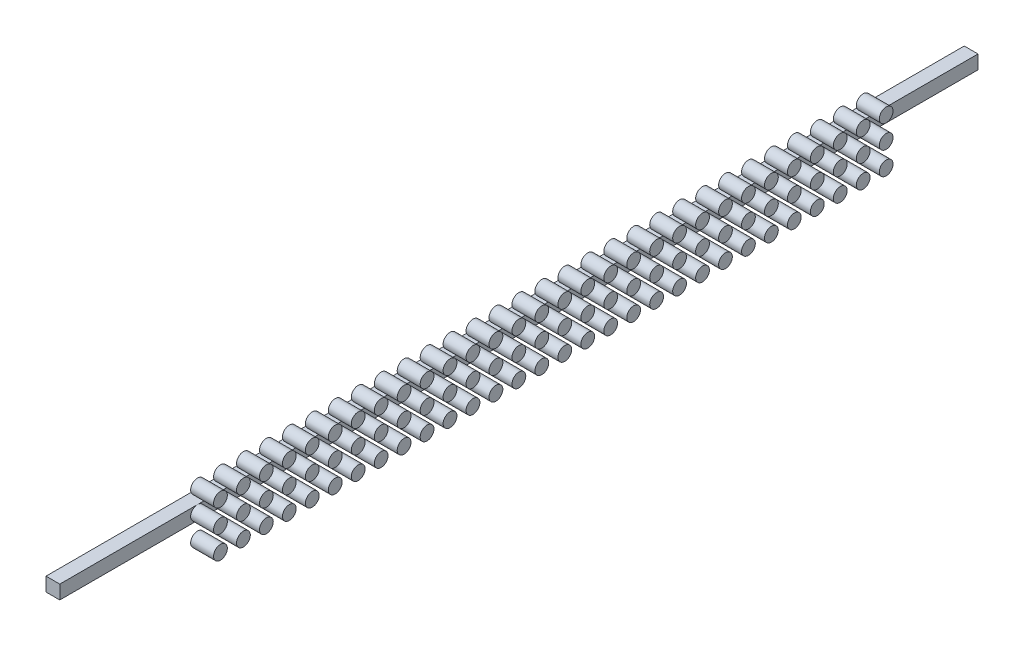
ISO-10303-21;
HEADER;
FILE_DESCRIPTION(('STEP AP214'),'2;1');
FILE_NAME('part.step','',(''),(''),'','','');
FILE_SCHEMA(('AUTOMOTIVE_DESIGN { 1 0 10303 214 1 1 1 1 }'));
ENDSEC;
DATA;
#1=APPLICATION_CONTEXT('core data for automotive mechanical design processes');
#2=APPLICATION_PROTOCOL_DEFINITION('international standard','automotive_design',2000,#1);
#3=PRODUCT_CONTEXT('',#1,'mechanical');
#4=PRODUCT('Part','Part','',(#3));
#5=PRODUCT_RELATED_PRODUCT_CATEGORY('part','',(#4));
#6=PRODUCT_DEFINITION_FORMATION('','',#4);
#7=PRODUCT_DEFINITION_CONTEXT('part definition',#1,'design');
#8=PRODUCT_DEFINITION('design','',#6,#7);
#9=PRODUCT_DEFINITION_SHAPE('','',#8);
#10=(LENGTH_UNIT() NAMED_UNIT(*) SI_UNIT(.MILLI.,.METRE.));
#11=(NAMED_UNIT(*) PLANE_ANGLE_UNIT() SI_UNIT($,.RADIAN.));
#12=(NAMED_UNIT(*) SI_UNIT($,.STERADIAN.) SOLID_ANGLE_UNIT());
#13=UNCERTAINTY_MEASURE_WITH_UNIT(LENGTH_MEASURE(1.E-05),#10,'distance_accuracy_value','');
#14=(GEOMETRIC_REPRESENTATION_CONTEXT(3) GLOBAL_UNCERTAINTY_ASSIGNED_CONTEXT((#13)) GLOBAL_UNIT_ASSIGNED_CONTEXT((#10,
#11,#12)) REPRESENTATION_CONTEXT('',''));
#15=CARTESIAN_POINT('',(0.,0.,0.));
#16=DIRECTION('',(0.,0.,1.));
#17=DIRECTION('',(1.,0.,0.));
#18=AXIS2_PLACEMENT_3D('',#15,#16,#17);
#19=CARTESIAN_POINT('',(650.,499.999999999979,8500.));
#20=DIRECTION('',(-1.,0.,0.));
#21=DIRECTION('',(0.,0.,1.));
#22=AXIS2_PLACEMENT_3D('',#19,#20,#21);
#23=CYLINDRICAL_SURFACE('',#22,150.);
#24=CARTESIAN_POINT('',(650.,499.999999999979,8500.));
#25=DIRECTION('',(1.,0.,0.));
#26=DIRECTION('',(0.,0.,-1.));
#27=AXIS2_PLACEMENT_3D('',#24,#25,#26);
#28=CIRCLE('',#27,150.);
#29=CARTESIAN_POINT('',(650.,499.999999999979,8350.));
#30=VERTEX_POINT('',#29);
#31=EDGE_CURVE('E57',#30,#30,#28,.T.);
#32=ORIENTED_EDGE('',*,*,#31,.F.);
#33=EDGE_LOOP('',(#32));
#34=FACE_BOUND('',#33,.T.);
#35=CARTESIAN_POINT('',(150.,499.999999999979,8500.));
#36=DIRECTION('',(1.,0.,0.));
#37=DIRECTION('',(0.,0.,-1.));
#38=AXIS2_PLACEMENT_3D('',#35,#36,#37);
#39=CIRCLE('',#38,150.);
#40=CARTESIAN_POINT('',(150.,499.999999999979,8350.));
#41=VERTEX_POINT('',#40);
#42=EDGE_CURVE('E11',#41,#41,#39,.T.);
#43=ORIENTED_EDGE('',*,*,#42,.T.);
#44=EDGE_LOOP('',(#43));
#45=FACE_BOUND('',#44,.T.);
#46=ADVANCED_FACE('F55',(#34,#45),#23,.T.);
#47=CARTESIAN_POINT('',(650.,499.999999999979,8500.));
#48=DIRECTION('',(1.,0.,0.));
#49=DIRECTION('',(0.,0.,-1.));
#50=AXIS2_PLACEMENT_3D('',#47,#48,#49);
#51=PLANE('',#50);
#52=ORIENTED_EDGE('',*,*,#31,.T.);
#53=EDGE_LOOP('',(#52));
#54=FACE_BOUND('',#53,.T.);
#55=ADVANCED_FACE('F53',(#54),#51,.T.);
#56=CARTESIAN_POINT('',(150.,499.999999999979,8500.));
#57=DIRECTION('',(1.,0.,0.));
#58=DIRECTION('',(0.,0.,-1.));
#59=AXIS2_PLACEMENT_3D('',#56,#57,#58);
#60=PLANE('',#59);
#61=ORIENTED_EDGE('',*,*,#42,.F.);
#62=EDGE_LOOP('',(#61));
#63=FACE_BOUND('',#62,.T.);
#64=ADVANCED_FACE('F72',(#63),#60,.F.);
#65=CLOSED_SHELL('',(#46,#55,#64));
#66=MANIFOLD_SOLID_BREP('B2',#65);
#67=CARTESIAN_POINT('',(650.,-500.000000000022,9000.));
#68=DIRECTION('',(-1.,0.,0.));
#69=DIRECTION('',(0.,0.,1.));
#70=AXIS2_PLACEMENT_3D('',#67,#68,#69);
#71=CYLINDRICAL_SURFACE('',#70,150.);
#72=CARTESIAN_POINT('',(650.,-500.000000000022,9000.));
#73=DIRECTION('',(1.,0.,0.));
#74=DIRECTION('',(0.,0.,-1.));
#75=AXIS2_PLACEMENT_3D('',#72,#73,#74);
#76=CIRCLE('',#75,150.);
#77=CARTESIAN_POINT('',(650.,-500.000000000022,8850.));
#78=VERTEX_POINT('',#77);
#79=EDGE_CURVE('E104',#78,#78,#76,.T.);
#80=ORIENTED_EDGE('',*,*,#79,.F.);
#81=EDGE_LOOP('',(#80));
#82=FACE_BOUND('',#81,.T.);
#83=CARTESIAN_POINT('',(150.,-500.000000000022,9000.));
#84=DIRECTION('',(1.,0.,0.));
#85=DIRECTION('',(0.,0.,-1.));
#86=AXIS2_PLACEMENT_3D('',#83,#84,#85);
#87=CIRCLE('',#86,150.);
#88=CARTESIAN_POINT('',(150.,-500.000000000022,8850.));
#89=VERTEX_POINT('',#88);
#90=EDGE_CURVE('E51',#89,#89,#87,.T.);
#91=ORIENTED_EDGE('',*,*,#90,.T.);
#92=EDGE_LOOP('',(#91));
#93=FACE_BOUND('',#92,.T.);
#94=ADVANCED_FACE('F101',(#82,#93),#71,.T.);
#95=CARTESIAN_POINT('',(650.,-500.000000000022,9000.));
#96=DIRECTION('',(1.,0.,0.));
#97=DIRECTION('',(0.,0.,-1.));
#98=AXIS2_PLACEMENT_3D('',#95,#96,#97);
#99=PLANE('',#98);
#100=ORIENTED_EDGE('',*,*,#79,.T.);
#101=EDGE_LOOP('',(#100));
#102=FACE_BOUND('',#101,.T.);
#103=ADVANCED_FACE('F103',(#102),#99,.T.);
#104=CARTESIAN_POINT('',(150.,-500.000000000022,9000.));
#105=DIRECTION('',(1.,0.,0.));
#106=DIRECTION('',(0.,0.,-1.));
#107=AXIS2_PLACEMENT_3D('',#104,#105,#106);
#108=PLANE('',#107);
#109=ORIENTED_EDGE('',*,*,#90,.F.);
#110=EDGE_LOOP('',(#109));
#111=FACE_BOUND('',#110,.T.);
#112=ADVANCED_FACE('F118',(#111),#108,.F.);
#113=CLOSED_SHELL('',(#94,#103,#112));
#114=MANIFOLD_SOLID_BREP('B6',#113);
#115=CARTESIAN_POINT('',(650.,-500.000000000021,8500.));
#116=DIRECTION('',(-1.,0.,0.));
#117=DIRECTION('',(0.,0.,1.));
#118=AXIS2_PLACEMENT_3D('',#115,#116,#117);
#119=CYLINDRICAL_SURFACE('',#118,150.);
#120=CARTESIAN_POINT('',(650.,-500.000000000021,8500.));
#121=DIRECTION('',(1.,0.,0.));
#122=DIRECTION('',(0.,0.,-1.));
#123=AXIS2_PLACEMENT_3D('',#120,#121,#122);
#124=CIRCLE('',#123,150.);
#125=CARTESIAN_POINT('',(650.,-500.000000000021,8350.));
#126=VERTEX_POINT('',#125);
#127=EDGE_CURVE('E152',#126,#126,#124,.T.);
#128=ORIENTED_EDGE('',*,*,#127,.F.);
#129=EDGE_LOOP('',(#128));
#130=FACE_BOUND('',#129,.T.);
#131=CARTESIAN_POINT('',(150.,-500.000000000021,8500.));
#132=DIRECTION('',(1.,0.,0.));
#133=DIRECTION('',(0.,0.,-1.));
#134=AXIS2_PLACEMENT_3D('',#131,#132,#133);
#135=CIRCLE('',#134,150.);
#136=CARTESIAN_POINT('',(150.,-500.000000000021,8350.));
#137=VERTEX_POINT('',#136);
#138=EDGE_CURVE('E99',#137,#137,#135,.T.);
#139=ORIENTED_EDGE('',*,*,#138,.T.);
#140=EDGE_LOOP('',(#139));
#141=FACE_BOUND('',#140,.T.);
#142=ADVANCED_FACE('F147',(#130,#141),#119,.T.);
#143=CARTESIAN_POINT('',(650.,-500.000000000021,8500.));
#144=DIRECTION('',(1.,0.,0.));
#145=DIRECTION('',(0.,0.,-1.));
#146=AXIS2_PLACEMENT_3D('',#143,#144,#145);
#147=PLANE('',#146);
#148=ORIENTED_EDGE('',*,*,#127,.T.);
#149=EDGE_LOOP('',(#148));
#150=FACE_BOUND('',#149,.T.);
#151=ADVANCED_FACE('F155',(#150),#147,.T.);
#152=CARTESIAN_POINT('',(150.,-500.000000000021,8500.));
#153=DIRECTION('',(1.,0.,0.));
#154=DIRECTION('',(0.,0.,-1.));
#155=AXIS2_PLACEMENT_3D('',#152,#153,#154);
#156=PLANE('',#155);
#157=ORIENTED_EDGE('',*,*,#138,.F.);
#158=EDGE_LOOP('',(#157));
#159=FACE_BOUND('',#158,.T.);
#160=ADVANCED_FACE('F166',(#159),#156,.F.);
#161=CLOSED_SHELL('',(#142,#151,#160));
#162=MANIFOLD_SOLID_BREP('B46',#161);
#163=CARTESIAN_POINT('',(650.,-500.000000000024,9500.));
#164=DIRECTION('',(-1.,0.,0.));
#165=DIRECTION('',(0.,0.,1.));
#166=AXIS2_PLACEMENT_3D('',#163,#164,#165);
#167=CYLINDRICAL_SURFACE('',#166,150.);
#168=CARTESIAN_POINT('',(650.,-500.000000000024,9500.));
#169=DIRECTION('',(1.,0.,0.));
#170=DIRECTION('',(0.,0.,-1.));
#171=AXIS2_PLACEMENT_3D('',#168,#169,#170);
#172=CIRCLE('',#171,150.);
#173=CARTESIAN_POINT('',(650.,-500.000000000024,9350.));
#174=VERTEX_POINT('',#173);
#175=EDGE_CURVE('E201',#174,#174,#172,.T.);
#176=ORIENTED_EDGE('',*,*,#175,.F.);
#177=EDGE_LOOP('',(#176));
#178=FACE_BOUND('',#177,.T.);
#179=CARTESIAN_POINT('',(150.,-500.000000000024,9500.));
#180=DIRECTION('',(1.,0.,0.));
#181=DIRECTION('',(0.,0.,-1.));
#182=AXIS2_PLACEMENT_3D('',#179,#180,#181);
#183=CIRCLE('',#182,150.);
#184=CARTESIAN_POINT('',(150.,-500.000000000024,9350.));
#185=VERTEX_POINT('',#184);
#186=EDGE_CURVE('E149',#185,#185,#183,.T.);
#187=ORIENTED_EDGE('',*,*,#186,.T.);
#188=EDGE_LOOP('',(#187));
#189=FACE_BOUND('',#188,.T.);
#190=ADVANCED_FACE('F200',(#178,#189),#167,.T.);
#191=CARTESIAN_POINT('',(650.,-500.000000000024,9500.));
#192=DIRECTION('',(1.,0.,0.));
#193=DIRECTION('',(0.,0.,-1.));
#194=AXIS2_PLACEMENT_3D('',#191,#192,#193);
#195=PLANE('',#194);
#196=ORIENTED_EDGE('',*,*,#175,.T.);
#197=EDGE_LOOP('',(#196));
#198=FACE_BOUND('',#197,.T.);
#199=ADVANCED_FACE('F203',(#198),#195,.T.);
#200=CARTESIAN_POINT('',(150.,-500.000000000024,9500.));
#201=DIRECTION('',(1.,0.,0.));
#202=DIRECTION('',(0.,0.,-1.));
#203=AXIS2_PLACEMENT_3D('',#200,#201,#202);
#204=PLANE('',#203);
#205=ORIENTED_EDGE('',*,*,#186,.F.);
#206=EDGE_LOOP('',(#205));
#207=FACE_BOUND('',#206,.T.);
#208=ADVANCED_FACE('F217',(#207),#204,.F.);
#209=CLOSED_SHELL('',(#190,#199,#208));
#210=MANIFOLD_SOLID_BREP('B92',#209);
#211=CARTESIAN_POINT('',(650.,499.999999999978,9000.));
#212=DIRECTION('',(-1.,0.,0.));
#213=DIRECTION('',(0.,0.,1.));
#214=AXIS2_PLACEMENT_3D('',#211,#212,#213);
#215=CYLINDRICAL_SURFACE('',#214,150.);
#216=CARTESIAN_POINT('',(650.,499.999999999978,9000.));
#217=DIRECTION('',(1.,0.,0.));
#218=DIRECTION('',(0.,0.,-1.));
#219=AXIS2_PLACEMENT_3D('',#216,#217,#218);
#220=CIRCLE('',#219,150.);
#221=CARTESIAN_POINT('',(650.,499.999999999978,8850.));
#222=VERTEX_POINT('',#221);
#223=EDGE_CURVE('E252',#222,#222,#220,.T.);
#224=ORIENTED_EDGE('',*,*,#223,.F.);
#225=EDGE_LOOP('',(#224));
#226=FACE_BOUND('',#225,.T.);
#227=CARTESIAN_POINT('',(150.,499.999999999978,9000.));
#228=DIRECTION('',(1.,0.,0.));
#229=DIRECTION('',(0.,0.,-1.));
#230=AXIS2_PLACEMENT_3D('',#227,#228,#229);
#231=CIRCLE('',#230,150.);
#232=CARTESIAN_POINT('',(150.,499.999999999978,8850.));
#233=VERTEX_POINT('',#232);
#234=EDGE_CURVE('E196',#233,#233,#231,.T.);
#235=ORIENTED_EDGE('',*,*,#234,.T.);
#236=EDGE_LOOP('',(#235));
#237=FACE_BOUND('',#236,.T.);
#238=ADVANCED_FACE('F249',(#226,#237),#215,.T.);
#239=CARTESIAN_POINT('',(650.,499.999999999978,9000.));
#240=DIRECTION('',(1.,0.,0.));
#241=DIRECTION('',(0.,0.,-1.));
#242=AXIS2_PLACEMENT_3D('',#239,#240,#241);
#243=PLANE('',#242);
#244=ORIENTED_EDGE('',*,*,#223,.T.);
#245=EDGE_LOOP('',(#244));
#246=FACE_BOUND('',#245,.T.);
#247=ADVANCED_FACE('F250',(#246),#243,.T.);
#248=CARTESIAN_POINT('',(150.,499.999999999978,9000.));
#249=DIRECTION('',(1.,0.,0.));
#250=DIRECTION('',(0.,0.,-1.));
#251=AXIS2_PLACEMENT_3D('',#248,#249,#250);
#252=PLANE('',#251);
#253=ORIENTED_EDGE('',*,*,#234,.F.);
#254=EDGE_LOOP('',(#253));
#255=FACE_BOUND('',#254,.T.);
#256=ADVANCED_FACE('F270',(#255),#252,.F.);
#257=CLOSED_SHELL('',(#238,#247,#256));
#258=MANIFOLD_SOLID_BREP('B145',#257);
#259=CARTESIAN_POINT('',(650.,-500.000000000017,7500.));
#260=DIRECTION('',(-1.,0.,0.));
#261=DIRECTION('',(0.,0.,1.));
#262=AXIS2_PLACEMENT_3D('',#259,#260,#261);
#263=CYLINDRICAL_SURFACE('',#262,150.);
#264=CARTESIAN_POINT('',(650.,-500.000000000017,7500.));
#265=DIRECTION('',(1.,0.,0.));
#266=DIRECTION('',(0.,0.,-1.));
#267=AXIS2_PLACEMENT_3D('',#264,#265,#266);
#268=CIRCLE('',#267,150.);
#269=CARTESIAN_POINT('',(650.,-500.000000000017,7350.));
#270=VERTEX_POINT('',#269);
#271=EDGE_CURVE('E301',#270,#270,#268,.T.);
#272=ORIENTED_EDGE('',*,*,#271,.F.);
#273=EDGE_LOOP('',(#272));
#274=FACE_BOUND('',#273,.T.);
#275=CARTESIAN_POINT('',(150.,-500.000000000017,7500.));
#276=DIRECTION('',(1.,0.,0.));
#277=DIRECTION('',(0.,0.,-1.));
#278=AXIS2_PLACEMENT_3D('',#275,#276,#277);
#279=CIRCLE('',#278,150.);
#280=CARTESIAN_POINT('',(150.,-500.000000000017,7350.));
#281=VERTEX_POINT('',#280);
#282=EDGE_CURVE('E247',#281,#281,#279,.T.);
#283=ORIENTED_EDGE('',*,*,#282,.T.);
#284=EDGE_LOOP('',(#283));
#285=FACE_BOUND('',#284,.T.);
#286=ADVANCED_FACE('F300',(#274,#285),#263,.T.);
#287=CARTESIAN_POINT('',(650.,-500.000000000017,7500.));
#288=DIRECTION('',(1.,0.,0.));
#289=DIRECTION('',(0.,0.,-1.));
#290=AXIS2_PLACEMENT_3D('',#287,#288,#289);
#291=PLANE('',#290);
#292=ORIENTED_EDGE('',*,*,#271,.T.);
#293=EDGE_LOOP('',(#292));
#294=FACE_BOUND('',#293,.T.);
#295=ADVANCED_FACE('F296',(#294),#291,.T.);
#296=CARTESIAN_POINT('',(150.,-500.000000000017,7500.));
#297=DIRECTION('',(1.,0.,0.));
#298=DIRECTION('',(0.,0.,-1.));
#299=AXIS2_PLACEMENT_3D('',#296,#297,#298);
#300=PLANE('',#299);
#301=ORIENTED_EDGE('',*,*,#282,.F.);
#302=EDGE_LOOP('',(#301));
#303=FACE_BOUND('',#302,.T.);
#304=ADVANCED_FACE('F316',(#303),#300,.F.);
#305=CLOSED_SHELL('',(#286,#295,#304));
#306=MANIFOLD_SOLID_BREP('B194',#305);
#307=CARTESIAN_POINT('',(650.,499.999999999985,7000.));
#308=DIRECTION('',(-1.,0.,0.));
#309=DIRECTION('',(0.,0.,1.));
#310=AXIS2_PLACEMENT_3D('',#307,#308,#309);
#311=CYLINDRICAL_SURFACE('',#310,150.);
#312=CARTESIAN_POINT('',(650.,499.999999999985,7000.));
#313=DIRECTION('',(1.,0.,0.));
#314=DIRECTION('',(0.,0.,-1.));
#315=AXIS2_PLACEMENT_3D('',#312,#313,#314);
#316=CIRCLE('',#315,150.);
#317=CARTESIAN_POINT('',(650.,499.999999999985,6850.));
#318=VERTEX_POINT('',#317);
#319=EDGE_CURVE('E348',#318,#318,#316,.T.);
#320=ORIENTED_EDGE('',*,*,#319,.F.);
#321=EDGE_LOOP('',(#320));
#322=FACE_BOUND('',#321,.T.);
#323=CARTESIAN_POINT('',(150.,499.999999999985,7000.));
#324=DIRECTION('',(1.,0.,0.));
#325=DIRECTION('',(0.,0.,-1.));
#326=AXIS2_PLACEMENT_3D('',#323,#324,#325);
#327=CIRCLE('',#326,150.);
#328=CARTESIAN_POINT('',(150.,499.999999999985,6850.));
#329=VERTEX_POINT('',#328);
#330=EDGE_CURVE('E297',#329,#329,#327,.T.);
#331=ORIENTED_EDGE('',*,*,#330,.T.);
#332=EDGE_LOOP('',(#331));
#333=FACE_BOUND('',#332,.T.);
#334=ADVANCED_FACE('F347',(#322,#333),#311,.T.);
#335=CARTESIAN_POINT('',(650.,499.999999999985,7000.));
#336=DIRECTION('',(1.,0.,0.));
#337=DIRECTION('',(0.,0.,-1.));
#338=AXIS2_PLACEMENT_3D('',#335,#336,#337);
#339=PLANE('',#338);
#340=ORIENTED_EDGE('',*,*,#319,.T.);
#341=EDGE_LOOP('',(#340));
#342=FACE_BOUND('',#341,.T.);
#343=ADVANCED_FACE('F346',(#342),#339,.T.);
#344=CARTESIAN_POINT('',(150.,499.999999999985,7000.));
#345=DIRECTION('',(1.,0.,0.));
#346=DIRECTION('',(0.,0.,-1.));
#347=AXIS2_PLACEMENT_3D('',#344,#345,#346);
#348=PLANE('',#347);
#349=ORIENTED_EDGE('',*,*,#330,.F.);
#350=EDGE_LOOP('',(#349));
#351=FACE_BOUND('',#350,.T.);
#352=ADVANCED_FACE('F364',(#351),#348,.F.);
#353=CLOSED_SHELL('',(#334,#343,#352));
#354=MANIFOLD_SOLID_BREP('B245',#353);
#355=CARTESIAN_POINT('',(650.,499.999999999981,8000.));
#356=DIRECTION('',(-1.,0.,0.));
#357=DIRECTION('',(0.,0.,1.));
#358=AXIS2_PLACEMENT_3D('',#355,#356,#357);
#359=CYLINDRICAL_SURFACE('',#358,150.);
#360=CARTESIAN_POINT('',(650.,499.999999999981,8000.));
#361=DIRECTION('',(1.,0.,0.));
#362=DIRECTION('',(0.,0.,-1.));
#363=AXIS2_PLACEMENT_3D('',#360,#361,#362);
#364=CIRCLE('',#363,150.);
#365=CARTESIAN_POINT('',(650.,499.999999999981,7850.));
#366=VERTEX_POINT('',#365);
#367=EDGE_CURVE('E398',#366,#366,#364,.T.);
#368=ORIENTED_EDGE('',*,*,#367,.F.);
#369=EDGE_LOOP('',(#368));
#370=FACE_BOUND('',#369,.T.);
#371=CARTESIAN_POINT('',(150.,499.999999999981,8000.));
#372=DIRECTION('',(1.,0.,0.));
#373=DIRECTION('',(0.,0.,-1.));
#374=AXIS2_PLACEMENT_3D('',#371,#372,#373);
#375=CIRCLE('',#374,150.);
#376=CARTESIAN_POINT('',(150.,499.999999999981,7850.));
#377=VERTEX_POINT('',#376);
#378=EDGE_CURVE('E345',#377,#377,#375,.T.);
#379=ORIENTED_EDGE('',*,*,#378,.T.);
#380=EDGE_LOOP('',(#379));
#381=FACE_BOUND('',#380,.T.);
#382=ADVANCED_FACE('F393',(#370,#381),#359,.T.);
#383=CARTESIAN_POINT('',(650.,499.999999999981,8000.));
#384=DIRECTION('',(1.,0.,0.));
#385=DIRECTION('',(0.,0.,-1.));
#386=AXIS2_PLACEMENT_3D('',#383,#384,#385);
#387=PLANE('',#386);
#388=ORIENTED_EDGE('',*,*,#367,.T.);
#389=EDGE_LOOP('',(#388));
#390=FACE_BOUND('',#389,.T.);
#391=ADVANCED_FACE('F397',(#390),#387,.T.);
#392=CARTESIAN_POINT('',(150.,499.999999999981,8000.));
#393=DIRECTION('',(1.,0.,0.));
#394=DIRECTION('',(0.,0.,-1.));
#395=AXIS2_PLACEMENT_3D('',#392,#393,#394);
#396=PLANE('',#395);
#397=ORIENTED_EDGE('',*,*,#378,.F.);
#398=EDGE_LOOP('',(#397));
#399=FACE_BOUND('',#398,.T.);
#400=ADVANCED_FACE('F413',(#399),#396,.F.);
#401=CLOSED_SHELL('',(#382,#391,#400));
#402=MANIFOLD_SOLID_BREP('B292',#401);
#403=CARTESIAN_POINT('',(650.,499.999999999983,7500.));
#404=DIRECTION('',(-1.,0.,0.));
#405=DIRECTION('',(0.,0.,1.));
#406=AXIS2_PLACEMENT_3D('',#403,#404,#405);
#407=CYLINDRICAL_SURFACE('',#406,150.);
#408=CARTESIAN_POINT('',(650.,499.999999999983,7500.));
#409=DIRECTION('',(1.,0.,0.));
#410=DIRECTION('',(0.,0.,-1.));
#411=AXIS2_PLACEMENT_3D('',#408,#409,#410);
#412=CIRCLE('',#411,150.);
#413=CARTESIAN_POINT('',(650.,499.999999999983,7350.));
#414=VERTEX_POINT('',#413);
#415=EDGE_CURVE('E449',#414,#414,#412,.T.);
#416=ORIENTED_EDGE('',*,*,#415,.F.);
#417=EDGE_LOOP('',(#416));
#418=FACE_BOUND('',#417,.T.);
#419=CARTESIAN_POINT('',(150.,499.999999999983,7500.));
#420=DIRECTION('',(1.,0.,0.));
#421=DIRECTION('',(0.,0.,-1.));
#422=AXIS2_PLACEMENT_3D('',#419,#420,#421);
#423=CIRCLE('',#422,150.);
#424=CARTESIAN_POINT('',(150.,499.999999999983,7350.));
#425=VERTEX_POINT('',#424);
#426=EDGE_CURVE('E391',#425,#425,#423,.T.);
#427=ORIENTED_EDGE('',*,*,#426,.T.);
#428=EDGE_LOOP('',(#427));
#429=FACE_BOUND('',#428,.T.);
#430=ADVANCED_FACE('F441',(#418,#429),#407,.T.);
#431=CARTESIAN_POINT('',(650.,499.999999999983,7500.));
#432=DIRECTION('',(1.,0.,0.));
#433=DIRECTION('',(0.,0.,-1.));
#434=AXIS2_PLACEMENT_3D('',#431,#432,#433);
#435=PLANE('',#434);
#436=ORIENTED_EDGE('',*,*,#415,.T.);
#437=EDGE_LOOP('',(#436));
#438=FACE_BOUND('',#437,.T.);
#439=ADVANCED_FACE('F447',(#438),#435,.T.);
#440=CARTESIAN_POINT('',(150.,499.999999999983,7500.));
#441=DIRECTION('',(1.,0.,0.));
#442=DIRECTION('',(0.,0.,-1.));
#443=AXIS2_PLACEMENT_3D('',#440,#441,#442);
#444=PLANE('',#443);
#445=ORIENTED_EDGE('',*,*,#426,.F.);
#446=EDGE_LOOP('',(#445));
#447=FACE_BOUND('',#446,.T.);
#448=ADVANCED_FACE('F464',(#447),#444,.F.);
#449=CLOSED_SHELL('',(#430,#439,#448));
#450=MANIFOLD_SOLID_BREP('B338',#449);
#451=CARTESIAN_POINT('',(650.,-500.000000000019,8000.));
#452=DIRECTION('',(-1.,0.,0.));
#453=DIRECTION('',(0.,0.,1.));
#454=AXIS2_PLACEMENT_3D('',#451,#452,#453);
#455=CYLINDRICAL_SURFACE('',#454,150.);
#456=CARTESIAN_POINT('',(650.,-500.000000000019,8000.));
#457=DIRECTION('',(1.,0.,0.));
#458=DIRECTION('',(0.,0.,-1.));
#459=AXIS2_PLACEMENT_3D('',#456,#457,#458);
#460=CIRCLE('',#459,150.);
#461=CARTESIAN_POINT('',(650.,-500.000000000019,7850.));
#462=VERTEX_POINT('',#461);
#463=EDGE_CURVE('E500',#462,#462,#460,.T.);
#464=ORIENTED_EDGE('',*,*,#463,.F.);
#465=EDGE_LOOP('',(#464));
#466=FACE_BOUND('',#465,.T.);
#467=CARTESIAN_POINT('',(150.,-500.000000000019,8000.));
#468=DIRECTION('',(1.,0.,0.));
#469=DIRECTION('',(0.,0.,-1.));
#470=AXIS2_PLACEMENT_3D('',#467,#468,#469);
#471=CIRCLE('',#470,150.);
#472=CARTESIAN_POINT('',(150.,-500.000000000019,7850.));
#473=VERTEX_POINT('',#472);
#474=EDGE_CURVE('E444',#473,#473,#471,.T.);
#475=ORIENTED_EDGE('',*,*,#474,.T.);
#476=EDGE_LOOP('',(#475));
#477=FACE_BOUND('',#476,.T.);
#478=ADVANCED_FACE('F492',(#466,#477),#455,.T.);
#479=CARTESIAN_POINT('',(650.,-500.000000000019,8000.));
#480=DIRECTION('',(1.,0.,0.));
#481=DIRECTION('',(0.,0.,-1.));
#482=AXIS2_PLACEMENT_3D('',#479,#480,#481);
#483=PLANE('',#482);
#484=ORIENTED_EDGE('',*,*,#463,.T.);
#485=EDGE_LOOP('',(#484));
#486=FACE_BOUND('',#485,.T.);
#487=ADVANCED_FACE('F494',(#486),#483,.T.);
#488=CARTESIAN_POINT('',(150.,-500.000000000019,8000.));
#489=DIRECTION('',(1.,0.,0.));
#490=DIRECTION('',(0.,0.,-1.));
#491=AXIS2_PLACEMENT_3D('',#488,#489,#490);
#492=PLANE('',#491);
#493=ORIENTED_EDGE('',*,*,#474,.F.);
#494=EDGE_LOOP('',(#493));
#495=FACE_BOUND('',#494,.T.);
#496=ADVANCED_FACE('F515',(#495),#492,.F.);
#497=CLOSED_SHELL('',(#478,#487,#496));
#498=MANIFOLD_SOLID_BREP('B386',#497);
#499=CARTESIAN_POINT('',(650.,-500.000000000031,11500.));
#500=DIRECTION('',(-1.,0.,0.));
#501=DIRECTION('',(0.,0.,1.));
#502=AXIS2_PLACEMENT_3D('',#499,#500,#501);
#503=CYLINDRICAL_SURFACE('',#502,150.);
#504=CARTESIAN_POINT('',(650.,-500.000000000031,11500.));
#505=DIRECTION('',(1.,0.,0.));
#506=DIRECTION('',(0.,0.,-1.));
#507=AXIS2_PLACEMENT_3D('',#504,#505,#506);
#508=CIRCLE('',#507,150.);
#509=CARTESIAN_POINT('',(650.,-500.000000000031,11350.));
#510=VERTEX_POINT('',#509);
#511=EDGE_CURVE('E546',#510,#510,#508,.T.);
#512=ORIENTED_EDGE('',*,*,#511,.F.);
#513=EDGE_LOOP('',(#512));
#514=FACE_BOUND('',#513,.T.);
#515=CARTESIAN_POINT('',(150.,-500.000000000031,11500.));
#516=DIRECTION('',(1.,0.,0.));
#517=DIRECTION('',(0.,0.,-1.));
#518=AXIS2_PLACEMENT_3D('',#515,#516,#517);
#519=CIRCLE('',#518,150.);
#520=CARTESIAN_POINT('',(150.,-500.000000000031,11350.));
#521=VERTEX_POINT('',#520);
#522=EDGE_CURVE('E495',#521,#521,#519,.T.);
#523=ORIENTED_EDGE('',*,*,#522,.T.);
#524=EDGE_LOOP('',(#523));
#525=FACE_BOUND('',#524,.T.);
#526=ADVANCED_FACE('F545',(#514,#525),#503,.T.);
#527=CARTESIAN_POINT('',(650.,-500.000000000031,11500.));
#528=DIRECTION('',(1.,0.,0.));
#529=DIRECTION('',(0.,0.,-1.));
#530=AXIS2_PLACEMENT_3D('',#527,#528,#529);
#531=PLANE('',#530);
#532=ORIENTED_EDGE('',*,*,#511,.T.);
#533=EDGE_LOOP('',(#532));
#534=FACE_BOUND('',#533,.T.);
#535=ADVANCED_FACE('F542',(#534),#531,.T.);
#536=CARTESIAN_POINT('',(150.,-500.000000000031,11500.));
#537=DIRECTION('',(1.,0.,0.));
#538=DIRECTION('',(0.,0.,-1.));
#539=AXIS2_PLACEMENT_3D('',#536,#537,#538);
#540=PLANE('',#539);
#541=ORIENTED_EDGE('',*,*,#522,.F.);
#542=EDGE_LOOP('',(#541));
#543=FACE_BOUND('',#542,.T.);
#544=ADVANCED_FACE('F561',(#543),#540,.F.);
#545=CLOSED_SHELL('',(#526,#535,#544));
#546=MANIFOLD_SOLID_BREP('B437',#545);
#547=CARTESIAN_POINT('',(650.,499.999999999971,11000.));
#548=DIRECTION('',(-1.,0.,0.));
#549=DIRECTION('',(0.,0.,1.));
#550=AXIS2_PLACEMENT_3D('',#547,#548,#549);
#551=CYLINDRICAL_SURFACE('',#550,150.);
#552=CARTESIAN_POINT('',(650.,499.999999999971,11000.));
#553=DIRECTION('',(1.,0.,0.));
#554=DIRECTION('',(0.,0.,-1.));
#555=AXIS2_PLACEMENT_3D('',#552,#553,#554);
#556=CIRCLE('',#555,150.);
#557=CARTESIAN_POINT('',(650.,499.999999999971,10850.));
#558=VERTEX_POINT('',#557);
#559=EDGE_CURVE('E594',#558,#558,#556,.T.);
#560=ORIENTED_EDGE('',*,*,#559,.F.);
#561=EDGE_LOOP('',(#560));
#562=FACE_BOUND('',#561,.T.);
#563=CARTESIAN_POINT('',(150.,499.999999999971,11000.));
#564=DIRECTION('',(1.,0.,0.));
#565=DIRECTION('',(0.,0.,-1.));
#566=AXIS2_PLACEMENT_3D('',#563,#564,#565);
#567=CIRCLE('',#566,150.);
#568=CARTESIAN_POINT('',(150.,499.999999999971,10850.));
#569=VERTEX_POINT('',#568);
#570=EDGE_CURVE('E541',#569,#569,#567,.T.);
#571=ORIENTED_EDGE('',*,*,#570,.T.);
#572=EDGE_LOOP('',(#571));
#573=FACE_BOUND('',#572,.T.);
#574=ADVANCED_FACE('F591',(#562,#573),#551,.T.);
#575=CARTESIAN_POINT('',(650.,499.999999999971,11000.));
#576=DIRECTION('',(1.,0.,0.));
#577=DIRECTION('',(0.,0.,-1.));
#578=AXIS2_PLACEMENT_3D('',#575,#576,#577);
#579=PLANE('',#578);
#580=ORIENTED_EDGE('',*,*,#559,.T.);
#581=EDGE_LOOP('',(#580));
#582=FACE_BOUND('',#581,.T.);
#583=ADVANCED_FACE('F593',(#582),#579,.T.);
#584=CARTESIAN_POINT('',(150.,499.999999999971,11000.));
#585=DIRECTION('',(1.,0.,0.));
#586=DIRECTION('',(0.,0.,-1.));
#587=AXIS2_PLACEMENT_3D('',#584,#585,#586);
#588=PLANE('',#587);
#589=ORIENTED_EDGE('',*,*,#570,.F.);
#590=EDGE_LOOP('',(#589));
#591=FACE_BOUND('',#590,.T.);
#592=ADVANCED_FACE('F608',(#591),#588,.F.);
#593=CLOSED_SHELL('',(#574,#583,#592));
#594=MANIFOLD_SOLID_BREP('B490',#593);
#595=CARTESIAN_POINT('',(650.,499.999999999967,12000.));
#596=DIRECTION('',(-1.,0.,0.));
#597=DIRECTION('',(0.,0.,1.));
#598=AXIS2_PLACEMENT_3D('',#595,#596,#597);
#599=CYLINDRICAL_SURFACE('',#598,150.);
#600=CARTESIAN_POINT('',(650.,499.999999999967,12000.));
#601=DIRECTION('',(1.,0.,0.));
#602=DIRECTION('',(0.,0.,-1.));
#603=AXIS2_PLACEMENT_3D('',#600,#601,#602);
#604=CIRCLE('',#603,150.);
#605=CARTESIAN_POINT('',(650.,499.999999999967,11850.));
#606=VERTEX_POINT('',#605);
#607=EDGE_CURVE('E644',#606,#606,#604,.T.);
#608=ORIENTED_EDGE('',*,*,#607,.F.);
#609=EDGE_LOOP('',(#608));
#610=FACE_BOUND('',#609,.T.);
#611=CARTESIAN_POINT('',(150.,499.999999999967,12000.));
#612=DIRECTION('',(1.,0.,0.));
#613=DIRECTION('',(0.,0.,-1.));
#614=AXIS2_PLACEMENT_3D('',#611,#612,#613);
#615=CIRCLE('',#614,150.);
#616=CARTESIAN_POINT('',(150.,499.999999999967,11850.));
#617=VERTEX_POINT('',#616);
#618=EDGE_CURVE('E587',#617,#617,#615,.T.);
#619=ORIENTED_EDGE('',*,*,#618,.T.);
#620=EDGE_LOOP('',(#619));
#621=FACE_BOUND('',#620,.T.);
#622=ADVANCED_FACE('F639',(#610,#621),#599,.T.);
#623=CARTESIAN_POINT('',(650.,499.999999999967,12000.));
#624=DIRECTION('',(1.,0.,0.));
#625=DIRECTION('',(0.,0.,-1.));
#626=AXIS2_PLACEMENT_3D('',#623,#624,#625);
#627=PLANE('',#626);
#628=ORIENTED_EDGE('',*,*,#607,.T.);
#629=EDGE_LOOP('',(#628));
#630=FACE_BOUND('',#629,.T.);
#631=ADVANCED_FACE('F645',(#630),#627,.T.);
#632=CARTESIAN_POINT('',(150.,499.999999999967,12000.));
#633=DIRECTION('',(1.,0.,0.));
#634=DIRECTION('',(0.,0.,-1.));
#635=AXIS2_PLACEMENT_3D('',#632,#633,#634);
#636=PLANE('',#635);
#637=ORIENTED_EDGE('',*,*,#618,.F.);
#638=EDGE_LOOP('',(#637));
#639=FACE_BOUND('',#638,.T.);
#640=ADVANCED_FACE('F658',(#639),#636,.F.);
#641=CLOSED_SHELL('',(#622,#631,#640));
#642=MANIFOLD_SOLID_BREP('B536',#641);
#643=CARTESIAN_POINT('',(650.,499.999999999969,11500.));
#644=DIRECTION('',(-1.,0.,0.));
#645=DIRECTION('',(0.,0.,1.));
#646=AXIS2_PLACEMENT_3D('',#643,#644,#645);
#647=CYLINDRICAL_SURFACE('',#646,150.);
#648=CARTESIAN_POINT('',(650.,499.999999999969,11500.));
#649=DIRECTION('',(1.,0.,0.));
#650=DIRECTION('',(0.,0.,-1.));
#651=AXIS2_PLACEMENT_3D('',#648,#649,#650);
#652=CIRCLE('',#651,150.);
#653=CARTESIAN_POINT('',(650.,499.999999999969,11350.));
#654=VERTEX_POINT('',#653);
#655=EDGE_CURVE('E691',#654,#654,#652,.T.);
#656=ORIENTED_EDGE('',*,*,#655,.F.);
#657=EDGE_LOOP('',(#656));
#658=FACE_BOUND('',#657,.T.);
#659=CARTESIAN_POINT('',(150.,499.999999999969,11500.));
#660=DIRECTION('',(1.,0.,0.));
#661=DIRECTION('',(0.,0.,-1.));
#662=AXIS2_PLACEMENT_3D('',#659,#660,#661);
#663=CIRCLE('',#662,150.);
#664=CARTESIAN_POINT('',(150.,499.999999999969,11350.));
#665=VERTEX_POINT('',#664);
#666=EDGE_CURVE('E640',#665,#665,#663,.T.);
#667=ORIENTED_EDGE('',*,*,#666,.T.);
#668=EDGE_LOOP('',(#667));
#669=FACE_BOUND('',#668,.T.);
#670=ADVANCED_FACE('F688',(#658,#669),#647,.T.);
#671=CARTESIAN_POINT('',(650.,499.999999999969,11500.));
#672=DIRECTION('',(1.,0.,0.));
#673=DIRECTION('',(0.,0.,-1.));
#674=AXIS2_PLACEMENT_3D('',#671,#672,#673);
#675=PLANE('',#674);
#676=ORIENTED_EDGE('',*,*,#655,.T.);
#677=EDGE_LOOP('',(#676));
#678=FACE_BOUND('',#677,.T.);
#679=ADVANCED_FACE('F693',(#678),#675,.T.);
#680=CARTESIAN_POINT('',(150.,499.999999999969,11500.));
#681=DIRECTION('',(1.,0.,0.));
#682=DIRECTION('',(0.,0.,-1.));
#683=AXIS2_PLACEMENT_3D('',#680,#681,#682);
#684=PLANE('',#683);
#685=ORIENTED_EDGE('',*,*,#666,.F.);
#686=EDGE_LOOP('',(#685));
#687=FACE_BOUND('',#686,.T.);
#688=ADVANCED_FACE('F708',(#687),#684,.F.);
#689=CLOSED_SHELL('',(#670,#679,#688));
#690=MANIFOLD_SOLID_BREP('B584',#689);
#691=CARTESIAN_POINT('',(650.,-500.000000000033,12000.));
#692=DIRECTION('',(-1.,0.,0.));
#693=DIRECTION('',(0.,0.,1.));
#694=AXIS2_PLACEMENT_3D('',#691,#692,#693);
#695=CYLINDRICAL_SURFACE('',#694,150.);
#696=CARTESIAN_POINT('',(650.,-500.000000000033,12000.));
#697=DIRECTION('',(1.,0.,0.));
#698=DIRECTION('',(0.,0.,-1.));
#699=AXIS2_PLACEMENT_3D('',#696,#697,#698);
#700=CIRCLE('',#699,150.);
#701=CARTESIAN_POINT('',(650.,-500.000000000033,11850.));
#702=VERTEX_POINT('',#701);
#703=EDGE_CURVE('E742',#702,#702,#700,.T.);
#704=ORIENTED_EDGE('',*,*,#703,.F.);
#705=EDGE_LOOP('',(#704));
#706=FACE_BOUND('',#705,.T.);
#707=CARTESIAN_POINT('',(150.,-500.000000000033,12000.));
#708=DIRECTION('',(1.,0.,0.));
#709=DIRECTION('',(0.,0.,-1.));
#710=AXIS2_PLACEMENT_3D('',#707,#708,#709);
#711=CIRCLE('',#710,150.);
#712=CARTESIAN_POINT('',(150.,-500.000000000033,11850.));
#713=VERTEX_POINT('',#712);
#714=EDGE_CURVE('E689',#713,#713,#711,.T.);
#715=ORIENTED_EDGE('',*,*,#714,.T.);
#716=EDGE_LOOP('',(#715));
#717=FACE_BOUND('',#716,.T.);
#718=ADVANCED_FACE('F739',(#706,#717),#695,.T.);
#719=CARTESIAN_POINT('',(650.,-500.000000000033,12000.));
#720=DIRECTION('',(1.,0.,0.));
#721=DIRECTION('',(0.,0.,-1.));
#722=AXIS2_PLACEMENT_3D('',#719,#720,#721);
#723=PLANE('',#722);
#724=ORIENTED_EDGE('',*,*,#703,.T.);
#725=EDGE_LOOP('',(#724));
#726=FACE_BOUND('',#725,.T.);
#727=ADVANCED_FACE('F738',(#726),#723,.T.);
#728=CARTESIAN_POINT('',(150.,-500.000000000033,12000.));
#729=DIRECTION('',(1.,0.,0.));
#730=DIRECTION('',(0.,0.,-1.));
#731=AXIS2_PLACEMENT_3D('',#728,#729,#730);
#732=PLANE('',#731);
#733=ORIENTED_EDGE('',*,*,#714,.F.);
#734=EDGE_LOOP('',(#733));
#735=FACE_BOUND('',#734,.T.);
#736=ADVANCED_FACE('F760',(#735),#732,.F.);
#737=CLOSED_SHELL('',(#718,#727,#736));
#738=MANIFOLD_SOLID_BREP('B633',#737);
#739=CARTESIAN_POINT('',(650.,499.999999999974,10000.));
#740=DIRECTION('',(-1.,0.,0.));
#741=DIRECTION('',(0.,0.,1.));
#742=AXIS2_PLACEMENT_3D('',#739,#740,#741);
#743=CYLINDRICAL_SURFACE('',#742,150.);
#744=CARTESIAN_POINT('',(650.,499.999999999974,10000.));
#745=DIRECTION('',(1.,0.,0.));
#746=DIRECTION('',(0.,0.,-1.));
#747=AXIS2_PLACEMENT_3D('',#744,#745,#746);
#748=CIRCLE('',#747,150.);
#749=CARTESIAN_POINT('',(650.,499.999999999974,9850.));
#750=VERTEX_POINT('',#749);
#751=EDGE_CURVE('E792',#750,#750,#748,.T.);
#752=ORIENTED_EDGE('',*,*,#751,.F.);
#753=EDGE_LOOP('',(#752));
#754=FACE_BOUND('',#753,.T.);
#755=CARTESIAN_POINT('',(150.,499.999999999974,10000.));
#756=DIRECTION('',(1.,0.,0.));
#757=DIRECTION('',(0.,0.,-1.));
#758=AXIS2_PLACEMENT_3D('',#755,#756,#757);
#759=CIRCLE('',#758,150.);
#760=CARTESIAN_POINT('',(150.,499.999999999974,9850.));
#761=VERTEX_POINT('',#760);
#762=EDGE_CURVE('E740',#761,#761,#759,.T.);
#763=ORIENTED_EDGE('',*,*,#762,.T.);
#764=EDGE_LOOP('',(#763));
#765=FACE_BOUND('',#764,.T.);
#766=ADVANCED_FACE('F790',(#754,#765),#743,.T.);
#767=CARTESIAN_POINT('',(650.,499.999999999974,10000.));
#768=DIRECTION('',(1.,0.,0.));
#769=DIRECTION('',(0.,0.,-1.));
#770=AXIS2_PLACEMENT_3D('',#767,#768,#769);
#771=PLANE('',#770);
#772=ORIENTED_EDGE('',*,*,#751,.T.);
#773=EDGE_LOOP('',(#772));
#774=FACE_BOUND('',#773,.T.);
#775=ADVANCED_FACE('F789',(#774),#771,.T.);
#776=CARTESIAN_POINT('',(150.,499.999999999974,10000.));
#777=DIRECTION('',(1.,0.,0.));
#778=DIRECTION('',(0.,0.,-1.));
#779=AXIS2_PLACEMENT_3D('',#776,#777,#778);
#780=PLANE('',#779);
#781=ORIENTED_EDGE('',*,*,#762,.F.);
#782=EDGE_LOOP('',(#781));
#783=FACE_BOUND('',#782,.T.);
#784=ADVANCED_FACE('F808',(#783),#780,.F.);
#785=CLOSED_SHELL('',(#766,#775,#784));
#786=MANIFOLD_SOLID_BREP('B684',#785);
#787=CARTESIAN_POINT('',(650.,499.999999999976,9500.));
#788=DIRECTION('',(-1.,0.,0.));
#789=DIRECTION('',(0.,0.,1.));
#790=AXIS2_PLACEMENT_3D('',#787,#788,#789);
#791=CYLINDRICAL_SURFACE('',#790,150.);
#792=CARTESIAN_POINT('',(650.,499.999999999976,9500.));
#793=DIRECTION('',(1.,0.,0.));
#794=DIRECTION('',(0.,0.,-1.));
#795=AXIS2_PLACEMENT_3D('',#792,#793,#794);
#796=CIRCLE('',#795,150.);
#797=CARTESIAN_POINT('',(650.,499.999999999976,9350.));
#798=VERTEX_POINT('',#797);
#799=EDGE_CURVE('E840',#798,#798,#796,.T.);
#800=ORIENTED_EDGE('',*,*,#799,.F.);
#801=EDGE_LOOP('',(#800));
#802=FACE_BOUND('',#801,.T.);
#803=CARTESIAN_POINT('',(150.,499.999999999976,9500.));
#804=DIRECTION('',(1.,0.,0.));
#805=DIRECTION('',(0.,0.,-1.));
#806=AXIS2_PLACEMENT_3D('',#803,#804,#805);
#807=CIRCLE('',#806,150.);
#808=CARTESIAN_POINT('',(150.,499.999999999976,9350.));
#809=VERTEX_POINT('',#808);
#810=EDGE_CURVE('E787',#809,#809,#807,.T.);
#811=ORIENTED_EDGE('',*,*,#810,.T.);
#812=EDGE_LOOP('',(#811));
#813=FACE_BOUND('',#812,.T.);
#814=ADVANCED_FACE('F836',(#802,#813),#791,.T.);
#815=CARTESIAN_POINT('',(650.,499.999999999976,9500.));
#816=DIRECTION('',(1.,0.,0.));
#817=DIRECTION('',(0.,0.,-1.));
#818=AXIS2_PLACEMENT_3D('',#815,#816,#817);
#819=PLANE('',#818);
#820=ORIENTED_EDGE('',*,*,#799,.T.);
#821=EDGE_LOOP('',(#820));
#822=FACE_BOUND('',#821,.T.);
#823=ADVANCED_FACE('F839',(#822),#819,.T.);
#824=CARTESIAN_POINT('',(150.,499.999999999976,9500.));
#825=DIRECTION('',(1.,0.,0.));
#826=DIRECTION('',(0.,0.,-1.));
#827=AXIS2_PLACEMENT_3D('',#824,#825,#826);
#828=PLANE('',#827);
#829=ORIENTED_EDGE('',*,*,#810,.F.);
#830=EDGE_LOOP('',(#829));
#831=FACE_BOUND('',#830,.T.);
#832=ADVANCED_FACE('F855',(#831),#828,.F.);
#833=CLOSED_SHELL('',(#814,#823,#832));
#834=MANIFOLD_SOLID_BREP('B735',#833);
#835=CARTESIAN_POINT('',(650.,-500.000000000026,10000.));
#836=DIRECTION('',(-1.,0.,0.));
#837=DIRECTION('',(0.,0.,1.));
#838=AXIS2_PLACEMENT_3D('',#835,#836,#837);
#839=CYLINDRICAL_SURFACE('',#838,150.);
#840=CARTESIAN_POINT('',(650.,-500.000000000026,10000.));
#841=DIRECTION('',(1.,0.,0.));
#842=DIRECTION('',(0.,0.,-1.));
#843=AXIS2_PLACEMENT_3D('',#840,#841,#842);
#844=CIRCLE('',#843,150.);
#845=CARTESIAN_POINT('',(650.,-500.000000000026,9850.));
#846=VERTEX_POINT('',#845);
#847=EDGE_CURVE('E886',#846,#846,#844,.T.);
#848=ORIENTED_EDGE('',*,*,#847,.F.);
#849=EDGE_LOOP('',(#848));
#850=FACE_BOUND('',#849,.T.);
#851=CARTESIAN_POINT('',(150.,-500.000000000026,10000.));
#852=DIRECTION('',(1.,0.,0.));
#853=DIRECTION('',(0.,0.,-1.));
#854=AXIS2_PLACEMENT_3D('',#851,#852,#853);
#855=CIRCLE('',#854,150.);
#856=CARTESIAN_POINT('',(150.,-500.000000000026,9850.));
#857=VERTEX_POINT('',#856);
#858=EDGE_CURVE('E833',#857,#857,#855,.T.);
#859=ORIENTED_EDGE('',*,*,#858,.T.);
#860=EDGE_LOOP('',(#859));
#861=FACE_BOUND('',#860,.T.);
#862=ADVANCED_FACE('F883',(#850,#861),#839,.T.);
#863=CARTESIAN_POINT('',(650.,-500.000000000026,10000.));
#864=DIRECTION('',(1.,0.,0.));
#865=DIRECTION('',(0.,0.,-1.));
#866=AXIS2_PLACEMENT_3D('',#863,#864,#865);
#867=PLANE('',#866);
#868=ORIENTED_EDGE('',*,*,#847,.T.);
#869=EDGE_LOOP('',(#868));
#870=FACE_BOUND('',#869,.T.);
#871=ADVANCED_FACE('F890',(#870),#867,.T.);
#872=CARTESIAN_POINT('',(150.,-500.000000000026,10000.));
#873=DIRECTION('',(1.,0.,0.));
#874=DIRECTION('',(0.,0.,-1.));
#875=AXIS2_PLACEMENT_3D('',#872,#873,#874);
#876=PLANE('',#875);
#877=ORIENTED_EDGE('',*,*,#858,.F.);
#878=EDGE_LOOP('',(#877));
#879=FACE_BOUND('',#878,.T.);
#880=ADVANCED_FACE('F901',(#879),#876,.F.);
#881=CLOSED_SHELL('',(#862,#871,#880));
#882=MANIFOLD_SOLID_BREP('B781',#881);
#883=CARTESIAN_POINT('',(650.,499.999999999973,10500.));
#884=DIRECTION('',(-1.,0.,0.));
#885=DIRECTION('',(0.,0.,1.));
#886=AXIS2_PLACEMENT_3D('',#883,#884,#885);
#887=CYLINDRICAL_SURFACE('',#886,150.);
#888=CARTESIAN_POINT('',(650.,499.999999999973,10500.));
#889=DIRECTION('',(1.,0.,0.));
#890=DIRECTION('',(0.,0.,-1.));
#891=AXIS2_PLACEMENT_3D('',#888,#889,#890);
#892=CIRCLE('',#891,150.);
#893=CARTESIAN_POINT('',(650.,499.999999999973,10350.));
#894=VERTEX_POINT('',#893);
#895=EDGE_CURVE('E939',#894,#894,#892,.T.);
#896=ORIENTED_EDGE('',*,*,#895,.F.);
#897=EDGE_LOOP('',(#896));
#898=FACE_BOUND('',#897,.T.);
#899=CARTESIAN_POINT('',(150.,499.999999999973,10500.));
#900=DIRECTION('',(1.,0.,0.));
#901=DIRECTION('',(0.,0.,-1.));
#902=AXIS2_PLACEMENT_3D('',#899,#900,#901);
#903=CIRCLE('',#902,150.);
#904=CARTESIAN_POINT('',(150.,499.999999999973,10350.));
#905=VERTEX_POINT('',#904);
#906=EDGE_CURVE('E881',#905,#905,#903,.T.);
#907=ORIENTED_EDGE('',*,*,#906,.T.);
#908=EDGE_LOOP('',(#907));
#909=FACE_BOUND('',#908,.T.);
#910=ADVANCED_FACE('F933',(#898,#909),#887,.T.);
#911=CARTESIAN_POINT('',(650.,499.999999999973,10500.));
#912=DIRECTION('',(1.,0.,0.));
#913=DIRECTION('',(0.,0.,-1.));
#914=AXIS2_PLACEMENT_3D('',#911,#912,#913);
#915=PLANE('',#914);
#916=ORIENTED_EDGE('',*,*,#895,.T.);
#917=EDGE_LOOP('',(#916));
#918=FACE_BOUND('',#917,.T.);
#919=ADVANCED_FACE('F937',(#918),#915,.T.);
#920=CARTESIAN_POINT('',(150.,499.999999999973,10500.));
#921=DIRECTION('',(1.,0.,0.));
#922=DIRECTION('',(0.,0.,-1.));
#923=AXIS2_PLACEMENT_3D('',#920,#921,#922);
#924=PLANE('',#923);
#925=ORIENTED_EDGE('',*,*,#906,.F.);
#926=EDGE_LOOP('',(#925));
#927=FACE_BOUND('',#926,.T.);
#928=ADVANCED_FACE('F951',(#927),#924,.F.);
#929=CLOSED_SHELL('',(#910,#919,#928));
#930=MANIFOLD_SOLID_BREP('B828',#929);
#931=CARTESIAN_POINT('',(650.,-500.000000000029,11000.));
#932=DIRECTION('',(-1.,0.,0.));
#933=DIRECTION('',(0.,0.,1.));
#934=AXIS2_PLACEMENT_3D('',#931,#932,#933);
#935=CYLINDRICAL_SURFACE('',#934,150.);
#936=CARTESIAN_POINT('',(650.,-500.000000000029,11000.));
#937=DIRECTION('',(1.,0.,0.));
#938=DIRECTION('',(0.,0.,-1.));
#939=AXIS2_PLACEMENT_3D('',#936,#937,#938);
#940=CIRCLE('',#939,150.);
#941=CARTESIAN_POINT('',(650.,-500.000000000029,10850.));
#942=VERTEX_POINT('',#941);
#943=EDGE_CURVE('E990',#942,#942,#940,.T.);
#944=ORIENTED_EDGE('',*,*,#943,.F.);
#945=EDGE_LOOP('',(#944));
#946=FACE_BOUND('',#945,.T.);
#947=CARTESIAN_POINT('',(150.,-500.000000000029,11000.));
#948=DIRECTION('',(1.,0.,0.));
#949=DIRECTION('',(0.,0.,-1.));
#950=AXIS2_PLACEMENT_3D('',#947,#948,#949);
#951=CIRCLE('',#950,150.);
#952=CARTESIAN_POINT('',(150.,-500.000000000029,10850.));
#953=VERTEX_POINT('',#952);
#954=EDGE_CURVE('E932',#953,#953,#951,.T.);
#955=ORIENTED_EDGE('',*,*,#954,.T.);
#956=EDGE_LOOP('',(#955));
#957=FACE_BOUND('',#956,.T.);
#958=ADVANCED_FACE('F983',(#946,#957),#935,.T.);
#959=CARTESIAN_POINT('',(650.,-500.000000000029,11000.));
#960=DIRECTION('',(1.,0.,0.));
#961=DIRECTION('',(0.,0.,-1.));
#962=AXIS2_PLACEMENT_3D('',#959,#960,#961);
#963=PLANE('',#962);
#964=ORIENTED_EDGE('',*,*,#943,.T.);
#965=EDGE_LOOP('',(#964));
#966=FACE_BOUND('',#965,.T.);
#967=ADVANCED_FACE('F984',(#966),#963,.T.);
#968=CARTESIAN_POINT('',(150.,-500.000000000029,11000.));
#969=DIRECTION('',(1.,0.,0.));
#970=DIRECTION('',(0.,0.,-1.));
#971=AXIS2_PLACEMENT_3D('',#968,#969,#970);
#972=PLANE('',#971);
#973=ORIENTED_EDGE('',*,*,#954,.F.);
#974=EDGE_LOOP('',(#973));
#975=FACE_BOUND('',#974,.T.);
#976=ADVANCED_FACE('F1002',(#975),#972,.F.);
#977=CLOSED_SHELL('',(#958,#967,#976));
#978=MANIFOLD_SOLID_BREP('B878',#977);
#979=CARTESIAN_POINT('',(650.,-500.000000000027,10500.));
#980=DIRECTION('',(-1.,0.,0.));
#981=DIRECTION('',(0.,0.,1.));
#982=AXIS2_PLACEMENT_3D('',#979,#980,#981);
#983=CYLINDRICAL_SURFACE('',#982,150.);
#984=CARTESIAN_POINT('',(650.,-500.000000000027,10500.));
#985=DIRECTION('',(1.,0.,0.));
#986=DIRECTION('',(0.,0.,-1.));
#987=AXIS2_PLACEMENT_3D('',#984,#985,#986);
#988=CIRCLE('',#987,150.);
#989=CARTESIAN_POINT('',(650.,-500.000000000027,10350.));
#990=VERTEX_POINT('',#989);
#991=EDGE_CURVE('E1036',#990,#990,#988,.T.);
#992=ORIENTED_EDGE('',*,*,#991,.F.);
#993=EDGE_LOOP('',(#992));
#994=FACE_BOUND('',#993,.T.);
#995=CARTESIAN_POINT('',(150.,-500.000000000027,10500.));
#996=DIRECTION('',(1.,0.,0.));
#997=DIRECTION('',(0.,0.,-1.));
#998=AXIS2_PLACEMENT_3D('',#995,#996,#997);
#999=CIRCLE('',#998,150.);
#1000=CARTESIAN_POINT('',(150.,-500.000000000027,10350.));
#1001=VERTEX_POINT('',#1000);
#1002=EDGE_CURVE('E985',#1001,#1001,#999,.T.);
#1003=ORIENTED_EDGE('',*,*,#1002,.T.);
#1004=EDGE_LOOP('',(#1003));
#1005=FACE_BOUND('',#1004,.T.);
#1006=ADVANCED_FACE('F1035',(#994,#1005),#983,.T.);
#1007=CARTESIAN_POINT('',(650.,-500.000000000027,10500.));
#1008=DIRECTION('',(1.,0.,0.));
#1009=DIRECTION('',(0.,0.,-1.));
#1010=AXIS2_PLACEMENT_3D('',#1007,#1008,#1009);
#1011=PLANE('',#1010);
#1012=ORIENTED_EDGE('',*,*,#991,.T.);
#1013=EDGE_LOOP('',(#1012));
#1014=FACE_BOUND('',#1013,.T.);
#1015=ADVANCED_FACE('F1032',(#1014),#1011,.T.);
#1016=CARTESIAN_POINT('',(150.,-500.000000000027,10500.));
#1017=DIRECTION('',(1.,0.,0.));
#1018=DIRECTION('',(0.,0.,-1.));
#1019=AXIS2_PLACEMENT_3D('',#1016,#1017,#1018);
#1020=PLANE('',#1019);
#1021=ORIENTED_EDGE('',*,*,#1002,.F.);
#1022=EDGE_LOOP('',(#1021));
#1023=FACE_BOUND('',#1022,.T.);
#1024=ADVANCED_FACE('F1052',(#1023),#1020,.F.);
#1025=CLOSED_SHELL('',(#1006,#1015,#1024));
#1026=MANIFOLD_SOLID_BREP('B928',#1025);
#1027=CARTESIAN_POINT('',(650.,-500.000000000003,3500.));
#1028=DIRECTION('',(-1.,0.,0.));
#1029=DIRECTION('',(0.,0.,1.));
#1030=AXIS2_PLACEMENT_3D('',#1027,#1028,#1029);
#1031=CYLINDRICAL_SURFACE('',#1030,150.);
#1032=CARTESIAN_POINT('',(650.,-500.000000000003,3500.));
#1033=DIRECTION('',(1.,0.,0.));
#1034=DIRECTION('',(0.,0.,-1.));
#1035=AXIS2_PLACEMENT_3D('',#1032,#1033,#1034);
#1036=CIRCLE('',#1035,150.);
#1037=CARTESIAN_POINT('',(650.,-500.000000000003,3350.));
#1038=VERTEX_POINT('',#1037);
#1039=EDGE_CURVE('E1082',#1038,#1038,#1036,.T.);
#1040=ORIENTED_EDGE('',*,*,#1039,.F.);
#1041=EDGE_LOOP('',(#1040));
#1042=FACE_BOUND('',#1041,.T.);
#1043=CARTESIAN_POINT('',(150.,-500.000000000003,3500.));
#1044=DIRECTION('',(1.,0.,0.));
#1045=DIRECTION('',(0.,0.,-1.));
#1046=AXIS2_PLACEMENT_3D('',#1043,#1044,#1045);
#1047=CIRCLE('',#1046,150.);
#1048=CARTESIAN_POINT('',(150.,-500.000000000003,3350.));
#1049=VERTEX_POINT('',#1048);
#1050=EDGE_CURVE('E1031',#1049,#1049,#1047,.T.);
#1051=ORIENTED_EDGE('',*,*,#1050,.T.);
#1052=EDGE_LOOP('',(#1051));
#1053=FACE_BOUND('',#1052,.T.);
#1054=ADVANCED_FACE('F1083',(#1042,#1053),#1031,.T.);
#1055=CARTESIAN_POINT('',(650.,-500.000000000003,3500.));
#1056=DIRECTION('',(1.,0.,0.));
#1057=DIRECTION('',(0.,0.,-1.));
#1058=AXIS2_PLACEMENT_3D('',#1055,#1056,#1057);
#1059=PLANE('',#1058);
#1060=ORIENTED_EDGE('',*,*,#1039,.T.);
#1061=EDGE_LOOP('',(#1060));
#1062=FACE_BOUND('',#1061,.T.);
#1063=ADVANCED_FACE('F1081',(#1062),#1059,.T.);
#1064=CARTESIAN_POINT('',(150.,-500.000000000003,3500.));
#1065=DIRECTION('',(1.,0.,0.));
#1066=DIRECTION('',(0.,0.,-1.));
#1067=AXIS2_PLACEMENT_3D('',#1064,#1065,#1066);
#1068=PLANE('',#1067);
#1069=ORIENTED_EDGE('',*,*,#1050,.F.);
#1070=EDGE_LOOP('',(#1069));
#1071=FACE_BOUND('',#1070,.T.);
#1072=ADVANCED_FACE('F1099',(#1071),#1068,.F.);
#1073=CLOSED_SHELL('',(#1054,#1063,#1072));
#1074=MANIFOLD_SOLID_BREP('B980',#1073);
#1075=CARTESIAN_POINT('',(650.,499.999999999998,3000.));
#1076=DIRECTION('',(-1.,0.,0.));
#1077=DIRECTION('',(0.,0.,1.));
#1078=AXIS2_PLACEMENT_3D('',#1075,#1076,#1077);
#1079=CYLINDRICAL_SURFACE('',#1078,150.);
#1080=CARTESIAN_POINT('',(650.,499.999999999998,3000.));
#1081=DIRECTION('',(1.,0.,0.));
#1082=DIRECTION('',(0.,0.,-1.));
#1083=AXIS2_PLACEMENT_3D('',#1080,#1081,#1082);
#1084=CIRCLE('',#1083,150.);
#1085=CARTESIAN_POINT('',(650.,499.999999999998,2850.));
#1086=VERTEX_POINT('',#1085);
#1087=EDGE_CURVE('E1135',#1086,#1086,#1084,.T.);
#1088=ORIENTED_EDGE('',*,*,#1087,.F.);
#1089=EDGE_LOOP('',(#1088));
#1090=FACE_BOUND('',#1089,.T.);
#1091=CARTESIAN_POINT('',(150.,499.999999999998,3000.));
#1092=DIRECTION('',(1.,0.,0.));
#1093=DIRECTION('',(0.,0.,-1.));
#1094=AXIS2_PLACEMENT_3D('',#1091,#1092,#1093);
#1095=CIRCLE('',#1094,150.);
#1096=CARTESIAN_POINT('',(150.,499.999999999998,2850.));
#1097=VERTEX_POINT('',#1096);
#1098=EDGE_CURVE('E1079',#1097,#1097,#1095,.T.);
#1099=ORIENTED_EDGE('',*,*,#1098,.T.);
#1100=EDGE_LOOP('',(#1099));
#1101=FACE_BOUND('',#1100,.T.);
#1102=ADVANCED_FACE('F1130',(#1090,#1101),#1079,.T.);
#1103=CARTESIAN_POINT('',(650.,499.999999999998,3000.));
#1104=DIRECTION('',(1.,0.,0.));
#1105=DIRECTION('',(0.,0.,-1.));
#1106=AXIS2_PLACEMENT_3D('',#1103,#1104,#1105);
#1107=PLANE('',#1106);
#1108=ORIENTED_EDGE('',*,*,#1087,.T.);
#1109=EDGE_LOOP('',(#1108));
#1110=FACE_BOUND('',#1109,.T.);
#1111=ADVANCED_FACE('F1132',(#1110),#1107,.T.);
#1112=CARTESIAN_POINT('',(150.,499.999999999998,3000.));
#1113=DIRECTION('',(1.,0.,0.));
#1114=DIRECTION('',(0.,0.,-1.));
#1115=AXIS2_PLACEMENT_3D('',#1112,#1113,#1114);
#1116=PLANE('',#1115);
#1117=ORIENTED_EDGE('',*,*,#1098,.F.);
#1118=EDGE_LOOP('',(#1117));
#1119=FACE_BOUND('',#1118,.T.);
#1120=ADVANCED_FACE('F1147',(#1119),#1116,.F.);
#1121=CLOSED_SHELL('',(#1102,#1111,#1120));
#1122=MANIFOLD_SOLID_BREP('B1028',#1121);
#1123=CARTESIAN_POINT('',(650.,499.999999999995,4000.));
#1124=DIRECTION('',(-1.,0.,0.));
#1125=DIRECTION('',(0.,0.,1.));
#1126=AXIS2_PLACEMENT_3D('',#1123,#1124,#1125);
#1127=CYLINDRICAL_SURFACE('',#1126,150.);
#1128=CARTESIAN_POINT('',(650.,499.999999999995,4000.));
#1129=DIRECTION('',(1.,0.,0.));
#1130=DIRECTION('',(0.,0.,-1.));
#1131=AXIS2_PLACEMENT_3D('',#1128,#1129,#1130);
#1132=CIRCLE('',#1131,150.);
#1133=CARTESIAN_POINT('',(650.,499.999999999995,3850.));
#1134=VERTEX_POINT('',#1133);
#1135=EDGE_CURVE('E1184',#1134,#1134,#1132,.T.);
#1136=ORIENTED_EDGE('',*,*,#1135,.F.);
#1137=EDGE_LOOP('',(#1136));
#1138=FACE_BOUND('',#1137,.T.);
#1139=CARTESIAN_POINT('',(150.,499.999999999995,4000.));
#1140=DIRECTION('',(1.,0.,0.));
#1141=DIRECTION('',(0.,0.,-1.));
#1142=AXIS2_PLACEMENT_3D('',#1139,#1140,#1141);
#1143=CIRCLE('',#1142,150.);
#1144=CARTESIAN_POINT('',(150.,499.999999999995,3850.));
#1145=VERTEX_POINT('',#1144);
#1146=EDGE_CURVE('E1128',#1145,#1145,#1143,.T.);
#1147=ORIENTED_EDGE('',*,*,#1146,.T.);
#1148=EDGE_LOOP('',(#1147));
#1149=FACE_BOUND('',#1148,.T.);
#1150=ADVANCED_FACE('F1176',(#1138,#1149),#1127,.T.);
#1151=CARTESIAN_POINT('',(650.,499.999999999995,4000.));
#1152=DIRECTION('',(1.,0.,0.));
#1153=DIRECTION('',(0.,0.,-1.));
#1154=AXIS2_PLACEMENT_3D('',#1151,#1152,#1153);
#1155=PLANE('',#1154);
#1156=ORIENTED_EDGE('',*,*,#1135,.T.);
#1157=EDGE_LOOP('',(#1156));
#1158=FACE_BOUND('',#1157,.T.);
#1159=ADVANCED_FACE('F1181',(#1158),#1155,.T.);
#1160=CARTESIAN_POINT('',(150.,499.999999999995,4000.));
#1161=DIRECTION('',(1.,0.,0.));
#1162=DIRECTION('',(0.,0.,-1.));
#1163=AXIS2_PLACEMENT_3D('',#1160,#1161,#1162);
#1164=PLANE('',#1163);
#1165=ORIENTED_EDGE('',*,*,#1146,.F.);
#1166=EDGE_LOOP('',(#1165));
#1167=FACE_BOUND('',#1166,.T.);
#1168=ADVANCED_FACE('F1198',(#1167),#1164,.F.);
#1169=CLOSED_SHELL('',(#1150,#1159,#1168));
#1170=MANIFOLD_SOLID_BREP('B1075',#1169);
#1171=CARTESIAN_POINT('',(650.,499.999999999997,3500.));
#1172=DIRECTION('',(-1.,0.,0.));
#1173=DIRECTION('',(0.,0.,1.));
#1174=AXIS2_PLACEMENT_3D('',#1171,#1172,#1173);
#1175=CYLINDRICAL_SURFACE('',#1174,150.);
#1176=CARTESIAN_POINT('',(650.,499.999999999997,3500.));
#1177=DIRECTION('',(1.,0.,0.));
#1178=DIRECTION('',(0.,0.,-1.));
#1179=AXIS2_PLACEMENT_3D('',#1176,#1177,#1178);
#1180=CIRCLE('',#1179,150.);
#1181=CARTESIAN_POINT('',(650.,499.999999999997,3350.));
#1182=VERTEX_POINT('',#1181);
#1183=EDGE_CURVE('E1235',#1182,#1182,#1180,.T.);
#1184=ORIENTED_EDGE('',*,*,#1183,.F.);
#1185=EDGE_LOOP('',(#1184));
#1186=FACE_BOUND('',#1185,.T.);
#1187=CARTESIAN_POINT('',(150.,499.999999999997,3500.));
#1188=DIRECTION('',(1.,0.,0.));
#1189=DIRECTION('',(0.,0.,-1.));
#1190=AXIS2_PLACEMENT_3D('',#1187,#1188,#1189);
#1191=CIRCLE('',#1190,150.);
#1192=CARTESIAN_POINT('',(150.,499.999999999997,3350.));
#1193=VERTEX_POINT('',#1192);
#1194=EDGE_CURVE('E1179',#1193,#1193,#1191,.T.);
#1195=ORIENTED_EDGE('',*,*,#1194,.T.);
#1196=EDGE_LOOP('',(#1195));
#1197=FACE_BOUND('',#1196,.T.);
#1198=ADVANCED_FACE('F1226',(#1186,#1197),#1175,.T.);
#1199=CARTESIAN_POINT('',(650.,499.999999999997,3500.));
#1200=DIRECTION('',(1.,0.,0.));
#1201=DIRECTION('',(0.,0.,-1.));
#1202=AXIS2_PLACEMENT_3D('',#1199,#1200,#1201);
#1203=PLANE('',#1202);
#1204=ORIENTED_EDGE('',*,*,#1183,.T.);
#1205=EDGE_LOOP('',(#1204));
#1206=FACE_BOUND('',#1205,.T.);
#1207=ADVANCED_FACE('F1228',(#1206),#1203,.T.);
#1208=CARTESIAN_POINT('',(150.,499.999999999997,3500.));
#1209=DIRECTION('',(1.,0.,0.));
#1210=DIRECTION('',(0.,0.,-1.));
#1211=AXIS2_PLACEMENT_3D('',#1208,#1209,#1210);
#1212=PLANE('',#1211);
#1213=ORIENTED_EDGE('',*,*,#1194,.F.);
#1214=EDGE_LOOP('',(#1213));
#1215=FACE_BOUND('',#1214,.T.);
#1216=ADVANCED_FACE('F1250',(#1215),#1212,.F.);
#1217=CLOSED_SHELL('',(#1198,#1207,#1216));
#1218=MANIFOLD_SOLID_BREP('B1121',#1217);
#1219=CARTESIAN_POINT('',(650.,-500.000000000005,4000.));
#1220=DIRECTION('',(-1.,0.,0.));
#1221=DIRECTION('',(0.,0.,1.));
#1222=AXIS2_PLACEMENT_3D('',#1219,#1220,#1221);
#1223=CYLINDRICAL_SURFACE('',#1222,150.);
#1224=CARTESIAN_POINT('',(650.,-500.000000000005,4000.));
#1225=DIRECTION('',(1.,0.,0.));
#1226=DIRECTION('',(0.,0.,-1.));
#1227=AXIS2_PLACEMENT_3D('',#1224,#1225,#1226);
#1228=CIRCLE('',#1227,150.);
#1229=CARTESIAN_POINT('',(650.,-500.000000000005,3850.));
#1230=VERTEX_POINT('',#1229);
#1231=EDGE_CURVE('E1282',#1230,#1230,#1228,.T.);
#1232=ORIENTED_EDGE('',*,*,#1231,.F.);
#1233=EDGE_LOOP('',(#1232));
#1234=FACE_BOUND('',#1233,.T.);
#1235=CARTESIAN_POINT('',(150.,-500.000000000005,4000.));
#1236=DIRECTION('',(1.,0.,0.));
#1237=DIRECTION('',(0.,0.,-1.));
#1238=AXIS2_PLACEMENT_3D('',#1235,#1236,#1237);
#1239=CIRCLE('',#1238,150.);
#1240=CARTESIAN_POINT('',(150.,-500.000000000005,3850.));
#1241=VERTEX_POINT('',#1240);
#1242=EDGE_CURVE('E1230',#1241,#1241,#1239,.T.);
#1243=ORIENTED_EDGE('',*,*,#1242,.T.);
#1244=EDGE_LOOP('',(#1243));
#1245=FACE_BOUND('',#1244,.T.);
#1246=ADVANCED_FACE('F1277',(#1234,#1245),#1223,.T.);
#1247=CARTESIAN_POINT('',(650.,-500.000000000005,4000.));
#1248=DIRECTION('',(1.,0.,0.));
#1249=DIRECTION('',(0.,0.,-1.));
#1250=AXIS2_PLACEMENT_3D('',#1247,#1248,#1249);
#1251=PLANE('',#1250);
#1252=ORIENTED_EDGE('',*,*,#1231,.T.);
#1253=EDGE_LOOP('',(#1252));
#1254=FACE_BOUND('',#1253,.T.);
#1255=ADVANCED_FACE('F1278',(#1254),#1251,.T.);
#1256=CARTESIAN_POINT('',(150.,-500.000000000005,4000.));
#1257=DIRECTION('',(1.,0.,0.));
#1258=DIRECTION('',(0.,0.,-1.));
#1259=AXIS2_PLACEMENT_3D('',#1256,#1257,#1258);
#1260=PLANE('',#1259);
#1261=ORIENTED_EDGE('',*,*,#1242,.F.);
#1262=EDGE_LOOP('',(#1261));
#1263=FACE_BOUND('',#1262,.T.);
#1264=ADVANCED_FACE('F1298',(#1263),#1260,.F.);
#1265=CLOSED_SHELL('',(#1246,#1255,#1264));
#1266=MANIFOLD_SOLID_BREP('B1171',#1265);
#1267=CARTESIAN_POINT('',(650.,500.,2500.));
#1268=DIRECTION('',(-1.,0.,0.));
#1269=DIRECTION('',(0.,0.,1.));
#1270=AXIS2_PLACEMENT_3D('',#1267,#1268,#1269);
#1271=CYLINDRICAL_SURFACE('',#1270,150.);
#1272=CARTESIAN_POINT('',(650.,500.,2500.));
#1273=DIRECTION('',(1.,0.,0.));
#1274=DIRECTION('',(0.,0.,-1.));
#1275=AXIS2_PLACEMENT_3D('',#1272,#1273,#1274);
#1276=CIRCLE('',#1275,150.);
#1277=CARTESIAN_POINT('',(650.,500.,2350.));
#1278=VERTEX_POINT('',#1277);
#1279=EDGE_CURVE('E1328',#1278,#1278,#1276,.T.);
#1280=ORIENTED_EDGE('',*,*,#1279,.F.);
#1281=EDGE_LOOP('',(#1280));
#1282=FACE_BOUND('',#1281,.T.);
#1283=CARTESIAN_POINT('',(150.,500.,2500.));
#1284=DIRECTION('',(1.,0.,0.));
#1285=DIRECTION('',(0.,0.,-1.));
#1286=AXIS2_PLACEMENT_3D('',#1283,#1284,#1285);
#1287=CIRCLE('',#1286,150.);
#1288=CARTESIAN_POINT('',(150.,500.,2350.));
#1289=VERTEX_POINT('',#1288);
#1290=EDGE_CURVE('E1276',#1289,#1289,#1287,.T.);
#1291=ORIENTED_EDGE('',*,*,#1290,.T.);
#1292=EDGE_LOOP('',(#1291));
#1293=FACE_BOUND('',#1292,.T.);
#1294=ADVANCED_FACE('F1327',(#1282,#1293),#1271,.T.);
#1295=CARTESIAN_POINT('',(650.,500.,2500.));
#1296=DIRECTION('',(1.,0.,0.));
#1297=DIRECTION('',(0.,0.,-1.));
#1298=AXIS2_PLACEMENT_3D('',#1295,#1296,#1297);
#1299=PLANE('',#1298);
#1300=ORIENTED_EDGE('',*,*,#1279,.T.);
#1301=EDGE_LOOP('',(#1300));
#1302=FACE_BOUND('',#1301,.T.);
#1303=ADVANCED_FACE('F1329',(#1302),#1299,.T.);
#1304=CARTESIAN_POINT('',(150.,500.,2500.));
#1305=DIRECTION('',(1.,0.,0.));
#1306=DIRECTION('',(0.,0.,-1.));
#1307=AXIS2_PLACEMENT_3D('',#1304,#1305,#1306);
#1308=PLANE('',#1307);
#1309=ORIENTED_EDGE('',*,*,#1290,.F.);
#1310=EDGE_LOOP('',(#1309));
#1311=FACE_BOUND('',#1310,.T.);
#1312=ADVANCED_FACE('F1343',(#1311),#1308,.F.);
#1313=CLOSED_SHELL('',(#1294,#1303,#1312));
#1314=MANIFOLD_SOLID_BREP('B1222',#1313);
#1315=CARTESIAN_POINT('',(650.,-500.000000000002,3000.));
#1316=DIRECTION('',(-1.,0.,0.));
#1317=DIRECTION('',(0.,0.,1.));
#1318=AXIS2_PLACEMENT_3D('',#1315,#1316,#1317);
#1319=CYLINDRICAL_SURFACE('',#1318,150.);
#1320=CARTESIAN_POINT('',(650.,-500.000000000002,3000.));
#1321=DIRECTION('',(1.,0.,0.));
#1322=DIRECTION('',(0.,0.,-1.));
#1323=AXIS2_PLACEMENT_3D('',#1320,#1321,#1322);
#1324=CIRCLE('',#1323,150.);
#1325=CARTESIAN_POINT('',(650.,-500.000000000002,2850.));
#1326=VERTEX_POINT('',#1325);
#1327=EDGE_CURVE('E1376',#1326,#1326,#1324,.T.);
#1328=ORIENTED_EDGE('',*,*,#1327,.F.);
#1329=EDGE_LOOP('',(#1328));
#1330=FACE_BOUND('',#1329,.T.);
#1331=CARTESIAN_POINT('',(150.,-500.000000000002,3000.));
#1332=DIRECTION('',(1.,0.,0.));
#1333=DIRECTION('',(0.,0.,-1.));
#1334=AXIS2_PLACEMENT_3D('',#1331,#1332,#1333);
#1335=CIRCLE('',#1334,150.);
#1336=CARTESIAN_POINT('',(150.,-500.000000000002,2850.));
#1337=VERTEX_POINT('',#1336);
#1338=EDGE_CURVE('E1323',#1337,#1337,#1335,.T.);
#1339=ORIENTED_EDGE('',*,*,#1338,.T.);
#1340=EDGE_LOOP('',(#1339));
#1341=FACE_BOUND('',#1340,.T.);
#1342=ADVANCED_FACE('F1374',(#1330,#1341),#1319,.T.);
#1343=CARTESIAN_POINT('',(650.,-500.000000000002,3000.));
#1344=DIRECTION('',(1.,0.,0.));
#1345=DIRECTION('',(0.,0.,-1.));
#1346=AXIS2_PLACEMENT_3D('',#1343,#1344,#1345);
#1347=PLANE('',#1346);
#1348=ORIENTED_EDGE('',*,*,#1327,.T.);
#1349=EDGE_LOOP('',(#1348));
#1350=FACE_BOUND('',#1349,.T.);
#1351=ADVANCED_FACE('F1380',(#1350),#1347,.T.);
#1352=CARTESIAN_POINT('',(150.,-500.000000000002,3000.));
#1353=DIRECTION('',(1.,0.,0.));
#1354=DIRECTION('',(0.,0.,-1.));
#1355=AXIS2_PLACEMENT_3D('',#1352,#1353,#1354);
#1356=PLANE('',#1355);
#1357=ORIENTED_EDGE('',*,*,#1338,.F.);
#1358=EDGE_LOOP('',(#1357));
#1359=FACE_BOUND('',#1358,.T.);
#1360=ADVANCED_FACE('F1394',(#1359),#1356,.F.);
#1361=CLOSED_SHELL('',(#1342,#1351,#1360));
#1362=MANIFOLD_SOLID_BREP('B1272',#1361);
#1363=CARTESIAN_POINT('',(650.,499.999999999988,6000.));
#1364=DIRECTION('',(-1.,0.,0.));
#1365=DIRECTION('',(0.,0.,1.));
#1366=AXIS2_PLACEMENT_3D('',#1363,#1364,#1365);
#1367=CYLINDRICAL_SURFACE('',#1366,150.);
#1368=CARTESIAN_POINT('',(650.,499.999999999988,6000.));
#1369=DIRECTION('',(1.,0.,0.));
#1370=DIRECTION('',(0.,0.,-1.));
#1371=AXIS2_PLACEMENT_3D('',#1368,#1369,#1370);
#1372=CIRCLE('',#1371,150.);
#1373=CARTESIAN_POINT('',(650.,499.999999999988,5850.));
#1374=VERTEX_POINT('',#1373);
#1375=EDGE_CURVE('E1427',#1374,#1374,#1372,.T.);
#1376=ORIENTED_EDGE('',*,*,#1375,.F.);
#1377=EDGE_LOOP('',(#1376));
#1378=FACE_BOUND('',#1377,.T.);
#1379=CARTESIAN_POINT('',(150.,499.999999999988,6000.));
#1380=DIRECTION('',(1.,0.,0.));
#1381=DIRECTION('',(0.,0.,-1.));
#1382=AXIS2_PLACEMENT_3D('',#1379,#1380,#1381);
#1383=CIRCLE('',#1382,150.);
#1384=CARTESIAN_POINT('',(150.,499.999999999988,5850.));
#1385=VERTEX_POINT('',#1384);
#1386=EDGE_CURVE('E1373',#1385,#1385,#1383,.T.);
#1387=ORIENTED_EDGE('',*,*,#1386,.T.);
#1388=EDGE_LOOP('',(#1387));
#1389=FACE_BOUND('',#1388,.T.);
#1390=ADVANCED_FACE('F1422',(#1378,#1389),#1367,.T.);
#1391=CARTESIAN_POINT('',(650.,499.999999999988,6000.));
#1392=DIRECTION('',(1.,0.,0.));
#1393=DIRECTION('',(0.,0.,-1.));
#1394=AXIS2_PLACEMENT_3D('',#1391,#1392,#1393);
#1395=PLANE('',#1394);
#1396=ORIENTED_EDGE('',*,*,#1375,.T.);
#1397=EDGE_LOOP('',(#1396));
#1398=FACE_BOUND('',#1397,.T.);
#1399=ADVANCED_FACE('F1426',(#1398),#1395,.T.);
#1400=CARTESIAN_POINT('',(150.,499.999999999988,6000.));
#1401=DIRECTION('',(1.,0.,0.));
#1402=DIRECTION('',(0.,0.,-1.));
#1403=AXIS2_PLACEMENT_3D('',#1400,#1401,#1402);
#1404=PLANE('',#1403);
#1405=ORIENTED_EDGE('',*,*,#1386,.F.);
#1406=EDGE_LOOP('',(#1405));
#1407=FACE_BOUND('',#1406,.T.);
#1408=ADVANCED_FACE('F1444',(#1407),#1404,.F.);
#1409=CLOSED_SHELL('',(#1390,#1399,#1408));
#1410=MANIFOLD_SOLID_BREP('B1319',#1409);
#1411=CARTESIAN_POINT('',(650.,499.99999999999,5500.));
#1412=DIRECTION('',(-1.,0.,0.));
#1413=DIRECTION('',(0.,0.,1.));
#1414=AXIS2_PLACEMENT_3D('',#1411,#1412,#1413);
#1415=CYLINDRICAL_SURFACE('',#1414,150.);
#1416=CARTESIAN_POINT('',(650.,499.99999999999,5500.));
#1417=DIRECTION('',(1.,0.,0.));
#1418=DIRECTION('',(0.,0.,-1.));
#1419=AXIS2_PLACEMENT_3D('',#1416,#1417,#1418);
#1420=CIRCLE('',#1419,150.);
#1421=CARTESIAN_POINT('',(650.,499.99999999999,5350.));
#1422=VERTEX_POINT('',#1421);
#1423=EDGE_CURVE('E1480',#1422,#1422,#1420,.T.);
#1424=ORIENTED_EDGE('',*,*,#1423,.F.);
#1425=EDGE_LOOP('',(#1424));
#1426=FACE_BOUND('',#1425,.T.);
#1427=CARTESIAN_POINT('',(150.,499.99999999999,5500.));
#1428=DIRECTION('',(1.,0.,0.));
#1429=DIRECTION('',(0.,0.,-1.));
#1430=AXIS2_PLACEMENT_3D('',#1427,#1428,#1429);
#1431=CIRCLE('',#1430,150.);
#1432=CARTESIAN_POINT('',(150.,499.99999999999,5350.));
#1433=VERTEX_POINT('',#1432);
#1434=EDGE_CURVE('E1423',#1433,#1433,#1431,.T.);
#1435=ORIENTED_EDGE('',*,*,#1434,.T.);
#1436=EDGE_LOOP('',(#1435));
#1437=FACE_BOUND('',#1436,.T.);
#1438=ADVANCED_FACE('F1473',(#1426,#1437),#1415,.T.);
#1439=CARTESIAN_POINT('',(650.,499.99999999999,5500.));
#1440=DIRECTION('',(1.,0.,0.));
#1441=DIRECTION('',(0.,0.,-1.));
#1442=AXIS2_PLACEMENT_3D('',#1439,#1440,#1441);
#1443=PLANE('',#1442);
#1444=ORIENTED_EDGE('',*,*,#1423,.T.);
#1445=EDGE_LOOP('',(#1444));
#1446=FACE_BOUND('',#1445,.T.);
#1447=ADVANCED_FACE('F1474',(#1446),#1443,.T.);
#1448=CARTESIAN_POINT('',(150.,499.99999999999,5500.));
#1449=DIRECTION('',(1.,0.,0.));
#1450=DIRECTION('',(0.,0.,-1.));
#1451=AXIS2_PLACEMENT_3D('',#1448,#1449,#1450);
#1452=PLANE('',#1451);
#1453=ORIENTED_EDGE('',*,*,#1434,.F.);
#1454=EDGE_LOOP('',(#1453));
#1455=FACE_BOUND('',#1454,.T.);
#1456=ADVANCED_FACE('F1495',(#1455),#1452,.F.);
#1457=CLOSED_SHELL('',(#1438,#1447,#1456));
#1458=MANIFOLD_SOLID_BREP('B1367',#1457);
#1459=CARTESIAN_POINT('',(650.,-500.000000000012,6000.));
#1460=DIRECTION('',(-1.,0.,0.));
#1461=DIRECTION('',(0.,0.,1.));
#1462=AXIS2_PLACEMENT_3D('',#1459,#1460,#1461);
#1463=CYLINDRICAL_SURFACE('',#1462,150.);
#1464=CARTESIAN_POINT('',(650.,-500.000000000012,6000.));
#1465=DIRECTION('',(1.,0.,0.));
#1466=DIRECTION('',(0.,0.,-1.));
#1467=AXIS2_PLACEMENT_3D('',#1464,#1465,#1466);
#1468=CIRCLE('',#1467,150.);
#1469=CARTESIAN_POINT('',(650.,-500.000000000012,5850.));
#1470=VERTEX_POINT('',#1469);
#1471=EDGE_CURVE('E1526',#1470,#1470,#1468,.T.);
#1472=ORIENTED_EDGE('',*,*,#1471,.F.);
#1473=EDGE_LOOP('',(#1472));
#1474=FACE_BOUND('',#1473,.T.);
#1475=CARTESIAN_POINT('',(150.,-500.000000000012,6000.));
#1476=DIRECTION('',(1.,0.,0.));
#1477=DIRECTION('',(0.,0.,-1.));
#1478=AXIS2_PLACEMENT_3D('',#1475,#1476,#1477);
#1479=CIRCLE('',#1478,150.);
#1480=CARTESIAN_POINT('',(150.,-500.000000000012,5850.));
#1481=VERTEX_POINT('',#1480);
#1482=EDGE_CURVE('E1475',#1481,#1481,#1479,.T.);
#1483=ORIENTED_EDGE('',*,*,#1482,.T.);
#1484=EDGE_LOOP('',(#1483));
#1485=FACE_BOUND('',#1484,.T.);
#1486=ADVANCED_FACE('F1525',(#1474,#1485),#1463,.T.);
#1487=CARTESIAN_POINT('',(650.,-500.000000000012,6000.));
#1488=DIRECTION('',(1.,0.,0.));
#1489=DIRECTION('',(0.,0.,-1.));
#1490=AXIS2_PLACEMENT_3D('',#1487,#1488,#1489);
#1491=PLANE('',#1490);
#1492=ORIENTED_EDGE('',*,*,#1471,.T.);
#1493=EDGE_LOOP('',(#1492));
#1494=FACE_BOUND('',#1493,.T.);
#1495=ADVANCED_FACE('F1524',(#1494),#1491,.T.);
#1496=CARTESIAN_POINT('',(150.,-500.000000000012,6000.));
#1497=DIRECTION('',(1.,0.,0.));
#1498=DIRECTION('',(0.,0.,-1.));
#1499=AXIS2_PLACEMENT_3D('',#1496,#1497,#1498);
#1500=PLANE('',#1499);
#1501=ORIENTED_EDGE('',*,*,#1482,.F.);
#1502=EDGE_LOOP('',(#1501));
#1503=FACE_BOUND('',#1502,.T.);
#1504=ADVANCED_FACE('F1542',(#1503),#1500,.F.);
#1505=CLOSED_SHELL('',(#1486,#1495,#1504));
#1506=MANIFOLD_SOLID_BREP('B1418',#1505);
#1507=CARTESIAN_POINT('',(650.,499.999999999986,6500.));
#1508=DIRECTION('',(-1.,0.,0.));
#1509=DIRECTION('',(0.,0.,1.));
#1510=AXIS2_PLACEMENT_3D('',#1507,#1508,#1509);
#1511=CYLINDRICAL_SURFACE('',#1510,150.);
#1512=CARTESIAN_POINT('',(650.,499.999999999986,6500.));
#1513=DIRECTION('',(1.,0.,0.));
#1514=DIRECTION('',(0.,0.,-1.));
#1515=AXIS2_PLACEMENT_3D('',#1512,#1513,#1514);
#1516=CIRCLE('',#1515,150.);
#1517=CARTESIAN_POINT('',(650.,499.999999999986,6350.));
#1518=VERTEX_POINT('',#1517);
#1519=EDGE_CURVE('E1574',#1518,#1518,#1516,.T.);
#1520=ORIENTED_EDGE('',*,*,#1519,.F.);
#1521=EDGE_LOOP('',(#1520));
#1522=FACE_BOUND('',#1521,.T.);
#1523=CARTESIAN_POINT('',(150.,499.999999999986,6500.));
#1524=DIRECTION('',(1.,0.,0.));
#1525=DIRECTION('',(0.,0.,-1.));
#1526=AXIS2_PLACEMENT_3D('',#1523,#1524,#1525);
#1527=CIRCLE('',#1526,150.);
#1528=CARTESIAN_POINT('',(150.,499.999999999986,6350.));
#1529=VERTEX_POINT('',#1528);
#1530=EDGE_CURVE('E1523',#1529,#1529,#1527,.T.);
#1531=ORIENTED_EDGE('',*,*,#1530,.T.);
#1532=EDGE_LOOP('',(#1531));
#1533=FACE_BOUND('',#1532,.T.);
#1534=ADVANCED_FACE('F1573',(#1522,#1533),#1511,.T.);
#1535=CARTESIAN_POINT('',(650.,499.999999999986,6500.));
#1536=DIRECTION('',(1.,0.,0.));
#1537=DIRECTION('',(0.,0.,-1.));
#1538=AXIS2_PLACEMENT_3D('',#1535,#1536,#1537);
#1539=PLANE('',#1538);
#1540=ORIENTED_EDGE('',*,*,#1519,.T.);
#1541=EDGE_LOOP('',(#1540));
#1542=FACE_BOUND('',#1541,.T.);
#1543=ADVANCED_FACE('F1571',(#1542),#1539,.T.);
#1544=CARTESIAN_POINT('',(150.,499.999999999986,6500.));
#1545=DIRECTION('',(1.,0.,0.));
#1546=DIRECTION('',(0.,0.,-1.));
#1547=AXIS2_PLACEMENT_3D('',#1544,#1545,#1546);
#1548=PLANE('',#1547);
#1549=ORIENTED_EDGE('',*,*,#1530,.F.);
#1550=EDGE_LOOP('',(#1549));
#1551=FACE_BOUND('',#1550,.T.);
#1552=ADVANCED_FACE('F1589',(#1551),#1548,.F.);
#1553=CLOSED_SHELL('',(#1534,#1543,#1552));
#1554=MANIFOLD_SOLID_BREP('B1470',#1553);
#1555=CARTESIAN_POINT('',(650.,-500.000000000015,7000.));
#1556=DIRECTION('',(-1.,0.,0.));
#1557=DIRECTION('',(0.,0.,1.));
#1558=AXIS2_PLACEMENT_3D('',#1555,#1556,#1557);
#1559=CYLINDRICAL_SURFACE('',#1558,150.);
#1560=CARTESIAN_POINT('',(650.,-500.000000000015,7000.));
#1561=DIRECTION('',(1.,0.,0.));
#1562=DIRECTION('',(0.,0.,-1.));
#1563=AXIS2_PLACEMENT_3D('',#1560,#1561,#1562);
#1564=CIRCLE('',#1563,150.);
#1565=CARTESIAN_POINT('',(650.,-500.000000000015,6850.));
#1566=VERTEX_POINT('',#1565);
#1567=EDGE_CURVE('E1623',#1566,#1566,#1564,.T.);
#1568=ORIENTED_EDGE('',*,*,#1567,.F.);
#1569=EDGE_LOOP('',(#1568));
#1570=FACE_BOUND('',#1569,.T.);
#1571=CARTESIAN_POINT('',(150.,-500.000000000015,7000.));
#1572=DIRECTION('',(1.,0.,0.));
#1573=DIRECTION('',(0.,0.,-1.));
#1574=AXIS2_PLACEMENT_3D('',#1571,#1572,#1573);
#1575=CIRCLE('',#1574,150.);
#1576=CARTESIAN_POINT('',(150.,-500.000000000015,6850.));
#1577=VERTEX_POINT('',#1576);
#1578=EDGE_CURVE('E1570',#1577,#1577,#1575,.T.);
#1579=ORIENTED_EDGE('',*,*,#1578,.T.);
#1580=EDGE_LOOP('',(#1579));
#1581=FACE_BOUND('',#1580,.T.);
#1582=ADVANCED_FACE('F1618',(#1570,#1581),#1559,.T.);
#1583=CARTESIAN_POINT('',(650.,-500.000000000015,7000.));
#1584=DIRECTION('',(1.,0.,0.));
#1585=DIRECTION('',(0.,0.,-1.));
#1586=AXIS2_PLACEMENT_3D('',#1583,#1584,#1585);
#1587=PLANE('',#1586);
#1588=ORIENTED_EDGE('',*,*,#1567,.T.);
#1589=EDGE_LOOP('',(#1588));
#1590=FACE_BOUND('',#1589,.T.);
#1591=ADVANCED_FACE('F1622',(#1590),#1587,.T.);
#1592=CARTESIAN_POINT('',(150.,-500.000000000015,7000.));
#1593=DIRECTION('',(1.,0.,0.));
#1594=DIRECTION('',(0.,0.,-1.));
#1595=AXIS2_PLACEMENT_3D('',#1592,#1593,#1594);
#1596=PLANE('',#1595);
#1597=ORIENTED_EDGE('',*,*,#1578,.F.);
#1598=EDGE_LOOP('',(#1597));
#1599=FACE_BOUND('',#1598,.T.);
#1600=ADVANCED_FACE('F1637',(#1599),#1596,.F.);
#1601=CLOSED_SHELL('',(#1582,#1591,#1600));
#1602=MANIFOLD_SOLID_BREP('B1518',#1601);
#1603=CARTESIAN_POINT('',(650.,-500.000000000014,6500.));
#1604=DIRECTION('',(-1.,0.,0.));
#1605=DIRECTION('',(0.,0.,1.));
#1606=AXIS2_PLACEMENT_3D('',#1603,#1604,#1605);
#1607=CYLINDRICAL_SURFACE('',#1606,150.);
#1608=CARTESIAN_POINT('',(650.,-500.000000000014,6500.));
#1609=DIRECTION('',(1.,0.,0.));
#1610=DIRECTION('',(0.,0.,-1.));
#1611=AXIS2_PLACEMENT_3D('',#1608,#1609,#1610);
#1612=CIRCLE('',#1611,150.);
#1613=CARTESIAN_POINT('',(650.,-500.000000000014,6350.));
#1614=VERTEX_POINT('',#1613);
#1615=EDGE_CURVE('E1674',#1614,#1614,#1612,.T.);
#1616=ORIENTED_EDGE('',*,*,#1615,.F.);
#1617=EDGE_LOOP('',(#1616));
#1618=FACE_BOUND('',#1617,.T.);
#1619=CARTESIAN_POINT('',(150.,-500.000000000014,6500.));
#1620=DIRECTION('',(1.,0.,0.));
#1621=DIRECTION('',(0.,0.,-1.));
#1622=AXIS2_PLACEMENT_3D('',#1619,#1620,#1621);
#1623=CIRCLE('',#1622,150.);
#1624=CARTESIAN_POINT('',(150.,-500.000000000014,6350.));
#1625=VERTEX_POINT('',#1624);
#1626=EDGE_CURVE('E1616',#1625,#1625,#1623,.T.);
#1627=ORIENTED_EDGE('',*,*,#1626,.T.);
#1628=EDGE_LOOP('',(#1627));
#1629=FACE_BOUND('',#1628,.T.);
#1630=ADVANCED_FACE('F1669',(#1618,#1629),#1607,.T.);
#1631=CARTESIAN_POINT('',(650.,-500.000000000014,6500.));
#1632=DIRECTION('',(1.,0.,0.));
#1633=DIRECTION('',(0.,0.,-1.));
#1634=AXIS2_PLACEMENT_3D('',#1631,#1632,#1633);
#1635=PLANE('',#1634);
#1636=ORIENTED_EDGE('',*,*,#1615,.T.);
#1637=EDGE_LOOP('',(#1636));
#1638=FACE_BOUND('',#1637,.T.);
#1639=ADVANCED_FACE('F1672',(#1638),#1635,.T.);
#1640=CARTESIAN_POINT('',(150.,-500.000000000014,6500.));
#1641=DIRECTION('',(1.,0.,0.));
#1642=DIRECTION('',(0.,0.,-1.));
#1643=AXIS2_PLACEMENT_3D('',#1640,#1641,#1642);
#1644=PLANE('',#1643);
#1645=ORIENTED_EDGE('',*,*,#1626,.F.);
#1646=EDGE_LOOP('',(#1645));
#1647=FACE_BOUND('',#1646,.T.);
#1648=ADVANCED_FACE('F1686',(#1647),#1644,.F.);
#1649=CLOSED_SHELL('',(#1630,#1639,#1648));
#1650=MANIFOLD_SOLID_BREP('B1563',#1649);
#1651=CARTESIAN_POINT('',(650.,499.999999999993,4500.));
#1652=DIRECTION('',(-1.,0.,0.));
#1653=DIRECTION('',(0.,0.,1.));
#1654=AXIS2_PLACEMENT_3D('',#1651,#1652,#1653);
#1655=CYLINDRICAL_SURFACE('',#1654,150.);
#1656=CARTESIAN_POINT('',(650.,499.999999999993,4500.));
#1657=DIRECTION('',(1.,0.,0.));
#1658=DIRECTION('',(0.,0.,-1.));
#1659=AXIS2_PLACEMENT_3D('',#1656,#1657,#1658);
#1660=CIRCLE('',#1659,150.);
#1661=CARTESIAN_POINT('',(650.,499.999999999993,4350.));
#1662=VERTEX_POINT('',#1661);
#1663=EDGE_CURVE('E1725',#1662,#1662,#1660,.T.);
#1664=ORIENTED_EDGE('',*,*,#1663,.F.);
#1665=EDGE_LOOP('',(#1664));
#1666=FACE_BOUND('',#1665,.T.);
#1667=CARTESIAN_POINT('',(150.,499.999999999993,4500.));
#1668=DIRECTION('',(1.,0.,0.));
#1669=DIRECTION('',(0.,0.,-1.));
#1670=AXIS2_PLACEMENT_3D('',#1667,#1668,#1669);
#1671=CIRCLE('',#1670,150.);
#1672=CARTESIAN_POINT('',(150.,499.999999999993,4350.));
#1673=VERTEX_POINT('',#1672);
#1674=EDGE_CURVE('E1666',#1673,#1673,#1671,.T.);
#1675=ORIENTED_EDGE('',*,*,#1674,.T.);
#1676=EDGE_LOOP('',(#1675));
#1677=FACE_BOUND('',#1676,.T.);
#1678=ADVANCED_FACE('F1719',(#1666,#1677),#1655,.T.);
#1679=CARTESIAN_POINT('',(650.,499.999999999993,4500.));
#1680=DIRECTION('',(1.,0.,0.));
#1681=DIRECTION('',(0.,0.,-1.));
#1682=AXIS2_PLACEMENT_3D('',#1679,#1680,#1681);
#1683=PLANE('',#1682);
#1684=ORIENTED_EDGE('',*,*,#1663,.T.);
#1685=EDGE_LOOP('',(#1684));
#1686=FACE_BOUND('',#1685,.T.);
#1687=ADVANCED_FACE('F1720',(#1686),#1683,.T.);
#1688=CARTESIAN_POINT('',(150.,499.999999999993,4500.));
#1689=DIRECTION('',(1.,0.,0.));
#1690=DIRECTION('',(0.,0.,-1.));
#1691=AXIS2_PLACEMENT_3D('',#1688,#1689,#1690);
#1692=PLANE('',#1691);
#1693=ORIENTED_EDGE('',*,*,#1674,.F.);
#1694=EDGE_LOOP('',(#1693));
#1695=FACE_BOUND('',#1694,.T.);
#1696=ADVANCED_FACE('F1737',(#1695),#1692,.F.);
#1697=CLOSED_SHELL('',(#1678,#1687,#1696));
#1698=MANIFOLD_SOLID_BREP('B1614',#1697);
#1699=CARTESIAN_POINT('',(650.,-500.000000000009,5000.));
#1700=DIRECTION('',(-1.,0.,0.));
#1701=DIRECTION('',(0.,0.,1.));
#1702=AXIS2_PLACEMENT_3D('',#1699,#1700,#1701);
#1703=CYLINDRICAL_SURFACE('',#1702,150.);
#1704=CARTESIAN_POINT('',(650.,-500.000000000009,5000.));
#1705=DIRECTION('',(1.,0.,0.));
#1706=DIRECTION('',(0.,0.,-1.));
#1707=AXIS2_PLACEMENT_3D('',#1704,#1705,#1706);
#1708=CIRCLE('',#1707,150.);
#1709=CARTESIAN_POINT('',(650.,-500.000000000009,4850.));
#1710=VERTEX_POINT('',#1709);
#1711=EDGE_CURVE('E1771',#1710,#1710,#1708,.T.);
#1712=ORIENTED_EDGE('',*,*,#1711,.F.);
#1713=EDGE_LOOP('',(#1712));
#1714=FACE_BOUND('',#1713,.T.);
#1715=CARTESIAN_POINT('',(150.,-500.000000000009,5000.));
#1716=DIRECTION('',(1.,0.,0.));
#1717=DIRECTION('',(0.,0.,-1.));
#1718=AXIS2_PLACEMENT_3D('',#1715,#1716,#1717);
#1719=CIRCLE('',#1718,150.);
#1720=CARTESIAN_POINT('',(150.,-500.000000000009,4850.));
#1721=VERTEX_POINT('',#1720);
#1722=EDGE_CURVE('E1717',#1721,#1721,#1719,.T.);
#1723=ORIENTED_EDGE('',*,*,#1722,.T.);
#1724=EDGE_LOOP('',(#1723));
#1725=FACE_BOUND('',#1724,.T.);
#1726=ADVANCED_FACE('F1770',(#1714,#1725),#1703,.T.);
#1727=CARTESIAN_POINT('',(650.,-500.000000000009,5000.));
#1728=DIRECTION('',(1.,0.,0.));
#1729=DIRECTION('',(0.,0.,-1.));
#1730=AXIS2_PLACEMENT_3D('',#1727,#1728,#1729);
#1731=PLANE('',#1730);
#1732=ORIENTED_EDGE('',*,*,#1711,.T.);
#1733=EDGE_LOOP('',(#1732));
#1734=FACE_BOUND('',#1733,.T.);
#1735=ADVANCED_FACE('F1766',(#1734),#1731,.T.);
#1736=CARTESIAN_POINT('',(150.,-500.000000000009,5000.));
#1737=DIRECTION('',(1.,0.,0.));
#1738=DIRECTION('',(0.,0.,-1.));
#1739=AXIS2_PLACEMENT_3D('',#1736,#1737,#1738);
#1740=PLANE('',#1739);
#1741=ORIENTED_EDGE('',*,*,#1722,.F.);
#1742=EDGE_LOOP('',(#1741));
#1743=FACE_BOUND('',#1742,.T.);
#1744=ADVANCED_FACE('F1786',(#1743),#1740,.F.);
#1745=CLOSED_SHELL('',(#1726,#1735,#1744));
#1746=MANIFOLD_SOLID_BREP('B1664',#1745);
#1747=CARTESIAN_POINT('',(650.,-500.000000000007,4500.));
#1748=DIRECTION('',(-1.,0.,0.));
#1749=DIRECTION('',(0.,0.,1.));
#1750=AXIS2_PLACEMENT_3D('',#1747,#1748,#1749);
#1751=CYLINDRICAL_SURFACE('',#1750,150.);
#1752=CARTESIAN_POINT('',(650.,-500.000000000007,4500.));
#1753=DIRECTION('',(1.,0.,0.));
#1754=DIRECTION('',(0.,0.,-1.));
#1755=AXIS2_PLACEMENT_3D('',#1752,#1753,#1754);
#1756=CIRCLE('',#1755,150.);
#1757=CARTESIAN_POINT('',(650.,-500.000000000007,4350.));
#1758=VERTEX_POINT('',#1757);
#1759=EDGE_CURVE('E1818',#1758,#1758,#1756,.T.);
#1760=ORIENTED_EDGE('',*,*,#1759,.F.);
#1761=EDGE_LOOP('',(#1760));
#1762=FACE_BOUND('',#1761,.T.);
#1763=CARTESIAN_POINT('',(150.,-500.000000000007,4500.));
#1764=DIRECTION('',(1.,0.,0.));
#1765=DIRECTION('',(0.,0.,-1.));
#1766=AXIS2_PLACEMENT_3D('',#1763,#1764,#1765);
#1767=CIRCLE('',#1766,150.);
#1768=CARTESIAN_POINT('',(150.,-500.000000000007,4350.));
#1769=VERTEX_POINT('',#1768);
#1770=EDGE_CURVE('E1767',#1769,#1769,#1767,.T.);
#1771=ORIENTED_EDGE('',*,*,#1770,.T.);
#1772=EDGE_LOOP('',(#1771));
#1773=FACE_BOUND('',#1772,.T.);
#1774=ADVANCED_FACE('F1817',(#1762,#1773),#1751,.T.);
#1775=CARTESIAN_POINT('',(650.,-500.000000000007,4500.));
#1776=DIRECTION('',(1.,0.,0.));
#1777=DIRECTION('',(0.,0.,-1.));
#1778=AXIS2_PLACEMENT_3D('',#1775,#1776,#1777);
#1779=PLANE('',#1778);
#1780=ORIENTED_EDGE('',*,*,#1759,.T.);
#1781=EDGE_LOOP('',(#1780));
#1782=FACE_BOUND('',#1781,.T.);
#1783=ADVANCED_FACE('F1819',(#1782),#1779,.T.);
#1784=CARTESIAN_POINT('',(150.,-500.000000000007,4500.));
#1785=DIRECTION('',(1.,0.,0.));
#1786=DIRECTION('',(0.,0.,-1.));
#1787=AXIS2_PLACEMENT_3D('',#1784,#1785,#1786);
#1788=PLANE('',#1787);
#1789=ORIENTED_EDGE('',*,*,#1770,.F.);
#1790=EDGE_LOOP('',(#1789));
#1791=FACE_BOUND('',#1790,.T.);
#1792=ADVANCED_FACE('F1833',(#1791),#1788,.F.);
#1793=CLOSED_SHELL('',(#1774,#1783,#1792));
#1794=MANIFOLD_SOLID_BREP('B1715',#1793);
#1795=CARTESIAN_POINT('',(650.,-500.00000000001,5500.));
#1796=DIRECTION('',(-1.,0.,0.));
#1797=DIRECTION('',(0.,0.,1.));
#1798=AXIS2_PLACEMENT_3D('',#1795,#1796,#1797);
#1799=CYLINDRICAL_SURFACE('',#1798,150.);
#1800=CARTESIAN_POINT('',(650.,-500.00000000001,5500.));
#1801=DIRECTION('',(1.,0.,0.));
#1802=DIRECTION('',(0.,0.,-1.));
#1803=AXIS2_PLACEMENT_3D('',#1800,#1801,#1802);
#1804=CIRCLE('',#1803,150.);
#1805=CARTESIAN_POINT('',(650.,-500.00000000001,5350.));
#1806=VERTEX_POINT('',#1805);
#1807=EDGE_CURVE('E1868',#1806,#1806,#1804,.T.);
#1808=ORIENTED_EDGE('',*,*,#1807,.F.);
#1809=EDGE_LOOP('',(#1808));
#1810=FACE_BOUND('',#1809,.T.);
#1811=CARTESIAN_POINT('',(150.,-500.00000000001,5500.));
#1812=DIRECTION('',(1.,0.,0.));
#1813=DIRECTION('',(0.,0.,-1.));
#1814=AXIS2_PLACEMENT_3D('',#1811,#1812,#1813);
#1815=CIRCLE('',#1814,150.);
#1816=CARTESIAN_POINT('',(150.,-500.00000000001,5350.));
#1817=VERTEX_POINT('',#1816);
#1818=EDGE_CURVE('E1814',#1817,#1817,#1815,.T.);
#1819=ORIENTED_EDGE('',*,*,#1818,.T.);
#1820=EDGE_LOOP('',(#1819));
#1821=FACE_BOUND('',#1820,.T.);
#1822=ADVANCED_FACE('F1864',(#1810,#1821),#1799,.T.);
#1823=CARTESIAN_POINT('',(650.,-500.00000000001,5500.));
#1824=DIRECTION('',(1.,0.,0.));
#1825=DIRECTION('',(0.,0.,-1.));
#1826=AXIS2_PLACEMENT_3D('',#1823,#1824,#1825);
#1827=PLANE('',#1826);
#1828=ORIENTED_EDGE('',*,*,#1807,.T.);
#1829=EDGE_LOOP('',(#1828));
#1830=FACE_BOUND('',#1829,.T.);
#1831=ADVANCED_FACE('F1870',(#1830),#1827,.T.);
#1832=CARTESIAN_POINT('',(150.,-500.00000000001,5500.));
#1833=DIRECTION('',(1.,0.,0.));
#1834=DIRECTION('',(0.,0.,-1.));
#1835=AXIS2_PLACEMENT_3D('',#1832,#1833,#1834);
#1836=PLANE('',#1835);
#1837=ORIENTED_EDGE('',*,*,#1818,.F.);
#1838=EDGE_LOOP('',(#1837));
#1839=FACE_BOUND('',#1838,.T.);
#1840=ADVANCED_FACE('F1883',(#1839),#1836,.F.);
#1841=CLOSED_SHELL('',(#1822,#1831,#1840));
#1842=MANIFOLD_SOLID_BREP('B1762',#1841);
#1843=CARTESIAN_POINT('',(650.,499.999999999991,5000.));
#1844=DIRECTION('',(-1.,0.,0.));
#1845=DIRECTION('',(0.,0.,1.));
#1846=AXIS2_PLACEMENT_3D('',#1843,#1844,#1845);
#1847=CYLINDRICAL_SURFACE('',#1846,150.);
#1848=CARTESIAN_POINT('',(650.,499.999999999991,5000.));
#1849=DIRECTION('',(1.,0.,0.));
#1850=DIRECTION('',(0.,0.,-1.));
#1851=AXIS2_PLACEMENT_3D('',#1848,#1849,#1850);
#1852=CIRCLE('',#1851,150.);
#1853=CARTESIAN_POINT('',(650.,499.999999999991,4850.));
#1854=VERTEX_POINT('',#1853);
#1855=EDGE_CURVE('E1918',#1854,#1854,#1852,.T.);
#1856=ORIENTED_EDGE('',*,*,#1855,.F.);
#1857=EDGE_LOOP('',(#1856));
#1858=FACE_BOUND('',#1857,.T.);
#1859=CARTESIAN_POINT('',(150.,499.999999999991,5000.));
#1860=DIRECTION('',(1.,0.,0.));
#1861=DIRECTION('',(0.,0.,-1.));
#1862=AXIS2_PLACEMENT_3D('',#1859,#1860,#1861);
#1863=CIRCLE('',#1862,150.);
#1864=CARTESIAN_POINT('',(150.,499.999999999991,4850.));
#1865=VERTEX_POINT('',#1864);
#1866=EDGE_CURVE('E1862',#1865,#1865,#1863,.T.);
#1867=ORIENTED_EDGE('',*,*,#1866,.T.);
#1868=EDGE_LOOP('',(#1867));
#1869=FACE_BOUND('',#1868,.T.);
#1870=ADVANCED_FACE('F1912',(#1858,#1869),#1847,.T.);
#1871=CARTESIAN_POINT('',(650.,499.999999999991,5000.));
#1872=DIRECTION('',(1.,0.,0.));
#1873=DIRECTION('',(0.,0.,-1.));
#1874=AXIS2_PLACEMENT_3D('',#1871,#1872,#1873);
#1875=PLANE('',#1874);
#1876=ORIENTED_EDGE('',*,*,#1855,.T.);
#1877=EDGE_LOOP('',(#1876));
#1878=FACE_BOUND('',#1877,.T.);
#1879=ADVANCED_FACE('F1916',(#1878),#1875,.T.);
#1880=CARTESIAN_POINT('',(150.,499.999999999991,5000.));
#1881=DIRECTION('',(1.,0.,0.));
#1882=DIRECTION('',(0.,0.,-1.));
#1883=AXIS2_PLACEMENT_3D('',#1880,#1881,#1882);
#1884=PLANE('',#1883);
#1885=ORIENTED_EDGE('',*,*,#1866,.F.);
#1886=EDGE_LOOP('',(#1885));
#1887=FACE_BOUND('',#1886,.T.);
#1888=ADVANCED_FACE('F1934',(#1887),#1884,.F.);
#1889=CLOSED_SHELL('',(#1870,#1879,#1888));
#1890=MANIFOLD_SOLID_BREP('B1809',#1889);
#1891=CARTESIAN_POINT('',(650.,499.999999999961,14000.));
#1892=DIRECTION('',(-1.,0.,0.));
#1893=DIRECTION('',(0.,0.,1.));
#1894=AXIS2_PLACEMENT_3D('',#1891,#1892,#1893);
#1895=CYLINDRICAL_SURFACE('',#1894,150.);
#1896=CARTESIAN_POINT('',(650.,499.999999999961,14000.));
#1897=DIRECTION('',(1.,0.,0.));
#1898=DIRECTION('',(0.,0.,-1.));
#1899=AXIS2_PLACEMENT_3D('',#1896,#1897,#1898);
#1900=CIRCLE('',#1899,150.);
#1901=CARTESIAN_POINT('',(650.,499.999999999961,13850.));
#1902=VERTEX_POINT('',#1901);
#1903=EDGE_CURVE('E1970',#1902,#1902,#1900,.T.);
#1904=ORIENTED_EDGE('',*,*,#1903,.F.);
#1905=EDGE_LOOP('',(#1904));
#1906=FACE_BOUND('',#1905,.T.);
#1907=CARTESIAN_POINT('',(150.,499.999999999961,14000.));
#1908=DIRECTION('',(1.,0.,0.));
#1909=DIRECTION('',(0.,0.,-1.));
#1910=AXIS2_PLACEMENT_3D('',#1907,#1908,#1909);
#1911=CIRCLE('',#1910,150.);
#1912=CARTESIAN_POINT('',(150.,499.999999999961,13850.));
#1913=VERTEX_POINT('',#1912);
#1914=EDGE_CURVE('E1913',#1913,#1913,#1911,.T.);
#1915=ORIENTED_EDGE('',*,*,#1914,.T.);
#1916=EDGE_LOOP('',(#1915));
#1917=FACE_BOUND('',#1916,.T.);
#1918=ADVANCED_FACE('F1961',(#1906,#1917),#1895,.T.);
#1919=CARTESIAN_POINT('',(650.,499.999999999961,14000.));
#1920=DIRECTION('',(1.,0.,0.));
#1921=DIRECTION('',(0.,0.,-1.));
#1922=AXIS2_PLACEMENT_3D('',#1919,#1920,#1921);
#1923=PLANE('',#1922);
#1924=ORIENTED_EDGE('',*,*,#1903,.T.);
#1925=EDGE_LOOP('',(#1924));
#1926=FACE_BOUND('',#1925,.T.);
#1927=ADVANCED_FACE('F1962',(#1926),#1923,.T.);
#1928=CARTESIAN_POINT('',(150.,499.999999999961,14000.));
#1929=DIRECTION('',(1.,0.,0.));
#1930=DIRECTION('',(0.,0.,-1.));
#1931=AXIS2_PLACEMENT_3D('',#1928,#1929,#1930);
#1932=PLANE('',#1931);
#1933=ORIENTED_EDGE('',*,*,#1914,.F.);
#1934=EDGE_LOOP('',(#1933));
#1935=FACE_BOUND('',#1934,.T.);
#1936=ADVANCED_FACE('F1985',(#1935),#1932,.F.);
#1937=CLOSED_SHELL('',(#1918,#1927,#1936));
#1938=MANIFOLD_SOLID_BREP('B1857',#1937);
#1939=CARTESIAN_POINT('',(650.,499.999999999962,13500.));
#1940=DIRECTION('',(-1.,0.,0.));
#1941=DIRECTION('',(0.,0.,1.));
#1942=AXIS2_PLACEMENT_3D('',#1939,#1940,#1941);
#1943=CYLINDRICAL_SURFACE('',#1942,150.);
#1944=CARTESIAN_POINT('',(650.,499.999999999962,13500.));
#1945=DIRECTION('',(1.,0.,0.));
#1946=DIRECTION('',(0.,0.,-1.));
#1947=AXIS2_PLACEMENT_3D('',#1944,#1945,#1946);
#1948=CIRCLE('',#1947,150.);
#1949=CARTESIAN_POINT('',(650.,499.999999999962,13350.));
#1950=VERTEX_POINT('',#1949);
#1951=EDGE_CURVE('E2018',#1950,#1950,#1948,.T.);
#1952=ORIENTED_EDGE('',*,*,#1951,.F.);
#1953=EDGE_LOOP('',(#1952));
#1954=FACE_BOUND('',#1953,.T.);
#1955=CARTESIAN_POINT('',(150.,499.999999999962,13500.));
#1956=DIRECTION('',(1.,0.,0.));
#1957=DIRECTION('',(0.,0.,-1.));
#1958=AXIS2_PLACEMENT_3D('',#1955,#1956,#1957);
#1959=CIRCLE('',#1958,150.);
#1960=CARTESIAN_POINT('',(150.,499.999999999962,13350.));
#1961=VERTEX_POINT('',#1960);
#1962=EDGE_CURVE('E1965',#1961,#1961,#1959,.T.);
#1963=ORIENTED_EDGE('',*,*,#1962,.T.);
#1964=EDGE_LOOP('',(#1963));
#1965=FACE_BOUND('',#1964,.T.);
#1966=ADVANCED_FACE('F2012',(#1954,#1965),#1943,.T.);
#1967=CARTESIAN_POINT('',(650.,499.999999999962,13500.));
#1968=DIRECTION('',(1.,0.,0.));
#1969=DIRECTION('',(0.,0.,-1.));
#1970=AXIS2_PLACEMENT_3D('',#1967,#1968,#1969);
#1971=PLANE('',#1970);
#1972=ORIENTED_EDGE('',*,*,#1951,.T.);
#1973=EDGE_LOOP('',(#1972));
#1974=FACE_BOUND('',#1973,.T.);
#1975=ADVANCED_FACE('F2015',(#1974),#1971,.T.);
#1976=CARTESIAN_POINT('',(150.,499.999999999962,13500.));
#1977=DIRECTION('',(1.,0.,0.));
#1978=DIRECTION('',(0.,0.,-1.));
#1979=AXIS2_PLACEMENT_3D('',#1976,#1977,#1978);
#1980=PLANE('',#1979);
#1981=ORIENTED_EDGE('',*,*,#1962,.F.);
#1982=EDGE_LOOP('',(#1981));
#1983=FACE_BOUND('',#1982,.T.);
#1984=ADVANCED_FACE('F2031',(#1983),#1980,.F.);
#1985=CLOSED_SHELL('',(#1966,#1975,#1984));
#1986=MANIFOLD_SOLID_BREP('B1906',#1985);
#1987=CARTESIAN_POINT('',(650.,-500.000000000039,14000.));
#1988=DIRECTION('',(-1.,0.,0.));
#1989=DIRECTION('',(0.,0.,1.));
#1990=AXIS2_PLACEMENT_3D('',#1987,#1988,#1989);
#1991=CYLINDRICAL_SURFACE('',#1990,150.);
#1992=CARTESIAN_POINT('',(650.,-500.000000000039,14000.));
#1993=DIRECTION('',(1.,0.,0.));
#1994=DIRECTION('',(0.,0.,-1.));
#1995=AXIS2_PLACEMENT_3D('',#1992,#1993,#1994);
#1996=CIRCLE('',#1995,150.);
#1997=CARTESIAN_POINT('',(650.,-500.000000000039,13850.));
#1998=VERTEX_POINT('',#1997);
#1999=EDGE_CURVE('E2065',#1998,#1998,#1996,.T.);
#2000=ORIENTED_EDGE('',*,*,#1999,.F.);
#2001=EDGE_LOOP('',(#2000));
#2002=FACE_BOUND('',#2001,.T.);
#2003=CARTESIAN_POINT('',(150.,-500.000000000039,14000.));
#2004=DIRECTION('',(1.,0.,0.));
#2005=DIRECTION('',(0.,0.,-1.));
#2006=AXIS2_PLACEMENT_3D('',#2003,#2004,#2005);
#2007=CIRCLE('',#2006,150.);
#2008=CARTESIAN_POINT('',(150.,-500.000000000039,13850.));
#2009=VERTEX_POINT('',#2008);
#2010=EDGE_CURVE('E2013',#2009,#2009,#2007,.T.);
#2011=ORIENTED_EDGE('',*,*,#2010,.T.);
#2012=EDGE_LOOP('',(#2011));
#2013=FACE_BOUND('',#2012,.T.);
#2014=ADVANCED_FACE('F2061',(#2002,#2013),#1991,.T.);
#2015=CARTESIAN_POINT('',(650.,-500.000000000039,14000.));
#2016=DIRECTION('',(1.,0.,0.));
#2017=DIRECTION('',(0.,0.,-1.));
#2018=AXIS2_PLACEMENT_3D('',#2015,#2016,#2017);
#2019=PLANE('',#2018);
#2020=ORIENTED_EDGE('',*,*,#1999,.T.);
#2021=EDGE_LOOP('',(#2020));
#2022=FACE_BOUND('',#2021,.T.);
#2023=ADVANCED_FACE('F2064',(#2022),#2019,.T.);
#2024=CARTESIAN_POINT('',(150.,-500.000000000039,14000.));
#2025=DIRECTION('',(1.,0.,0.));
#2026=DIRECTION('',(0.,0.,-1.));
#2027=AXIS2_PLACEMENT_3D('',#2024,#2025,#2026);
#2028=PLANE('',#2027);
#2029=ORIENTED_EDGE('',*,*,#2010,.F.);
#2030=EDGE_LOOP('',(#2029));
#2031=FACE_BOUND('',#2030,.T.);
#2032=ADVANCED_FACE('F2079',(#2031),#2028,.F.);
#2033=CLOSED_SHELL('',(#2014,#2023,#2032));
#2034=MANIFOLD_SOLID_BREP('B1957',#2033);
#2035=CARTESIAN_POINT('',(650.,499.999999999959,14500.));
#2036=DIRECTION('',(-1.,0.,0.));
#2037=DIRECTION('',(0.,0.,1.));
#2038=AXIS2_PLACEMENT_3D('',#2035,#2036,#2037);
#2039=CYLINDRICAL_SURFACE('',#2038,150.);
#2040=CARTESIAN_POINT('',(650.,499.999999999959,14500.));
#2041=DIRECTION('',(1.,0.,0.));
#2042=DIRECTION('',(0.,0.,-1.));
#2043=AXIS2_PLACEMENT_3D('',#2040,#2041,#2042);
#2044=CIRCLE('',#2043,150.);
#2045=CARTESIAN_POINT('',(650.,499.999999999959,14350.));
#2046=VERTEX_POINT('',#2045);
#2047=EDGE_CURVE('E2111',#2046,#2046,#2044,.T.);
#2048=ORIENTED_EDGE('',*,*,#2047,.F.);
#2049=EDGE_LOOP('',(#2048));
#2050=FACE_BOUND('',#2049,.T.);
#2051=CARTESIAN_POINT('',(150.,499.999999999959,14500.));
#2052=DIRECTION('',(1.,0.,0.));
#2053=DIRECTION('',(0.,0.,-1.));
#2054=AXIS2_PLACEMENT_3D('',#2051,#2052,#2053);
#2055=CIRCLE('',#2054,150.);
#2056=CARTESIAN_POINT('',(150.,499.999999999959,14350.));
#2057=VERTEX_POINT('',#2056);
#2058=EDGE_CURVE('E2058',#2057,#2057,#2055,.T.);
#2059=ORIENTED_EDGE('',*,*,#2058,.T.);
#2060=EDGE_LOOP('',(#2059));
#2061=FACE_BOUND('',#2060,.T.);
#2062=ADVANCED_FACE('F2108',(#2050,#2061),#2039,.T.);
#2063=CARTESIAN_POINT('',(650.,499.999999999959,14500.));
#2064=DIRECTION('',(1.,0.,0.));
#2065=DIRECTION('',(0.,0.,-1.));
#2066=AXIS2_PLACEMENT_3D('',#2063,#2064,#2065);
#2067=PLANE('',#2066);
#2068=ORIENTED_EDGE('',*,*,#2047,.T.);
#2069=EDGE_LOOP('',(#2068));
#2070=FACE_BOUND('',#2069,.T.);
#2071=ADVANCED_FACE('F2115',(#2070),#2067,.T.);
#2072=CARTESIAN_POINT('',(150.,499.999999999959,14500.));
#2073=DIRECTION('',(1.,0.,0.));
#2074=DIRECTION('',(0.,0.,-1.));
#2075=AXIS2_PLACEMENT_3D('',#2072,#2073,#2074);
#2076=PLANE('',#2075);
#2077=ORIENTED_EDGE('',*,*,#2058,.F.);
#2078=EDGE_LOOP('',(#2077));
#2079=FACE_BOUND('',#2078,.T.);
#2080=ADVANCED_FACE('F2129',(#2079),#2076,.F.);
#2081=CLOSED_SHELL('',(#2062,#2071,#2080));
#2082=MANIFOLD_SOLID_BREP('B2006',#2081);
#2083=CARTESIAN_POINT('',(650.,-500.000000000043,15000.));
#2084=DIRECTION('',(-1.,0.,0.));
#2085=DIRECTION('',(0.,0.,1.));
#2086=AXIS2_PLACEMENT_3D('',#2083,#2084,#2085);
#2087=CYLINDRICAL_SURFACE('',#2086,150.);
#2088=CARTESIAN_POINT('',(650.,-500.000000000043,15000.));
#2089=DIRECTION('',(1.,0.,0.));
#2090=DIRECTION('',(0.,0.,-1.));
#2091=AXIS2_PLACEMENT_3D('',#2088,#2089,#2090);
#2092=CIRCLE('',#2091,150.);
#2093=CARTESIAN_POINT('',(650.,-500.000000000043,14850.));
#2094=VERTEX_POINT('',#2093);
#2095=EDGE_CURVE('E2161',#2094,#2094,#2092,.T.);
#2096=ORIENTED_EDGE('',*,*,#2095,.F.);
#2097=EDGE_LOOP('',(#2096));
#2098=FACE_BOUND('',#2097,.T.);
#2099=CARTESIAN_POINT('',(150.,-500.000000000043,15000.));
#2100=DIRECTION('',(1.,0.,0.));
#2101=DIRECTION('',(0.,0.,-1.));
#2102=AXIS2_PLACEMENT_3D('',#2099,#2100,#2101);
#2103=CIRCLE('',#2102,150.);
#2104=CARTESIAN_POINT('',(150.,-500.000000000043,14850.));
#2105=VERTEX_POINT('',#2104);
#2106=EDGE_CURVE('E2109',#2105,#2105,#2103,.T.);
#2107=ORIENTED_EDGE('',*,*,#2106,.T.);
#2108=EDGE_LOOP('',(#2107));
#2109=FACE_BOUND('',#2108,.T.);
#2110=ADVANCED_FACE('F2158',(#2098,#2109),#2087,.T.);
#2111=CARTESIAN_POINT('',(650.,-500.000000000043,15000.));
#2112=DIRECTION('',(1.,0.,0.));
#2113=DIRECTION('',(0.,0.,-1.));
#2114=AXIS2_PLACEMENT_3D('',#2111,#2112,#2113);
#2115=PLANE('',#2114);
#2116=ORIENTED_EDGE('',*,*,#2095,.T.);
#2117=EDGE_LOOP('',(#2116));
#2118=FACE_BOUND('',#2117,.T.);
#2119=ADVANCED_FACE('F2162',(#2118),#2115,.T.);
#2120=CARTESIAN_POINT('',(150.,-500.000000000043,15000.));
#2121=DIRECTION('',(1.,0.,0.));
#2122=DIRECTION('',(0.,0.,-1.));
#2123=AXIS2_PLACEMENT_3D('',#2120,#2121,#2122);
#2124=PLANE('',#2123);
#2125=ORIENTED_EDGE('',*,*,#2106,.F.);
#2126=EDGE_LOOP('',(#2125));
#2127=FACE_BOUND('',#2126,.T.);
#2128=ADVANCED_FACE('F2176',(#2127),#2124,.F.);
#2129=CLOSED_SHELL('',(#2110,#2119,#2128));
#2130=MANIFOLD_SOLID_BREP('B2053',#2129);
#2131=CARTESIAN_POINT('',(650.,-500.000000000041,14500.));
#2132=DIRECTION('',(-1.,0.,0.));
#2133=DIRECTION('',(0.,0.,1.));
#2134=AXIS2_PLACEMENT_3D('',#2131,#2132,#2133);
#2135=CYLINDRICAL_SURFACE('',#2134,150.);
#2136=CARTESIAN_POINT('',(650.,-500.000000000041,14500.));
#2137=DIRECTION('',(1.,0.,0.));
#2138=DIRECTION('',(0.,0.,-1.));
#2139=AXIS2_PLACEMENT_3D('',#2136,#2137,#2138);
#2140=CIRCLE('',#2139,150.);
#2141=CARTESIAN_POINT('',(650.,-500.000000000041,14350.));
#2142=VERTEX_POINT('',#2141);
#2143=EDGE_CURVE('E2212',#2142,#2142,#2140,.T.);
#2144=ORIENTED_EDGE('',*,*,#2143,.F.);
#2145=EDGE_LOOP('',(#2144));
#2146=FACE_BOUND('',#2145,.T.);
#2147=CARTESIAN_POINT('',(150.,-500.000000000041,14500.));
#2148=DIRECTION('',(1.,0.,0.));
#2149=DIRECTION('',(0.,0.,-1.));
#2150=AXIS2_PLACEMENT_3D('',#2147,#2148,#2149);
#2151=CIRCLE('',#2150,150.);
#2152=CARTESIAN_POINT('',(150.,-500.000000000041,14350.));
#2153=VERTEX_POINT('',#2152);
#2154=EDGE_CURVE('E2159',#2153,#2153,#2151,.T.);
#2155=ORIENTED_EDGE('',*,*,#2154,.T.);
#2156=EDGE_LOOP('',(#2155));
#2157=FACE_BOUND('',#2156,.T.);
#2158=ADVANCED_FACE('F2209',(#2146,#2157),#2135,.T.);
#2159=CARTESIAN_POINT('',(650.,-500.000000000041,14500.));
#2160=DIRECTION('',(1.,0.,0.));
#2161=DIRECTION('',(0.,0.,-1.));
#2162=AXIS2_PLACEMENT_3D('',#2159,#2160,#2161);
#2163=PLANE('',#2162);
#2164=ORIENTED_EDGE('',*,*,#2143,.T.);
#2165=EDGE_LOOP('',(#2164));
#2166=FACE_BOUND('',#2165,.T.);
#2167=ADVANCED_FACE('F2208',(#2166),#2163,.T.);
#2168=CARTESIAN_POINT('',(150.,-500.000000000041,14500.));
#2169=DIRECTION('',(1.,0.,0.));
#2170=DIRECTION('',(0.,0.,-1.));
#2171=AXIS2_PLACEMENT_3D('',#2168,#2169,#2170);
#2172=PLANE('',#2171);
#2173=ORIENTED_EDGE('',*,*,#2154,.F.);
#2174=EDGE_LOOP('',(#2173));
#2175=FACE_BOUND('',#2174,.T.);
#2176=ADVANCED_FACE('F2227',(#2175),#2172,.F.);
#2177=CLOSED_SHELL('',(#2158,#2167,#2176));
#2178=MANIFOLD_SOLID_BREP('B2103',#2177);
#2179=CARTESIAN_POINT('',(650.,499.999999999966,12500.));
#2180=DIRECTION('',(-1.,0.,0.));
#2181=DIRECTION('',(0.,0.,1.));
#2182=AXIS2_PLACEMENT_3D('',#2179,#2180,#2181);
#2183=CYLINDRICAL_SURFACE('',#2182,150.);
#2184=CARTESIAN_POINT('',(650.,499.999999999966,12500.));
#2185=DIRECTION('',(1.,0.,0.));
#2186=DIRECTION('',(0.,0.,-1.));
#2187=AXIS2_PLACEMENT_3D('',#2184,#2185,#2186);
#2188=CIRCLE('',#2187,150.);
#2189=CARTESIAN_POINT('',(650.,499.999999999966,12350.));
#2190=VERTEX_POINT('',#2189);
#2191=EDGE_CURVE('E2262',#2190,#2190,#2188,.T.);
#2192=ORIENTED_EDGE('',*,*,#2191,.F.);
#2193=EDGE_LOOP('',(#2192));
#2194=FACE_BOUND('',#2193,.T.);
#2195=CARTESIAN_POINT('',(150.,499.999999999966,12500.));
#2196=DIRECTION('',(1.,0.,0.));
#2197=DIRECTION('',(0.,0.,-1.));
#2198=AXIS2_PLACEMENT_3D('',#2195,#2196,#2197);
#2199=CIRCLE('',#2198,150.);
#2200=CARTESIAN_POINT('',(150.,499.999999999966,12350.));
#2201=VERTEX_POINT('',#2200);
#2202=EDGE_CURVE('E2210',#2201,#2201,#2199,.T.);
#2203=ORIENTED_EDGE('',*,*,#2202,.T.);
#2204=EDGE_LOOP('',(#2203));
#2205=FACE_BOUND('',#2204,.T.);
#2206=ADVANCED_FACE('F2260',(#2194,#2205),#2183,.T.);
#2207=CARTESIAN_POINT('',(650.,499.999999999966,12500.));
#2208=DIRECTION('',(1.,0.,0.));
#2209=DIRECTION('',(0.,0.,-1.));
#2210=AXIS2_PLACEMENT_3D('',#2207,#2208,#2209);
#2211=PLANE('',#2210);
#2212=ORIENTED_EDGE('',*,*,#2191,.T.);
#2213=EDGE_LOOP('',(#2212));
#2214=FACE_BOUND('',#2213,.T.);
#2215=ADVANCED_FACE('F2256',(#2214),#2211,.T.);
#2216=CARTESIAN_POINT('',(150.,499.999999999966,12500.));
#2217=DIRECTION('',(1.,0.,0.));
#2218=DIRECTION('',(0.,0.,-1.));
#2219=AXIS2_PLACEMENT_3D('',#2216,#2217,#2218);
#2220=PLANE('',#2219);
#2221=ORIENTED_EDGE('',*,*,#2202,.F.);
#2222=EDGE_LOOP('',(#2221));
#2223=FACE_BOUND('',#2222,.T.);
#2224=ADVANCED_FACE('F2277',(#2223),#2220,.F.);
#2225=CLOSED_SHELL('',(#2206,#2215,#2224));
#2226=MANIFOLD_SOLID_BREP('B2154',#2225);
#2227=CARTESIAN_POINT('',(650.,-500.000000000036,13000.));
#2228=DIRECTION('',(-1.,0.,0.));
#2229=DIRECTION('',(0.,0.,1.));
#2230=AXIS2_PLACEMENT_3D('',#2227,#2228,#2229);
#2231=CYLINDRICAL_SURFACE('',#2230,150.);
#2232=CARTESIAN_POINT('',(650.,-500.000000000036,13000.));
#2233=DIRECTION('',(1.,0.,0.));
#2234=DIRECTION('',(0.,0.,-1.));
#2235=AXIS2_PLACEMENT_3D('',#2232,#2233,#2234);
#2236=CIRCLE('',#2235,150.);
#2237=CARTESIAN_POINT('',(650.,-500.000000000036,12850.));
#2238=VERTEX_POINT('',#2237);
#2239=EDGE_CURVE('E2309',#2238,#2238,#2236,.T.);
#2240=ORIENTED_EDGE('',*,*,#2239,.F.);
#2241=EDGE_LOOP('',(#2240));
#2242=FACE_BOUND('',#2241,.T.);
#2243=CARTESIAN_POINT('',(150.,-500.000000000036,13000.));
#2244=DIRECTION('',(1.,0.,0.));
#2245=DIRECTION('',(0.,0.,-1.));
#2246=AXIS2_PLACEMENT_3D('',#2243,#2244,#2245);
#2247=CIRCLE('',#2246,150.);
#2248=CARTESIAN_POINT('',(150.,-500.000000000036,12850.));
#2249=VERTEX_POINT('',#2248);
#2250=EDGE_CURVE('E2257',#2249,#2249,#2247,.T.);
#2251=ORIENTED_EDGE('',*,*,#2250,.T.);
#2252=EDGE_LOOP('',(#2251));
#2253=FACE_BOUND('',#2252,.T.);
#2254=ADVANCED_FACE('F2306',(#2242,#2253),#2231,.T.);
#2255=CARTESIAN_POINT('',(650.,-500.000000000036,13000.));
#2256=DIRECTION('',(1.,0.,0.));
#2257=DIRECTION('',(0.,0.,-1.));
#2258=AXIS2_PLACEMENT_3D('',#2255,#2256,#2257);
#2259=PLANE('',#2258);
#2260=ORIENTED_EDGE('',*,*,#2239,.T.);
#2261=EDGE_LOOP('',(#2260));
#2262=FACE_BOUND('',#2261,.T.);
#2263=ADVANCED_FACE('F2307',(#2262),#2259,.T.);
#2264=CARTESIAN_POINT('',(150.,-500.000000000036,13000.));
#2265=DIRECTION('',(1.,0.,0.));
#2266=DIRECTION('',(0.,0.,-1.));
#2267=AXIS2_PLACEMENT_3D('',#2264,#2265,#2266);
#2268=PLANE('',#2267);
#2269=ORIENTED_EDGE('',*,*,#2250,.F.);
#2270=EDGE_LOOP('',(#2269));
#2271=FACE_BOUND('',#2270,.T.);
#2272=ADVANCED_FACE('F2325',(#2271),#2268,.F.);
#2273=CLOSED_SHELL('',(#2254,#2263,#2272));
#2274=MANIFOLD_SOLID_BREP('B2205',#2273);
#2275=CARTESIAN_POINT('',(650.,-500.000000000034,12500.));
#2276=DIRECTION('',(-1.,0.,0.));
#2277=DIRECTION('',(0.,0.,1.));
#2278=AXIS2_PLACEMENT_3D('',#2275,#2276,#2277);
#2279=CYLINDRICAL_SURFACE('',#2278,150.);
#2280=CARTESIAN_POINT('',(650.,-500.000000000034,12500.));
#2281=DIRECTION('',(1.,0.,0.));
#2282=DIRECTION('',(0.,0.,-1.));
#2283=AXIS2_PLACEMENT_3D('',#2280,#2281,#2282);
#2284=CIRCLE('',#2283,150.);
#2285=CARTESIAN_POINT('',(650.,-500.000000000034,12350.));
#2286=VERTEX_POINT('',#2285);
#2287=EDGE_CURVE('E2357',#2286,#2286,#2284,.T.);
#2288=ORIENTED_EDGE('',*,*,#2287,.F.);
#2289=EDGE_LOOP('',(#2288));
#2290=FACE_BOUND('',#2289,.T.);
#2291=CARTESIAN_POINT('',(150.,-500.000000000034,12500.));
#2292=DIRECTION('',(1.,0.,0.));
#2293=DIRECTION('',(0.,0.,-1.));
#2294=AXIS2_PLACEMENT_3D('',#2291,#2292,#2293);
#2295=CIRCLE('',#2294,150.);
#2296=CARTESIAN_POINT('',(150.,-500.000000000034,12350.));
#2297=VERTEX_POINT('',#2296);
#2298=EDGE_CURVE('E2304',#2297,#2297,#2295,.T.);
#2299=ORIENTED_EDGE('',*,*,#2298,.T.);
#2300=EDGE_LOOP('',(#2299));
#2301=FACE_BOUND('',#2300,.T.);
#2302=ADVANCED_FACE('F2354',(#2290,#2301),#2279,.T.);
#2303=CARTESIAN_POINT('',(650.,-500.000000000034,12500.));
#2304=DIRECTION('',(1.,0.,0.));
#2305=DIRECTION('',(0.,0.,-1.));
#2306=AXIS2_PLACEMENT_3D('',#2303,#2304,#2305);
#2307=PLANE('',#2306);
#2308=ORIENTED_EDGE('',*,*,#2287,.T.);
#2309=EDGE_LOOP('',(#2308));
#2310=FACE_BOUND('',#2309,.T.);
#2311=ADVANCED_FACE('F2360',(#2310),#2307,.T.);
#2312=CARTESIAN_POINT('',(150.,-500.000000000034,12500.));
#2313=DIRECTION('',(1.,0.,0.));
#2314=DIRECTION('',(0.,0.,-1.));
#2315=AXIS2_PLACEMENT_3D('',#2312,#2313,#2314);
#2316=PLANE('',#2315);
#2317=ORIENTED_EDGE('',*,*,#2298,.F.);
#2318=EDGE_LOOP('',(#2317));
#2319=FACE_BOUND('',#2318,.T.);
#2320=ADVANCED_FACE('F2371',(#2319),#2316,.F.);
#2321=CLOSED_SHELL('',(#2302,#2311,#2320));
#2322=MANIFOLD_SOLID_BREP('B2251',#2321);
#2323=CARTESIAN_POINT('',(650.,-500.000000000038,13500.));
#2324=DIRECTION('',(-1.,0.,0.));
#2325=DIRECTION('',(0.,0.,1.));
#2326=AXIS2_PLACEMENT_3D('',#2323,#2324,#2325);
#2327=CYLINDRICAL_SURFACE('',#2326,150.);
#2328=CARTESIAN_POINT('',(650.,-500.000000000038,13500.));
#2329=DIRECTION('',(1.,0.,0.));
#2330=DIRECTION('',(0.,0.,-1.));
#2331=AXIS2_PLACEMENT_3D('',#2328,#2329,#2330);
#2332=CIRCLE('',#2331,150.);
#2333=CARTESIAN_POINT('',(650.,-500.000000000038,13350.));
#2334=VERTEX_POINT('',#2333);
#2335=EDGE_CURVE('E2408',#2334,#2334,#2332,.T.);
#2336=ORIENTED_EDGE('',*,*,#2335,.F.);
#2337=EDGE_LOOP('',(#2336));
#2338=FACE_BOUND('',#2337,.T.);
#2339=CARTESIAN_POINT('',(150.,-500.000000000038,13500.));
#2340=DIRECTION('',(1.,0.,0.));
#2341=DIRECTION('',(0.,0.,-1.));
#2342=AXIS2_PLACEMENT_3D('',#2339,#2340,#2341);
#2343=CIRCLE('',#2342,150.);
#2344=CARTESIAN_POINT('',(150.,-500.000000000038,13350.));
#2345=VERTEX_POINT('',#2344);
#2346=EDGE_CURVE('E2352',#2345,#2345,#2343,.T.);
#2347=ORIENTED_EDGE('',*,*,#2346,.T.);
#2348=EDGE_LOOP('',(#2347));
#2349=FACE_BOUND('',#2348,.T.);
#2350=ADVANCED_FACE('F2404',(#2338,#2349),#2327,.T.);
#2351=CARTESIAN_POINT('',(650.,-500.000000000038,13500.));
#2352=DIRECTION('',(1.,0.,0.));
#2353=DIRECTION('',(0.,0.,-1.));
#2354=AXIS2_PLACEMENT_3D('',#2351,#2352,#2353);
#2355=PLANE('',#2354);
#2356=ORIENTED_EDGE('',*,*,#2335,.T.);
#2357=EDGE_LOOP('',(#2356));
#2358=FACE_BOUND('',#2357,.T.);
#2359=ADVANCED_FACE('F2406',(#2358),#2355,.T.);
#2360=CARTESIAN_POINT('',(150.,-500.000000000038,13500.));
#2361=DIRECTION('',(1.,0.,0.));
#2362=DIRECTION('',(0.,0.,-1.));
#2363=AXIS2_PLACEMENT_3D('',#2360,#2361,#2362);
#2364=PLANE('',#2363);
#2365=ORIENTED_EDGE('',*,*,#2346,.F.);
#2366=EDGE_LOOP('',(#2365));
#2367=FACE_BOUND('',#2366,.T.);
#2368=ADVANCED_FACE('F2424',(#2367),#2364,.F.);
#2369=CLOSED_SHELL('',(#2350,#2359,#2368));
#2370=MANIFOLD_SOLID_BREP('B2299',#2369);
#2371=CARTESIAN_POINT('',(650.,499.999999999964,13000.));
#2372=DIRECTION('',(-1.,0.,0.));
#2373=DIRECTION('',(0.,0.,1.));
#2374=AXIS2_PLACEMENT_3D('',#2371,#2372,#2373);
#2375=CYLINDRICAL_SURFACE('',#2374,150.);
#2376=CARTESIAN_POINT('',(650.,499.999999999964,13000.));
#2377=DIRECTION('',(1.,0.,0.));
#2378=DIRECTION('',(0.,0.,-1.));
#2379=AXIS2_PLACEMENT_3D('',#2376,#2377,#2378);
#2380=CIRCLE('',#2379,150.);
#2381=CARTESIAN_POINT('',(650.,499.999999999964,12850.));
#2382=VERTEX_POINT('',#2381);
#2383=EDGE_CURVE('E2460',#2382,#2382,#2380,.T.);
#2384=ORIENTED_EDGE('',*,*,#2383,.F.);
#2385=EDGE_LOOP('',(#2384));
#2386=FACE_BOUND('',#2385,.T.);
#2387=CARTESIAN_POINT('',(150.,499.999999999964,13000.));
#2388=DIRECTION('',(1.,0.,0.));
#2389=DIRECTION('',(0.,0.,-1.));
#2390=AXIS2_PLACEMENT_3D('',#2387,#2388,#2389);
#2391=CIRCLE('',#2390,150.);
#2392=CARTESIAN_POINT('',(150.,499.999999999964,12850.));
#2393=VERTEX_POINT('',#2392);
#2394=EDGE_CURVE('E2401',#2393,#2393,#2391,.T.);
#2395=ORIENTED_EDGE('',*,*,#2394,.T.);
#2396=EDGE_LOOP('',(#2395));
#2397=FACE_BOUND('',#2396,.T.);
#2398=ADVANCED_FACE('F2451',(#2386,#2397),#2375,.T.);
#2399=CARTESIAN_POINT('',(650.,499.999999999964,13000.));
#2400=DIRECTION('',(1.,0.,0.));
#2401=DIRECTION('',(0.,0.,-1.));
#2402=AXIS2_PLACEMENT_3D('',#2399,#2400,#2401);
#2403=PLANE('',#2402);
#2404=ORIENTED_EDGE('',*,*,#2383,.T.);
#2405=EDGE_LOOP('',(#2404));
#2406=FACE_BOUND('',#2405,.T.);
#2407=ADVANCED_FACE('F2454',(#2406),#2403,.T.);
#2408=CARTESIAN_POINT('',(150.,499.999999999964,13000.));
#2409=DIRECTION('',(1.,0.,0.));
#2410=DIRECTION('',(0.,0.,-1.));
#2411=AXIS2_PLACEMENT_3D('',#2408,#2409,#2410);
#2412=PLANE('',#2411);
#2413=ORIENTED_EDGE('',*,*,#2394,.F.);
#2414=EDGE_LOOP('',(#2413));
#2415=FACE_BOUND('',#2414,.T.);
#2416=ADVANCED_FACE('F2475',(#2415),#2412,.F.);
#2417=CLOSED_SHELL('',(#2398,#2407,#2416));
#2418=MANIFOLD_SOLID_BREP('B2349',#2417);
#2419=CARTESIAN_POINT('',(650.,499.999999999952,16500.));
#2420=DIRECTION('',(-1.,0.,0.));
#2421=DIRECTION('',(0.,0.,1.));
#2422=AXIS2_PLACEMENT_3D('',#2419,#2420,#2421);
#2423=CYLINDRICAL_SURFACE('',#2422,150.);
#2424=CARTESIAN_POINT('',(650.,499.999999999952,16500.));
#2425=DIRECTION('',(1.,0.,0.));
#2426=DIRECTION('',(0.,0.,-1.));
#2427=AXIS2_PLACEMENT_3D('',#2424,#2425,#2426);
#2428=CIRCLE('',#2427,150.);
#2429=CARTESIAN_POINT('',(650.,499.999999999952,16350.));
#2430=VERTEX_POINT('',#2429);
#2431=EDGE_CURVE('E2508',#2430,#2430,#2428,.T.);
#2432=ORIENTED_EDGE('',*,*,#2431,.F.);
#2433=EDGE_LOOP('',(#2432));
#2434=FACE_BOUND('',#2433,.T.);
#2435=CARTESIAN_POINT('',(150.,499.999999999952,16500.));
#2436=DIRECTION('',(1.,0.,0.));
#2437=DIRECTION('',(0.,0.,-1.));
#2438=AXIS2_PLACEMENT_3D('',#2435,#2436,#2437);
#2439=CIRCLE('',#2438,150.);
#2440=CARTESIAN_POINT('',(150.,499.999999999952,16350.));
#2441=VERTEX_POINT('',#2440);
#2442=EDGE_CURVE('E2452',#2441,#2441,#2439,.T.);
#2443=ORIENTED_EDGE('',*,*,#2442,.T.);
#2444=EDGE_LOOP('',(#2443));
#2445=FACE_BOUND('',#2444,.T.);
#2446=ADVANCED_FACE('F2502',(#2434,#2445),#2423,.T.);
#2447=CARTESIAN_POINT('',(650.,499.999999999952,16500.));
#2448=DIRECTION('',(1.,0.,0.));
#2449=DIRECTION('',(0.,0.,-1.));
#2450=AXIS2_PLACEMENT_3D('',#2447,#2448,#2449);
#2451=PLANE('',#2450);
#2452=ORIENTED_EDGE('',*,*,#2431,.T.);
#2453=EDGE_LOOP('',(#2452));
#2454=FACE_BOUND('',#2453,.T.);
#2455=ADVANCED_FACE('F2503',(#2454),#2451,.T.);
#2456=CARTESIAN_POINT('',(150.,499.999999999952,16500.));
#2457=DIRECTION('',(1.,0.,0.));
#2458=DIRECTION('',(0.,0.,-1.));
#2459=AXIS2_PLACEMENT_3D('',#2456,#2457,#2458);
#2460=PLANE('',#2459);
#2461=ORIENTED_EDGE('',*,*,#2442,.F.);
#2462=EDGE_LOOP('',(#2461));
#2463=FACE_BOUND('',#2462,.T.);
#2464=ADVANCED_FACE('F2521',(#2463),#2460,.F.);
#2465=CLOSED_SHELL('',(#2446,#2455,#2464));
#2466=MANIFOLD_SOLID_BREP('B2396',#2465);
#2467=CARTESIAN_POINT('',(650.,-500.00000000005,17000.));
#2468=DIRECTION('',(-1.,0.,0.));
#2469=DIRECTION('',(0.,0.,1.));
#2470=AXIS2_PLACEMENT_3D('',#2467,#2468,#2469);
#2471=CYLINDRICAL_SURFACE('',#2470,150.);
#2472=CARTESIAN_POINT('',(650.,-500.00000000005,17000.));
#2473=DIRECTION('',(1.,0.,0.));
#2474=DIRECTION('',(0.,0.,-1.));
#2475=AXIS2_PLACEMENT_3D('',#2472,#2473,#2474);
#2476=CIRCLE('',#2475,150.);
#2477=CARTESIAN_POINT('',(650.,-500.00000000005,16850.));
#2478=VERTEX_POINT('',#2477);
#2479=EDGE_CURVE('E2553',#2478,#2478,#2476,.T.);
#2480=ORIENTED_EDGE('',*,*,#2479,.F.);
#2481=EDGE_LOOP('',(#2480));
#2482=FACE_BOUND('',#2481,.T.);
#2483=CARTESIAN_POINT('',(150.,-500.00000000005,17000.));
#2484=DIRECTION('',(1.,0.,0.));
#2485=DIRECTION('',(0.,0.,-1.));
#2486=AXIS2_PLACEMENT_3D('',#2483,#2484,#2485);
#2487=CIRCLE('',#2486,150.);
#2488=CARTESIAN_POINT('',(150.,-500.00000000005,16850.));
#2489=VERTEX_POINT('',#2488);
#2490=EDGE_CURVE('E2501',#2489,#2489,#2487,.T.);
#2491=ORIENTED_EDGE('',*,*,#2490,.T.);
#2492=EDGE_LOOP('',(#2491));
#2493=FACE_BOUND('',#2492,.T.);
#2494=ADVANCED_FACE('F2552',(#2482,#2493),#2471,.T.);
#2495=CARTESIAN_POINT('',(650.,-500.00000000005,17000.));
#2496=DIRECTION('',(1.,0.,0.));
#2497=DIRECTION('',(0.,0.,-1.));
#2498=AXIS2_PLACEMENT_3D('',#2495,#2496,#2497);
#2499=PLANE('',#2498);
#2500=ORIENTED_EDGE('',*,*,#2479,.T.);
#2501=EDGE_LOOP('',(#2500));
#2502=FACE_BOUND('',#2501,.T.);
#2503=ADVANCED_FACE('F2554',(#2502),#2499,.T.);
#2504=CARTESIAN_POINT('',(150.,-500.00000000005,17000.));
#2505=DIRECTION('',(1.,0.,0.));
#2506=DIRECTION('',(0.,0.,-1.));
#2507=AXIS2_PLACEMENT_3D('',#2504,#2505,#2506);
#2508=PLANE('',#2507);
#2509=ORIENTED_EDGE('',*,*,#2490,.F.);
#2510=EDGE_LOOP('',(#2509));
#2511=FACE_BOUND('',#2510,.T.);
#2512=ADVANCED_FACE('F2567',(#2511),#2508,.F.);
#2513=CLOSED_SHELL('',(#2494,#2503,#2512));
#2514=MANIFOLD_SOLID_BREP('B2447',#2513);
#2515=CARTESIAN_POINT('',(650.,-500.000000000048,16500.));
#2516=DIRECTION('',(-1.,0.,0.));
#2517=DIRECTION('',(0.,0.,1.));
#2518=AXIS2_PLACEMENT_3D('',#2515,#2516,#2517);
#2519=CYLINDRICAL_SURFACE('',#2518,150.);
#2520=CARTESIAN_POINT('',(650.,-500.000000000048,16500.));
#2521=DIRECTION('',(1.,0.,0.));
#2522=DIRECTION('',(0.,0.,-1.));
#2523=AXIS2_PLACEMENT_3D('',#2520,#2521,#2522);
#2524=CIRCLE('',#2523,150.);
#2525=CARTESIAN_POINT('',(650.,-500.000000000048,16350.));
#2526=VERTEX_POINT('',#2525);
#2527=EDGE_CURVE('E2604',#2526,#2526,#2524,.T.);
#2528=ORIENTED_EDGE('',*,*,#2527,.F.);
#2529=EDGE_LOOP('',(#2528));
#2530=FACE_BOUND('',#2529,.T.);
#2531=CARTESIAN_POINT('',(150.,-500.000000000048,16500.));
#2532=DIRECTION('',(1.,0.,0.));
#2533=DIRECTION('',(0.,0.,-1.));
#2534=AXIS2_PLACEMENT_3D('',#2531,#2532,#2533);
#2535=CIRCLE('',#2534,150.);
#2536=CARTESIAN_POINT('',(150.,-500.000000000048,16350.));
#2537=VERTEX_POINT('',#2536);
#2538=EDGE_CURVE('E2548',#2537,#2537,#2535,.T.);
#2539=ORIENTED_EDGE('',*,*,#2538,.T.);
#2540=EDGE_LOOP('',(#2539));
#2541=FACE_BOUND('',#2540,.T.);
#2542=ADVANCED_FACE('F2600',(#2530,#2541),#2519,.T.);
#2543=CARTESIAN_POINT('',(650.,-500.000000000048,16500.));
#2544=DIRECTION('',(1.,0.,0.));
#2545=DIRECTION('',(0.,0.,-1.));
#2546=AXIS2_PLACEMENT_3D('',#2543,#2544,#2545);
#2547=PLANE('',#2546);
#2548=ORIENTED_EDGE('',*,*,#2527,.T.);
#2549=EDGE_LOOP('',(#2548));
#2550=FACE_BOUND('',#2549,.T.);
#2551=ADVANCED_FACE('F2605',(#2550),#2547,.T.);
#2552=CARTESIAN_POINT('',(150.,-500.000000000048,16500.));
#2553=DIRECTION('',(1.,0.,0.));
#2554=DIRECTION('',(0.,0.,-1.));
#2555=AXIS2_PLACEMENT_3D('',#2552,#2553,#2554);
#2556=PLANE('',#2555);
#2557=ORIENTED_EDGE('',*,*,#2538,.F.);
#2558=EDGE_LOOP('',(#2557));
#2559=FACE_BOUND('',#2558,.T.);
#2560=ADVANCED_FACE('F2620',(#2559),#2556,.F.);
#2561=CLOSED_SHELL('',(#2542,#2551,#2560));
#2562=MANIFOLD_SOLID_BREP('B2497',#2561);
#2563=CARTESIAN_POINT('',(650.,499.99999999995,17000.));
#2564=DIRECTION('',(-1.,0.,0.));
#2565=DIRECTION('',(0.,0.,1.));
#2566=AXIS2_PLACEMENT_3D('',#2563,#2564,#2565);
#2567=CYLINDRICAL_SURFACE('',#2566,150.);
#2568=CARTESIAN_POINT('',(650.,499.99999999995,17000.));
#2569=DIRECTION('',(1.,0.,0.));
#2570=DIRECTION('',(0.,0.,-1.));
#2571=AXIS2_PLACEMENT_3D('',#2568,#2569,#2570);
#2572=CIRCLE('',#2571,150.);
#2573=CARTESIAN_POINT('',(650.,499.99999999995,16850.));
#2574=VERTEX_POINT('',#2573);
#2575=EDGE_CURVE('E2654',#2574,#2574,#2572,.T.);
#2576=ORIENTED_EDGE('',*,*,#2575,.F.);
#2577=EDGE_LOOP('',(#2576));
#2578=FACE_BOUND('',#2577,.T.);
#2579=CARTESIAN_POINT('',(150.,499.99999999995,17000.));
#2580=DIRECTION('',(1.,0.,0.));
#2581=DIRECTION('',(0.,0.,-1.));
#2582=AXIS2_PLACEMENT_3D('',#2579,#2580,#2581);
#2583=CIRCLE('',#2582,150.);
#2584=CARTESIAN_POINT('',(150.,499.99999999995,16850.));
#2585=VERTEX_POINT('',#2584);
#2586=EDGE_CURVE('E2598',#2585,#2585,#2583,.T.);
#2587=ORIENTED_EDGE('',*,*,#2586,.T.);
#2588=EDGE_LOOP('',(#2587));
#2589=FACE_BOUND('',#2588,.T.);
#2590=ADVANCED_FACE('F2646',(#2578,#2589),#2567,.T.);
#2591=CARTESIAN_POINT('',(650.,499.99999999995,17000.));
#2592=DIRECTION('',(1.,0.,0.));
#2593=DIRECTION('',(0.,0.,-1.));
#2594=AXIS2_PLACEMENT_3D('',#2591,#2592,#2593);
#2595=PLANE('',#2594);
#2596=ORIENTED_EDGE('',*,*,#2575,.T.);
#2597=EDGE_LOOP('',(#2596));
#2598=FACE_BOUND('',#2597,.T.);
#2599=ADVANCED_FACE('F2651',(#2598),#2595,.T.);
#2600=CARTESIAN_POINT('',(150.,499.99999999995,17000.));
#2601=DIRECTION('',(1.,0.,0.));
#2602=DIRECTION('',(0.,0.,-1.));
#2603=AXIS2_PLACEMENT_3D('',#2600,#2601,#2602);
#2604=PLANE('',#2603);
#2605=ORIENTED_EDGE('',*,*,#2586,.F.);
#2606=EDGE_LOOP('',(#2605));
#2607=FACE_BOUND('',#2606,.T.);
#2608=ADVANCED_FACE('F2669',(#2607),#2604,.F.);
#2609=CLOSED_SHELL('',(#2590,#2599,#2608));
#2610=MANIFOLD_SOLID_BREP('B2545',#2609);
#2611=CARTESIAN_POINT('',(650.,-500.000000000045,15500.));
#2612=DIRECTION('',(-1.,0.,0.));
#2613=DIRECTION('',(0.,0.,1.));
#2614=AXIS2_PLACEMENT_3D('',#2611,#2612,#2613);
#2615=CYLINDRICAL_SURFACE('',#2614,150.);
#2616=CARTESIAN_POINT('',(650.,-500.000000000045,15500.));
#2617=DIRECTION('',(1.,0.,0.));
#2618=DIRECTION('',(0.,0.,-1.));
#2619=AXIS2_PLACEMENT_3D('',#2616,#2617,#2618);
#2620=CIRCLE('',#2619,150.);
#2621=CARTESIAN_POINT('',(650.,-500.000000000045,15350.));
#2622=VERTEX_POINT('',#2621);
#2623=EDGE_CURVE('E2705',#2622,#2622,#2620,.T.);
#2624=ORIENTED_EDGE('',*,*,#2623,.F.);
#2625=EDGE_LOOP('',(#2624));
#2626=FACE_BOUND('',#2625,.T.);
#2627=CARTESIAN_POINT('',(150.,-500.000000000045,15500.));
#2628=DIRECTION('',(1.,0.,0.));
#2629=DIRECTION('',(0.,0.,-1.));
#2630=AXIS2_PLACEMENT_3D('',#2627,#2628,#2629);
#2631=CIRCLE('',#2630,150.);
#2632=CARTESIAN_POINT('',(150.,-500.000000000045,15350.));
#2633=VERTEX_POINT('',#2632);
#2634=EDGE_CURVE('E2649',#2633,#2633,#2631,.T.);
#2635=ORIENTED_EDGE('',*,*,#2634,.T.);
#2636=EDGE_LOOP('',(#2635));
#2637=FACE_BOUND('',#2636,.T.);
#2638=ADVANCED_FACE('F2699',(#2626,#2637),#2615,.T.);
#2639=CARTESIAN_POINT('',(650.,-500.000000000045,15500.));
#2640=DIRECTION('',(1.,0.,0.));
#2641=DIRECTION('',(0.,0.,-1.));
#2642=AXIS2_PLACEMENT_3D('',#2639,#2640,#2641);
#2643=PLANE('',#2642);
#2644=ORIENTED_EDGE('',*,*,#2623,.T.);
#2645=EDGE_LOOP('',(#2644));
#2646=FACE_BOUND('',#2645,.T.);
#2647=ADVANCED_FACE('F2698',(#2646),#2643,.T.);
#2648=CARTESIAN_POINT('',(150.,-500.000000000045,15500.));
#2649=DIRECTION('',(1.,0.,0.));
#2650=DIRECTION('',(0.,0.,-1.));
#2651=AXIS2_PLACEMENT_3D('',#2648,#2649,#2650);
#2652=PLANE('',#2651);
#2653=ORIENTED_EDGE('',*,*,#2634,.F.);
#2654=EDGE_LOOP('',(#2653));
#2655=FACE_BOUND('',#2654,.T.);
#2656=ADVANCED_FACE('F2720',(#2655),#2652,.F.);
#2657=CLOSED_SHELL('',(#2638,#2647,#2656));
#2658=MANIFOLD_SOLID_BREP('B2591',#2657);
#2659=CARTESIAN_POINT('',(650.,499.999999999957,15000.));
#2660=DIRECTION('',(-1.,0.,0.));
#2661=DIRECTION('',(0.,0.,1.));
#2662=AXIS2_PLACEMENT_3D('',#2659,#2660,#2661);
#2663=CYLINDRICAL_SURFACE('',#2662,150.);
#2664=CARTESIAN_POINT('',(650.,499.999999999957,15000.));
#2665=DIRECTION('',(1.,0.,0.));
#2666=DIRECTION('',(0.,0.,-1.));
#2667=AXIS2_PLACEMENT_3D('',#2664,#2665,#2666);
#2668=CIRCLE('',#2667,150.);
#2669=CARTESIAN_POINT('',(650.,499.999999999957,14850.));
#2670=VERTEX_POINT('',#2669);
#2671=EDGE_CURVE('E2752',#2670,#2670,#2668,.T.);
#2672=ORIENTED_EDGE('',*,*,#2671,.F.);
#2673=EDGE_LOOP('',(#2672));
#2674=FACE_BOUND('',#2673,.T.);
#2675=CARTESIAN_POINT('',(150.,499.999999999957,15000.));
#2676=DIRECTION('',(1.,0.,0.));
#2677=DIRECTION('',(0.,0.,-1.));
#2678=AXIS2_PLACEMENT_3D('',#2675,#2676,#2677);
#2679=CIRCLE('',#2678,150.);
#2680=CARTESIAN_POINT('',(150.,499.999999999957,14850.));
#2681=VERTEX_POINT('',#2680);
#2682=EDGE_CURVE('E2700',#2681,#2681,#2679,.T.);
#2683=ORIENTED_EDGE('',*,*,#2682,.T.);
#2684=EDGE_LOOP('',(#2683));
#2685=FACE_BOUND('',#2684,.T.);
#2686=ADVANCED_FACE('F2750',(#2674,#2685),#2663,.T.);
#2687=CARTESIAN_POINT('',(650.,499.999999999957,15000.));
#2688=DIRECTION('',(1.,0.,0.));
#2689=DIRECTION('',(0.,0.,-1.));
#2690=AXIS2_PLACEMENT_3D('',#2687,#2688,#2689);
#2691=PLANE('',#2690);
#2692=ORIENTED_EDGE('',*,*,#2671,.T.);
#2693=EDGE_LOOP('',(#2692));
#2694=FACE_BOUND('',#2693,.T.);
#2695=ADVANCED_FACE('F2748',(#2694),#2691,.T.);
#2696=CARTESIAN_POINT('',(150.,499.999999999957,15000.));
#2697=DIRECTION('',(1.,0.,0.));
#2698=DIRECTION('',(0.,0.,-1.));
#2699=AXIS2_PLACEMENT_3D('',#2696,#2697,#2698);
#2700=PLANE('',#2699);
#2701=ORIENTED_EDGE('',*,*,#2682,.F.);
#2702=EDGE_LOOP('',(#2701));
#2703=FACE_BOUND('',#2702,.T.);
#2704=ADVANCED_FACE('F2767',(#2703),#2700,.F.);
#2705=CLOSED_SHELL('',(#2686,#2695,#2704));
#2706=MANIFOLD_SOLID_BREP('B2644',#2705);
#2707=CARTESIAN_POINT('',(650.,499.999999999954,16000.));
#2708=DIRECTION('',(-1.,0.,0.));
#2709=DIRECTION('',(0.,0.,1.));
#2710=AXIS2_PLACEMENT_3D('',#2707,#2708,#2709);
#2711=CYLINDRICAL_SURFACE('',#2710,150.);
#2712=CARTESIAN_POINT('',(650.,499.999999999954,16000.));
#2713=DIRECTION('',(1.,0.,0.));
#2714=DIRECTION('',(0.,0.,-1.));
#2715=AXIS2_PLACEMENT_3D('',#2712,#2713,#2714);
#2716=CIRCLE('',#2715,150.);
#2717=CARTESIAN_POINT('',(650.,499.999999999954,15850.));
#2718=VERTEX_POINT('',#2717);
#2719=EDGE_CURVE('E2799',#2718,#2718,#2716,.T.);
#2720=ORIENTED_EDGE('',*,*,#2719,.F.);
#2721=EDGE_LOOP('',(#2720));
#2722=FACE_BOUND('',#2721,.T.);
#2723=CARTESIAN_POINT('',(150.,499.999999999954,16000.));
#2724=DIRECTION('',(1.,0.,0.));
#2725=DIRECTION('',(0.,0.,-1.));
#2726=AXIS2_PLACEMENT_3D('',#2723,#2724,#2725);
#2727=CIRCLE('',#2726,150.);
#2728=CARTESIAN_POINT('',(150.,499.999999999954,15850.));
#2729=VERTEX_POINT('',#2728);
#2730=EDGE_CURVE('E2746',#2729,#2729,#2727,.T.);
#2731=ORIENTED_EDGE('',*,*,#2730,.T.);
#2732=EDGE_LOOP('',(#2731));
#2733=FACE_BOUND('',#2732,.T.);
#2734=ADVANCED_FACE('F2796',(#2722,#2733),#2711,.T.);
#2735=CARTESIAN_POINT('',(650.,499.999999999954,16000.));
#2736=DIRECTION('',(1.,0.,0.));
#2737=DIRECTION('',(0.,0.,-1.));
#2738=AXIS2_PLACEMENT_3D('',#2735,#2736,#2737);
#2739=PLANE('',#2738);
#2740=ORIENTED_EDGE('',*,*,#2719,.T.);
#2741=EDGE_LOOP('',(#2740));
#2742=FACE_BOUND('',#2741,.T.);
#2743=ADVANCED_FACE('F2798',(#2742),#2739,.T.);
#2744=CARTESIAN_POINT('',(150.,499.999999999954,16000.));
#2745=DIRECTION('',(1.,0.,0.));
#2746=DIRECTION('',(0.,0.,-1.));
#2747=AXIS2_PLACEMENT_3D('',#2744,#2745,#2746);
#2748=PLANE('',#2747);
#2749=ORIENTED_EDGE('',*,*,#2730,.F.);
#2750=EDGE_LOOP('',(#2749));
#2751=FACE_BOUND('',#2750,.T.);
#2752=ADVANCED_FACE('F2813',(#2751),#2748,.F.);
#2753=CLOSED_SHELL('',(#2734,#2743,#2752));
#2754=MANIFOLD_SOLID_BREP('B2695',#2753);
#2755=CARTESIAN_POINT('',(650.,499.999999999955,15500.));
#2756=DIRECTION('',(-1.,0.,0.));
#2757=DIRECTION('',(0.,0.,1.));
#2758=AXIS2_PLACEMENT_3D('',#2755,#2756,#2757);
#2759=CYLINDRICAL_SURFACE('',#2758,150.);
#2760=CARTESIAN_POINT('',(650.,499.999999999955,15500.));
#2761=DIRECTION('',(1.,0.,0.));
#2762=DIRECTION('',(0.,0.,-1.));
#2763=AXIS2_PLACEMENT_3D('',#2760,#2761,#2762);
#2764=CIRCLE('',#2763,150.);
#2765=CARTESIAN_POINT('',(650.,499.999999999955,15350.));
#2766=VERTEX_POINT('',#2765);
#2767=EDGE_CURVE('E2847',#2766,#2766,#2764,.T.);
#2768=ORIENTED_EDGE('',*,*,#2767,.F.);
#2769=EDGE_LOOP('',(#2768));
#2770=FACE_BOUND('',#2769,.T.);
#2771=CARTESIAN_POINT('',(150.,499.999999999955,15500.));
#2772=DIRECTION('',(1.,0.,0.));
#2773=DIRECTION('',(0.,0.,-1.));
#2774=AXIS2_PLACEMENT_3D('',#2771,#2772,#2773);
#2775=CIRCLE('',#2774,150.);
#2776=CARTESIAN_POINT('',(150.,499.999999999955,15350.));
#2777=VERTEX_POINT('',#2776);
#2778=EDGE_CURVE('E2794',#2777,#2777,#2775,.T.);
#2779=ORIENTED_EDGE('',*,*,#2778,.T.);
#2780=EDGE_LOOP('',(#2779));
#2781=FACE_BOUND('',#2780,.T.);
#2782=ADVANCED_FACE('F2842',(#2770,#2781),#2759,.T.);
#2783=CARTESIAN_POINT('',(650.,499.999999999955,15500.));
#2784=DIRECTION('',(1.,0.,0.));
#2785=DIRECTION('',(0.,0.,-1.));
#2786=AXIS2_PLACEMENT_3D('',#2783,#2784,#2785);
#2787=PLANE('',#2786);
#2788=ORIENTED_EDGE('',*,*,#2767,.T.);
#2789=EDGE_LOOP('',(#2788));
#2790=FACE_BOUND('',#2789,.T.);
#2791=ADVANCED_FACE('F2850',(#2790),#2787,.T.);
#2792=CARTESIAN_POINT('',(150.,499.999999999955,15500.));
#2793=DIRECTION('',(1.,0.,0.));
#2794=DIRECTION('',(0.,0.,-1.));
#2795=AXIS2_PLACEMENT_3D('',#2792,#2793,#2794);
#2796=PLANE('',#2795);
#2797=ORIENTED_EDGE('',*,*,#2778,.F.);
#2798=EDGE_LOOP('',(#2797));
#2799=FACE_BOUND('',#2798,.T.);
#2800=ADVANCED_FACE('F2861',(#2799),#2796,.F.);
#2801=CLOSED_SHELL('',(#2782,#2791,#2800));
#2802=MANIFOLD_SOLID_BREP('B2741',#2801);
#2803=CARTESIAN_POINT('',(650.,-500.000000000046,16000.));
#2804=DIRECTION('',(-1.,0.,0.));
#2805=DIRECTION('',(0.,0.,1.));
#2806=AXIS2_PLACEMENT_3D('',#2803,#2804,#2805);
#2807=CYLINDRICAL_SURFACE('',#2806,150.);
#2808=CARTESIAN_POINT('',(650.,-500.000000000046,16000.));
#2809=DIRECTION('',(1.,0.,0.));
#2810=DIRECTION('',(0.,0.,-1.));
#2811=AXIS2_PLACEMENT_3D('',#2808,#2809,#2810);
#2812=CIRCLE('',#2811,150.);
#2813=CARTESIAN_POINT('',(650.,-500.000000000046,15850.));
#2814=VERTEX_POINT('',#2813);
#2815=EDGE_CURVE('E2896',#2814,#2814,#2812,.T.);
#2816=ORIENTED_EDGE('',*,*,#2815,.F.);
#2817=EDGE_LOOP('',(#2816));
#2818=FACE_BOUND('',#2817,.T.);
#2819=CARTESIAN_POINT('',(150.,-500.000000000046,16000.));
#2820=DIRECTION('',(1.,0.,0.));
#2821=DIRECTION('',(0.,0.,-1.));
#2822=AXIS2_PLACEMENT_3D('',#2819,#2820,#2821);
#2823=CIRCLE('',#2822,150.);
#2824=CARTESIAN_POINT('',(150.,-500.000000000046,15850.));
#2825=VERTEX_POINT('',#2824);
#2826=EDGE_CURVE('E2844',#2825,#2825,#2823,.T.);
#2827=ORIENTED_EDGE('',*,*,#2826,.T.);
#2828=EDGE_LOOP('',(#2827));
#2829=FACE_BOUND('',#2828,.T.);
#2830=ADVANCED_FACE('F2895',(#2818,#2829),#2807,.T.);
#2831=CARTESIAN_POINT('',(650.,-500.000000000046,16000.));
#2832=DIRECTION('',(1.,0.,0.));
#2833=DIRECTION('',(0.,0.,-1.));
#2834=AXIS2_PLACEMENT_3D('',#2831,#2832,#2833);
#2835=PLANE('',#2834);
#2836=ORIENTED_EDGE('',*,*,#2815,.T.);
#2837=EDGE_LOOP('',(#2836));
#2838=FACE_BOUND('',#2837,.T.);
#2839=ADVANCED_FACE('F2898',(#2838),#2835,.T.);
#2840=CARTESIAN_POINT('',(150.,-500.000000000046,16000.));
#2841=DIRECTION('',(1.,0.,0.));
#2842=DIRECTION('',(0.,0.,-1.));
#2843=AXIS2_PLACEMENT_3D('',#2840,#2841,#2842);
#2844=PLANE('',#2843);
#2845=ORIENTED_EDGE('',*,*,#2826,.F.);
#2846=EDGE_LOOP('',(#2845));
#2847=FACE_BOUND('',#2846,.T.);
#2848=ADVANCED_FACE('F2912',(#2847),#2844,.F.);
#2849=CLOSED_SHELL('',(#2830,#2839,#2848));
#2850=MANIFOLD_SOLID_BREP('B2787',#2849);
#2851=CARTESIAN_POINT('',(650.,-500.,2500.));
#2852=DIRECTION('',(-1.,0.,0.));
#2853=DIRECTION('',(0.,0.,1.));
#2854=AXIS2_PLACEMENT_3D('',#2851,#2852,#2853);
#2855=CYLINDRICAL_SURFACE('',#2854,150.);
#2856=CARTESIAN_POINT('',(650.,-500.,2500.));
#2857=DIRECTION('',(1.,0.,0.));
#2858=DIRECTION('',(0.,0.,-1.));
#2859=AXIS2_PLACEMENT_3D('',#2856,#2857,#2858);
#2860=CIRCLE('',#2859,150.);
#2861=CARTESIAN_POINT('',(650.,-500.,2350.));
#2862=VERTEX_POINT('',#2861);
#2863=EDGE_CURVE('E2891',#2862,#2862,#2860,.T.);
#2864=ORIENTED_EDGE('',*,*,#2863,.F.);
#2865=EDGE_LOOP('',(#2864));
#2866=FACE_BOUND('',#2865,.T.);
#2867=CARTESIAN_POINT('',(150.,-500.,2500.));
#2868=DIRECTION('',(1.,0.,0.));
#2869=DIRECTION('',(0.,0.,-1.));
#2870=AXIS2_PLACEMENT_3D('',#2867,#2868,#2869);
#2871=CIRCLE('',#2870,150.);
#2872=CARTESIAN_POINT('',(150.,-500.,2350.));
#2873=VERTEX_POINT('',#2872);
#2874=EDGE_CURVE('E2947',#2873,#2873,#2871,.T.);
#2875=ORIENTED_EDGE('',*,*,#2874,.T.);
#2876=EDGE_LOOP('',(#2875));
#2877=FACE_BOUND('',#2876,.T.);
#2878=ADVANCED_FACE('F2943',(#2866,#2877),#2855,.T.);
#2879=CARTESIAN_POINT('',(650.,-500.,2500.));
#2880=DIRECTION('',(1.,0.,0.));
#2881=DIRECTION('',(0.,0.,-1.));
#2882=AXIS2_PLACEMENT_3D('',#2879,#2880,#2881);
#2883=PLANE('',#2882);
#2884=ORIENTED_EDGE('',*,*,#2863,.T.);
#2885=EDGE_LOOP('',(#2884));
#2886=FACE_BOUND('',#2885,.T.);
#2887=ADVANCED_FACE('F2957',(#2886),#2883,.T.);
#2888=CARTESIAN_POINT('',(150.,-500.,2500.));
#2889=DIRECTION('',(1.,0.,0.));
#2890=DIRECTION('',(0.,0.,-1.));
#2891=AXIS2_PLACEMENT_3D('',#2888,#2889,#2890);
#2892=PLANE('',#2891);
#2893=ORIENTED_EDGE('',*,*,#2874,.F.);
#2894=EDGE_LOOP('',(#2893));
#2895=FACE_BOUND('',#2894,.T.);
#2896=ADVANCED_FACE('F2960',(#2895),#2892,.F.);
#2897=CLOSED_SHELL('',(#2878,#2887,#2896));
#2898=MANIFOLD_SOLID_BREP('B2840',#2897);
#2899=CARTESIAN_POINT('',(150.,-150.,20000.));
#2900=DIRECTION('',(-1.,0.,0.));
#2901=DIRECTION('',(0.,0.,1.));
#2902=AXIS2_PLACEMENT_3D('',#2899,#2900,#2901);
#2903=PLANE('',#2902);
#2904=CARTESIAN_POINT('',(150.,-2.05814939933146E-11,8500.));
#2905=DIRECTION('',(1.,0.,0.));
#2906=DIRECTION('',(0.,0.,-1.));
#2907=AXIS2_PLACEMENT_3D('',#2904,#2905,#2906);
#2908=CIRCLE('',#2907,150.);
#2909=CARTESIAN_POINT('',(150.,149.999999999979,8500.));
#2910=VERTEX_POINT('',#2909);
#2911=CARTESIAN_POINT('',(150.,-150.,8500.));
#2912=VERTEX_POINT('',#2911);
#2913=EDGE_CURVE('E3235',#2910,#2912,#2908,.T.);
#2914=ORIENTED_EDGE('',*,*,#2913,.F.);
#2915=DIRECTION('',(0.,0.,-1.));
#2916=VECTOR('',#2915,1.);
#2917=CARTESIAN_POINT('',(150.,150.,20000.));
#2918=LINE('',#2917,#2916);
#2919=CARTESIAN_POINT('',(150.,149.999999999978,9000.));
#2920=VERTEX_POINT('',#2919);
#2921=EDGE_CURVE('E3208',#2920,#2910,#2918,.T.);
#2922=ORIENTED_EDGE('',*,*,#2921,.F.);
#2923=CARTESIAN_POINT('',(150.,-2.22966184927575E-11,9000.));
#2924=DIRECTION('',(1.,0.,0.));
#2925=DIRECTION('',(0.,0.,-1.));
#2926=AXIS2_PLACEMENT_3D('',#2923,#2924,#2925);
#2927=CIRCLE('',#2926,150.);
#2928=CARTESIAN_POINT('',(150.,-150.,9000.));
#2929=VERTEX_POINT('',#2928);
#2930=EDGE_CURVE('E3258',#2929,#2920,#2927,.T.);
#2931=ORIENTED_EDGE('',*,*,#2930,.F.);
#2932=DIRECTION('',(0.,0.,-1.));
#2933=VECTOR('',#2932,1.);
#2934=CARTESIAN_POINT('',(150.,-150.,20000.));
#2935=LINE('',#2934,#2933);
#2936=EDGE_CURVE('E3232',#2929,#2912,#2935,.T.);
#2937=ORIENTED_EDGE('',*,*,#2936,.T.);
#2938=EDGE_LOOP('',(#2914,#2922,#2931,#2937));
#2939=FACE_BOUND('',#2938,.T.);
#2940=ADVANCED_FACE('F2985',(#2939),#2903,.F.);
#2941=CARTESIAN_POINT('',(150.,-2.40117429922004E-11,9500.));
#2942=DIRECTION('',(1.,0.,0.));
#2943=DIRECTION('',(0.,0.,-1.));
#2944=AXIS2_PLACEMENT_3D('',#2941,#2942,#2943);
#2945=CIRCLE('',#2944,150.);
#2946=CARTESIAN_POINT('',(150.,149.999999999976,9500.));
#2947=VERTEX_POINT('',#2946);
#2948=CARTESIAN_POINT('',(150.,-150.,9500.));
#2949=VERTEX_POINT('',#2948);
#2950=EDGE_CURVE('E3247',#2947,#2949,#2945,.T.);
#2951=ORIENTED_EDGE('',*,*,#2950,.F.);
#2952=CARTESIAN_POINT('',(150.,149.999999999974,10000.));
#2953=VERTEX_POINT('',#2952);
#2954=EDGE_CURVE('E3613',#2953,#2947,#2918,.T.);
#2955=ORIENTED_EDGE('',*,*,#2954,.F.);
#2956=CARTESIAN_POINT('',(150.,-2.57268674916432E-11,10000.));
#2957=DIRECTION('',(1.,0.,0.));
#2958=DIRECTION('',(0.,0.,-1.));
#2959=AXIS2_PLACEMENT_3D('',#2956,#2957,#2958);
#2960=CIRCLE('',#2959,150.);
#2961=CARTESIAN_POINT('',(150.,-150.,10000.));
#2962=VERTEX_POINT('',#2961);
#2963=EDGE_CURVE('E3318',#2962,#2953,#2960,.T.);
#2964=ORIENTED_EDGE('',*,*,#2963,.F.);
#2965=EDGE_CURVE('E3614',#2962,#2949,#2935,.T.);
#2966=ORIENTED_EDGE('',*,*,#2965,.T.);
#2967=EDGE_LOOP('',(#2951,#2955,#2964,#2966));
#2968=FACE_BOUND('',#2967,.T.);
#2969=ADVANCED_FACE('F3609',(#2968),#2903,.F.);
#2970=EDGE_CURVE('E3011',#2949,#2947,#2945,.T.);
#2971=ORIENTED_EDGE('',*,*,#2970,.F.);
#2972=EDGE_CURVE('E3617',#2949,#2929,#2935,.T.);
#2973=ORIENTED_EDGE('',*,*,#2972,.T.);
#2974=EDGE_CURVE('E3251',#2920,#2929,#2927,.T.);
#2975=ORIENTED_EDGE('',*,*,#2974,.F.);
#2976=EDGE_CURVE('E3211',#2947,#2920,#2918,.T.);
#2977=ORIENTED_EDGE('',*,*,#2976,.F.);
#2978=EDGE_LOOP('',(#2971,#2973,#2975,#2977));
#2979=FACE_BOUND('',#2978,.T.);
#2980=ADVANCED_FACE('F3676',(#2979),#2903,.F.);
#2981=CARTESIAN_POINT('',(150.,-1.71512449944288E-11,7500.));
#2982=DIRECTION('',(1.,0.,0.));
#2983=DIRECTION('',(0.,0.,-1.));
#2984=AXIS2_PLACEMENT_3D('',#2981,#2982,#2983);
#2985=CIRCLE('',#2984,150.);
#2986=CARTESIAN_POINT('',(150.,149.999999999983,7500.));
#2987=VERTEX_POINT('',#2986);
#2988=CARTESIAN_POINT('',(150.,-150.,7500.));
#2989=VERTEX_POINT('',#2988);
#2990=EDGE_CURVE('E3261',#2987,#2989,#2985,.T.);
#2991=ORIENTED_EDGE('',*,*,#2990,.F.);
#2992=CARTESIAN_POINT('',(150.,149.999999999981,8000.));
#2993=VERTEX_POINT('',#2992);
#2994=EDGE_CURVE('E3226',#2993,#2987,#2918,.T.);
#2995=ORIENTED_EDGE('',*,*,#2994,.F.);
#2996=CARTESIAN_POINT('',(150.,-1.88663694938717E-11,8000.));
#2997=DIRECTION('',(1.,0.,0.));
#2998=DIRECTION('',(0.,0.,-1.));
#2999=AXIS2_PLACEMENT_3D('',#2996,#2997,#2998);
#3000=CIRCLE('',#2999,150.);
#3001=CARTESIAN_POINT('',(150.,-150.,8000.));
#3002=VERTEX_POINT('',#3001);
#3003=EDGE_CURVE('E3284',#3002,#2993,#3000,.T.);
#3004=ORIENTED_EDGE('',*,*,#3003,.F.);
#3005=EDGE_CURVE('E3640',#3002,#2989,#2935,.T.);
#3006=ORIENTED_EDGE('',*,*,#3005,.T.);
#3007=EDGE_LOOP('',(#2991,#2995,#3004,#3006));
#3008=FACE_BOUND('',#3007,.T.);
#3009=ADVANCED_FACE('F3997',(#3008),#2903,.F.);
#3010=EDGE_CURVE('E3269',#2989,#2987,#2985,.T.);
#3011=ORIENTED_EDGE('',*,*,#3010,.F.);
#3012=CARTESIAN_POINT('',(150.,-150.,7000.));
#3013=VERTEX_POINT('',#3012);
#3014=EDGE_CURVE('E4528',#2989,#3013,#2935,.T.);
#3015=ORIENTED_EDGE('',*,*,#3014,.T.);
#3016=CARTESIAN_POINT('',(150.,-1.54361204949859E-11,7000.));
#3017=DIRECTION('',(1.,0.,0.));
#3018=DIRECTION('',(0.,0.,-1.));
#3019=AXIS2_PLACEMENT_3D('',#3016,#3017,#3018);
#3020=CIRCLE('',#3019,150.);
#3021=CARTESIAN_POINT('',(150.,149.999999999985,7000.));
#3022=VERTEX_POINT('',#3021);
#3023=EDGE_CURVE('E3272',#3022,#3013,#3020,.T.);
#3024=ORIENTED_EDGE('',*,*,#3023,.F.);
#3025=EDGE_CURVE('E3223',#2987,#3022,#2918,.T.);
#3026=ORIENTED_EDGE('',*,*,#3025,.F.);
#3027=EDGE_LOOP('',(#3011,#3015,#3024,#3026));
#3028=FACE_BOUND('',#3027,.T.);
#3029=ADVANCED_FACE('F3991',(#3028),#2903,.F.);
#3030=EDGE_CURVE('E3001',#2912,#2910,#2908,.T.);
#3031=ORIENTED_EDGE('',*,*,#3030,.F.);
#3032=EDGE_CURVE('E3540',#2912,#3002,#2935,.T.);
#3033=ORIENTED_EDGE('',*,*,#3032,.T.);
#3034=EDGE_CURVE('E3224',#2993,#3002,#3000,.T.);
#3035=ORIENTED_EDGE('',*,*,#3034,.F.);
#3036=EDGE_CURVE('E3215',#2910,#2993,#2918,.T.);
#3037=ORIENTED_EDGE('',*,*,#3036,.F.);
#3038=EDGE_LOOP('',(#3031,#3033,#3035,#3037));
#3039=FACE_BOUND('',#3038,.T.);
#3040=ADVANCED_FACE('F3221',(#3039),#2903,.F.);
#3041=CARTESIAN_POINT('',(150.,-3.08722409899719E-11,11500.));
#3042=DIRECTION('',(1.,0.,0.));
#3043=DIRECTION('',(0.,0.,-1.));
#3044=AXIS2_PLACEMENT_3D('',#3041,#3042,#3043);
#3045=CIRCLE('',#3044,150.);
#3046=CARTESIAN_POINT('',(150.,149.999999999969,11500.));
#3047=VERTEX_POINT('',#3046);
#3048=CARTESIAN_POINT('',(150.,-150.,11500.));
#3049=VERTEX_POINT('',#3048);
#3050=EDGE_CURVE('E3288',#3047,#3049,#3045,.T.);
#3051=ORIENTED_EDGE('',*,*,#3050,.F.);
#3052=CARTESIAN_POINT('',(150.,149.999999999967,12000.));
#3053=VERTEX_POINT('',#3052);
#3054=EDGE_CURVE('E4592',#3053,#3047,#2918,.T.);
#3055=ORIENTED_EDGE('',*,*,#3054,.F.);
#3056=CARTESIAN_POINT('',(150.,-3.25873654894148E-11,12000.));
#3057=DIRECTION('',(1.,0.,0.));
#3058=DIRECTION('',(0.,0.,-1.));
#3059=AXIS2_PLACEMENT_3D('',#3056,#3057,#3058);
#3060=CIRCLE('',#3059,150.);
#3061=CARTESIAN_POINT('',(150.,-150.,12000.));
#3062=VERTEX_POINT('',#3061);
#3063=EDGE_CURVE('E3311',#3062,#3053,#3060,.T.);
#3064=ORIENTED_EDGE('',*,*,#3063,.F.);
#3065=EDGE_CURVE('E3619',#3062,#3049,#2935,.T.);
#3066=ORIENTED_EDGE('',*,*,#3065,.T.);
#3067=EDGE_LOOP('',(#3051,#3055,#3064,#3066));
#3068=FACE_BOUND('',#3067,.T.);
#3069=ADVANCED_FACE('F3976',(#3068),#2903,.F.);
#3070=EDGE_CURVE('E3293',#3049,#3047,#3045,.T.);
#3071=ORIENTED_EDGE('',*,*,#3070,.F.);
#3072=CARTESIAN_POINT('',(150.,-150.,11000.));
#3073=VERTEX_POINT('',#3072);
#3074=EDGE_CURVE('E3630',#3049,#3073,#2935,.T.);
#3075=ORIENTED_EDGE('',*,*,#3074,.T.);
#3076=CARTESIAN_POINT('',(150.,-2.9157116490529E-11,11000.));
#3077=DIRECTION('',(1.,0.,0.));
#3078=DIRECTION('',(0.,0.,-1.));
#3079=AXIS2_PLACEMENT_3D('',#3076,#3077,#3078);
#3080=CIRCLE('',#3079,150.);
#3081=CARTESIAN_POINT('',(150.,149.999999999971,11000.));
#3082=VERTEX_POINT('',#3081);
#3083=EDGE_CURVE('E3300',#3082,#3073,#3080,.T.);
#3084=ORIENTED_EDGE('',*,*,#3083,.F.);
#3085=EDGE_CURVE('E4591',#3047,#3082,#2918,.T.);
#3086=ORIENTED_EDGE('',*,*,#3085,.F.);
#3087=EDGE_LOOP('',(#3071,#3075,#3084,#3086));
#3088=FACE_BOUND('',#3087,.T.);
#3089=ADVANCED_FACE('F3966',(#3088),#2903,.F.);
#3090=EDGE_CURVE('E3307',#3053,#3062,#3060,.T.);
#3091=ORIENTED_EDGE('',*,*,#3090,.F.);
#3092=CARTESIAN_POINT('',(150.,149.999999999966,12500.));
#3093=VERTEX_POINT('',#3092);
#3094=EDGE_CURVE('E4595',#3093,#3053,#2918,.T.);
#3095=ORIENTED_EDGE('',*,*,#3094,.F.);
#3096=CARTESIAN_POINT('',(150.,-3.43024899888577E-11,12500.));
#3097=DIRECTION('',(1.,0.,0.));
#3098=DIRECTION('',(0.,0.,-1.));
#3099=AXIS2_PLACEMENT_3D('',#3096,#3097,#3098);
#3100=CIRCLE('',#3099,150.);
#3101=CARTESIAN_POINT('',(150.,-150.,12500.));
#3102=VERTEX_POINT('',#3101);
#3103=EDGE_CURVE('E3437',#3102,#3093,#3100,.T.);
#3104=ORIENTED_EDGE('',*,*,#3103,.F.);
#3105=EDGE_CURVE('E3626',#3102,#3062,#2935,.T.);
#3106=ORIENTED_EDGE('',*,*,#3105,.T.);
#3107=EDGE_LOOP('',(#3091,#3095,#3104,#3106));
#3108=FACE_BOUND('',#3107,.T.);
#3109=ADVANCED_FACE('F3965',(#3108),#2903,.F.);
#3110=EDGE_CURVE('E3315',#2953,#2962,#2960,.T.);
#3111=ORIENTED_EDGE('',*,*,#3110,.F.);
#3112=CARTESIAN_POINT('',(150.,149.999999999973,10500.));
#3113=VERTEX_POINT('',#3112);
#3114=EDGE_CURVE('E3648',#3113,#2953,#2918,.T.);
#3115=ORIENTED_EDGE('',*,*,#3114,.F.);
#3116=CARTESIAN_POINT('',(150.,-2.74419919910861E-11,10500.));
#3117=DIRECTION('',(1.,0.,0.));
#3118=DIRECTION('',(0.,0.,-1.));
#3119=AXIS2_PLACEMENT_3D('',#3116,#3117,#3118);
#3120=CIRCLE('',#3119,150.);
#3121=CARTESIAN_POINT('',(150.,-150.,10500.));
#3122=VERTEX_POINT('',#3121);
#3123=EDGE_CURVE('E3328',#3122,#3113,#3120,.T.);
#3124=ORIENTED_EDGE('',*,*,#3123,.F.);
#3125=EDGE_CURVE('E3618',#3122,#2962,#2935,.T.);
#3126=ORIENTED_EDGE('',*,*,#3125,.T.);
#3127=EDGE_LOOP('',(#3111,#3115,#3124,#3126));
#3128=FACE_BOUND('',#3127,.T.);
#3129=ADVANCED_FACE('F3649',(#3128),#2903,.F.);
#3130=EDGE_CURVE('E3305',#3073,#3082,#3080,.T.);
#3131=ORIENTED_EDGE('',*,*,#3130,.F.);
#3132=EDGE_CURVE('E3623',#3073,#3122,#2935,.T.);
#3133=ORIENTED_EDGE('',*,*,#3132,.T.);
#3134=EDGE_CURVE('E3321',#3113,#3122,#3120,.T.);
#3135=ORIENTED_EDGE('',*,*,#3134,.F.);
#3136=EDGE_CURVE('E4589',#3082,#3113,#2918,.T.);
#3137=ORIENTED_EDGE('',*,*,#3136,.F.);
#3138=EDGE_LOOP('',(#3131,#3133,#3135,#3137));
#3139=FACE_BOUND('',#3138,.T.);
#3140=ADVANCED_FACE('F3643',(#3139),#2903,.F.);
#3141=CARTESIAN_POINT('',(150.,-3.43024899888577E-12,3500.));
#3142=DIRECTION('',(1.,0.,0.));
#3143=DIRECTION('',(0.,0.,-1.));
#3144=AXIS2_PLACEMENT_3D('',#3141,#3142,#3143);
#3145=CIRCLE('',#3144,150.);
#3146=CARTESIAN_POINT('',(150.,149.999999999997,3500.));
#3147=VERTEX_POINT('',#3146);
#3148=CARTESIAN_POINT('',(150.,-150.,3500.));
#3149=VERTEX_POINT('',#3148);
#3150=EDGE_CURVE('E3331',#3147,#3149,#3145,.T.);
#3151=ORIENTED_EDGE('',*,*,#3150,.F.);
#3152=CARTESIAN_POINT('',(150.,149.999999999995,4000.));
#3153=VERTEX_POINT('',#3152);
#3154=EDGE_CURVE('E4581',#3153,#3147,#2918,.T.);
#3155=ORIENTED_EDGE('',*,*,#3154,.F.);
#3156=CARTESIAN_POINT('',(150.,-5.14537349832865E-12,4000.));
#3157=DIRECTION('',(1.,0.,0.));
#3158=DIRECTION('',(0.,0.,-1.));
#3159=AXIS2_PLACEMENT_3D('',#3156,#3157,#3158);
#3160=CIRCLE('',#3159,150.);
#3161=CARTESIAN_POINT('',(150.,-150.,4000.));
#3162=VERTEX_POINT('',#3161);
#3163=EDGE_CURVE('E3357',#3162,#3153,#3160,.T.);
#3164=ORIENTED_EDGE('',*,*,#3163,.F.);
#3165=EDGE_CURVE('E3564',#3162,#3149,#2935,.T.);
#3166=ORIENTED_EDGE('',*,*,#3165,.T.);
#3167=EDGE_LOOP('',(#3151,#3155,#3164,#3166));
#3168=FACE_BOUND('',#3167,.T.);
#3169=ADVANCED_FACE('F3939',(#3168),#2903,.F.);
#3170=EDGE_CURVE('E3336',#3149,#3147,#3145,.T.);
#3171=ORIENTED_EDGE('',*,*,#3170,.F.);
#3172=CARTESIAN_POINT('',(150.,-150.,3000.));
#3173=VERTEX_POINT('',#3172);
#3174=EDGE_CURVE('E3579',#3149,#3173,#2935,.T.);
#3175=ORIENTED_EDGE('',*,*,#3174,.T.);
#3176=CARTESIAN_POINT('',(150.,-1.71512449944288E-12,3000.));
#3177=DIRECTION('',(1.,0.,0.));
#3178=DIRECTION('',(0.,0.,-1.));
#3179=AXIS2_PLACEMENT_3D('',#3176,#3177,#3178);
#3180=CIRCLE('',#3179,150.);
#3181=CARTESIAN_POINT('',(150.,149.999999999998,3000.));
#3182=VERTEX_POINT('',#3181);
#3183=EDGE_CURVE('E3345',#3182,#3173,#3180,.T.);
#3184=ORIENTED_EDGE('',*,*,#3183,.F.);
#3185=EDGE_CURVE('E4582',#3147,#3182,#2918,.T.);
#3186=ORIENTED_EDGE('',*,*,#3185,.F.);
#3187=EDGE_LOOP('',(#3171,#3175,#3184,#3186));
#3188=FACE_BOUND('',#3187,.T.);
#3189=ADVANCED_FACE('F3932',(#3188),#2903,.F.);
#3190=EDGE_CURVE('E3351',#3153,#3162,#3160,.T.);
#3191=ORIENTED_EDGE('',*,*,#3190,.F.);
#3192=CARTESIAN_POINT('',(150.,149.999999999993,4500.));
#3193=VERTEX_POINT('',#3192);
#3194=EDGE_CURVE('E4587',#3193,#3153,#2918,.T.);
#3195=ORIENTED_EDGE('',*,*,#3194,.F.);
#3196=CARTESIAN_POINT('',(150.,-6.86049799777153E-12,4500.));
#3197=DIRECTION('',(1.,0.,0.));
#3198=DIRECTION('',(0.,0.,-1.));
#3199=AXIS2_PLACEMENT_3D('',#3196,#3197,#3198);
#3200=CIRCLE('',#3199,150.);
#3201=CARTESIAN_POINT('',(150.,-150.,4500.));
#3202=VERTEX_POINT('',#3201);
#3203=EDGE_CURVE('E3395',#3202,#3193,#3200,.T.);
#3204=ORIENTED_EDGE('',*,*,#3203,.F.);
#3205=EDGE_CURVE('E4548',#3202,#3162,#2935,.T.);
#3206=ORIENTED_EDGE('',*,*,#3205,.T.);
#3207=EDGE_LOOP('',(#3191,#3195,#3204,#3206));
#3208=FACE_BOUND('',#3207,.T.);
#3209=ADVANCED_FACE('F3924',(#3208),#2903,.F.);
#3210=EDGE_CURVE('E3350',#3173,#3182,#3180,.T.);
#3211=ORIENTED_EDGE('',*,*,#3210,.F.);
#3212=CARTESIAN_POINT('',(150.,-150.,2500.));
#3213=VERTEX_POINT('',#3212);
#3214=EDGE_CURVE('E3557',#3173,#3213,#2935,.T.);
#3215=ORIENTED_EDGE('',*,*,#3214,.T.);
#3216=CARTESIAN_POINT('',(150.,0.,2500.));
#3217=DIRECTION('',(1.,0.,0.));
#3218=DIRECTION('',(0.,0.,-1.));
#3219=AXIS2_PLACEMENT_3D('',#3216,#3217,#3218);
#3220=CIRCLE('',#3219,150.);
#3221=CARTESIAN_POINT('',(150.,150.,2500.));
#3222=VERTEX_POINT('',#3221);
#3223=EDGE_CURVE('E3358',#3222,#3213,#3220,.T.);
#3224=ORIENTED_EDGE('',*,*,#3223,.F.);
#3225=EDGE_CURVE('E3573',#3182,#3222,#2918,.T.);
#3226=ORIENTED_EDGE('',*,*,#3225,.F.);
#3227=EDGE_LOOP('',(#3211,#3215,#3224,#3226));
#3228=FACE_BOUND('',#3227,.T.);
#3229=ADVANCED_FACE('F3572',(#3228),#2903,.F.);
#3230=CARTESIAN_POINT('',(150.,-1.20058714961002E-11,6000.));
#3231=DIRECTION('',(1.,0.,0.));
#3232=DIRECTION('',(0.,0.,-1.));
#3233=AXIS2_PLACEMENT_3D('',#3230,#3231,#3232);
#3234=CIRCLE('',#3233,150.);
#3235=CARTESIAN_POINT('',(150.,149.999999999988,6000.));
#3236=VERTEX_POINT('',#3235);
#3237=CARTESIAN_POINT('',(150.,-150.,6000.));
#3238=VERTEX_POINT('',#3237);
#3239=EDGE_CURVE('E3368',#3236,#3238,#3234,.T.);
#3240=ORIENTED_EDGE('',*,*,#3239,.F.);
#3241=CARTESIAN_POINT('',(150.,149.999999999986,6500.));
#3242=VERTEX_POINT('',#3241);
#3243=EDGE_CURVE('E4608',#3242,#3236,#2918,.T.);
#3244=ORIENTED_EDGE('',*,*,#3243,.F.);
#3245=CARTESIAN_POINT('',(150.,-1.37209959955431E-11,6500.));
#3246=DIRECTION('',(1.,0.,0.));
#3247=DIRECTION('',(0.,0.,-1.));
#3248=AXIS2_PLACEMENT_3D('',#3245,#3246,#3247);
#3249=CIRCLE('',#3248,150.);
#3250=CARTESIAN_POINT('',(150.,-150.,6500.));
#3251=VERTEX_POINT('',#3250);
#3252=EDGE_CURVE('E3384',#3251,#3242,#3249,.T.);
#3253=ORIENTED_EDGE('',*,*,#3252,.F.);
#3254=EDGE_CURVE('E4540',#3251,#3238,#2935,.T.);
#3255=ORIENTED_EDGE('',*,*,#3254,.T.);
#3256=EDGE_LOOP('',(#3240,#3244,#3253,#3255));
#3257=FACE_BOUND('',#3256,.T.);
#3258=ADVANCED_FACE('F3910',(#3257),#2903,.F.);
#3259=EDGE_CURVE('E3277',#3013,#3022,#3020,.T.);
#3260=ORIENTED_EDGE('',*,*,#3259,.F.);
#3261=EDGE_CURVE('E4534',#3013,#3251,#2935,.T.);
#3262=ORIENTED_EDGE('',*,*,#3261,.T.);
#3263=EDGE_CURVE('E3379',#3242,#3251,#3249,.T.);
#3264=ORIENTED_EDGE('',*,*,#3263,.F.);
#3265=EDGE_CURVE('E4604',#3022,#3242,#2918,.T.);
#3266=ORIENTED_EDGE('',*,*,#3265,.F.);
#3267=EDGE_LOOP('',(#3260,#3262,#3264,#3266));
#3268=FACE_BOUND('',#3267,.T.);
#3269=ADVANCED_FACE('F3898',(#3268),#2903,.F.);
#3270=EDGE_CURVE('E3387',#3193,#3202,#3200,.T.);
#3271=ORIENTED_EDGE('',*,*,#3270,.F.);
#3272=CARTESIAN_POINT('',(150.,149.999999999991,5000.));
#3273=VERTEX_POINT('',#3272);
#3274=EDGE_CURVE('E4574',#3273,#3193,#2918,.T.);
#3275=ORIENTED_EDGE('',*,*,#3274,.F.);
#3276=CARTESIAN_POINT('',(150.,-8.57562249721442E-12,5000.));
#3277=DIRECTION('',(1.,0.,0.));
#3278=DIRECTION('',(0.,0.,-1.));
#3279=AXIS2_PLACEMENT_3D('',#3276,#3277,#3278);
#3280=CIRCLE('',#3279,150.);
#3281=CARTESIAN_POINT('',(150.,-150.,5000.));
#3282=VERTEX_POINT('',#3281);
#3283=EDGE_CURVE('E3409',#3282,#3273,#3280,.T.);
#3284=ORIENTED_EDGE('',*,*,#3283,.F.);
#3285=EDGE_CURVE('E4553',#3282,#3202,#2935,.T.);
#3286=ORIENTED_EDGE('',*,*,#3285,.T.);
#3287=EDGE_LOOP('',(#3271,#3275,#3284,#3286));
#3288=FACE_BOUND('',#3287,.T.);
#3289=ADVANCED_FACE('F3887',(#3288),#2903,.F.);
#3290=EDGE_CURVE('E3374',#3238,#3236,#3234,.T.);
#3291=ORIENTED_EDGE('',*,*,#3290,.F.);
#3292=CARTESIAN_POINT('',(150.,-150.,5500.));
#3293=VERTEX_POINT('',#3292);
#3294=EDGE_CURVE('E3562',#3238,#3293,#2935,.T.);
#3295=ORIENTED_EDGE('',*,*,#3294,.T.);
#3296=CARTESIAN_POINT('',(150.,-1.02907469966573E-11,5500.));
#3297=DIRECTION('',(1.,0.,0.));
#3298=DIRECTION('',(0.,0.,-1.));
#3299=AXIS2_PLACEMENT_3D('',#3296,#3297,#3298);
#3300=CIRCLE('',#3299,150.);
#3301=CARTESIAN_POINT('',(150.,149.99999999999,5500.));
#3302=VERTEX_POINT('',#3301);
#3303=EDGE_CURVE('E3396',#3302,#3293,#3300,.T.);
#3304=ORIENTED_EDGE('',*,*,#3303,.F.);
#3305=EDGE_CURVE('E4615',#3236,#3302,#2918,.T.);
#3306=ORIENTED_EDGE('',*,*,#3305,.F.);
#3307=EDGE_LOOP('',(#3291,#3295,#3304,#3306));
#3308=FACE_BOUND('',#3307,.T.);
#3309=ADVANCED_FACE('F3883',(#3308),#2903,.F.);
#3310=EDGE_CURVE('E3401',#3293,#3302,#3300,.T.);
#3311=ORIENTED_EDGE('',*,*,#3310,.F.);
#3312=EDGE_CURVE('E4547',#3293,#3282,#2935,.T.);
#3313=ORIENTED_EDGE('',*,*,#3312,.T.);
#3314=EDGE_CURVE('E3404',#3273,#3282,#3280,.T.);
#3315=ORIENTED_EDGE('',*,*,#3314,.F.);
#3316=EDGE_CURVE('E4614',#3302,#3273,#2918,.T.);
#3317=ORIENTED_EDGE('',*,*,#3316,.F.);
#3318=EDGE_LOOP('',(#3311,#3313,#3315,#3317));
#3319=FACE_BOUND('',#3318,.T.);
#3320=ADVANCED_FACE('F3875',(#3319),#2903,.F.);
#3321=CARTESIAN_POINT('',(150.,-3.94478634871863E-11,14000.));
#3322=DIRECTION('',(1.,0.,0.));
#3323=DIRECTION('',(0.,0.,-1.));
#3324=AXIS2_PLACEMENT_3D('',#3321,#3322,#3323);
#3325=CIRCLE('',#3324,150.);
#3326=CARTESIAN_POINT('',(150.,149.999999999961,14000.));
#3327=VERTEX_POINT('',#3326);
#3328=CARTESIAN_POINT('',(150.,-150.,14000.));
#3329=VERTEX_POINT('',#3328);
#3330=EDGE_CURVE('E3411',#3327,#3329,#3325,.T.);
#3331=ORIENTED_EDGE('',*,*,#3330,.F.);
#3332=CARTESIAN_POINT('',(150.,149.999999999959,14500.));
#3333=VERTEX_POINT('',#3332);
#3334=EDGE_CURVE('E4605',#3333,#3327,#2918,.T.);
#3335=ORIENTED_EDGE('',*,*,#3334,.F.);
#3336=CARTESIAN_POINT('',(150.,-4.11629879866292E-11,14500.));
#3337=DIRECTION('',(1.,0.,0.));
#3338=DIRECTION('',(0.,0.,-1.));
#3339=AXIS2_PLACEMENT_3D('',#3336,#3337,#3338);
#3340=CIRCLE('',#3339,150.);
#3341=CARTESIAN_POINT('',(150.,-150.,14500.));
#3342=VERTEX_POINT('',#3341);
#3343=EDGE_CURVE('E3426',#3342,#3333,#3340,.T.);
#3344=ORIENTED_EDGE('',*,*,#3343,.F.);
#3345=EDGE_CURVE('E3637',#3342,#3329,#2935,.T.);
#3346=ORIENTED_EDGE('',*,*,#3345,.T.);
#3347=EDGE_LOOP('',(#3331,#3335,#3344,#3346));
#3348=FACE_BOUND('',#3347,.T.);
#3349=ADVANCED_FACE('F3864',(#3348),#2903,.F.);
#3350=EDGE_CURVE('E3424',#3333,#3342,#3340,.T.);
#3351=ORIENTED_EDGE('',*,*,#3350,.F.);
#3352=CARTESIAN_POINT('',(150.,149.999999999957,15000.));
#3353=VERTEX_POINT('',#3352);
#3354=EDGE_CURVE('E4663',#3353,#3333,#2918,.T.);
#3355=ORIENTED_EDGE('',*,*,#3354,.F.);
#3356=CARTESIAN_POINT('',(150.,-4.28781124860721E-11,15000.));
#3357=DIRECTION('',(1.,0.,0.));
#3358=DIRECTION('',(0.,0.,-1.));
#3359=AXIS2_PLACEMENT_3D('',#3356,#3357,#3358);
#3360=CIRCLE('',#3359,150.);
#3361=CARTESIAN_POINT('',(150.,-150.,15000.));
#3362=VERTEX_POINT('',#3361);
#3363=EDGE_CURVE('E3491',#3362,#3353,#3360,.T.);
#3364=ORIENTED_EDGE('',*,*,#3363,.F.);
#3365=EDGE_CURVE('E4665',#3362,#3342,#2935,.T.);
#3366=ORIENTED_EDGE('',*,*,#3365,.T.);
#3367=EDGE_LOOP('',(#3351,#3355,#3364,#3366));
#3368=FACE_BOUND('',#3367,.T.);
#3369=ADVANCED_FACE('F3851',(#3368),#2903,.F.);
#3370=EDGE_CURVE('E3435',#3093,#3102,#3100,.T.);
#3371=ORIENTED_EDGE('',*,*,#3370,.F.);
#3372=CARTESIAN_POINT('',(150.,149.999999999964,13000.));
#3373=VERTEX_POINT('',#3372);
#3374=EDGE_CURVE('E4599',#3373,#3093,#2918,.T.);
#3375=ORIENTED_EDGE('',*,*,#3374,.F.);
#3376=CARTESIAN_POINT('',(150.,-3.60176144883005E-11,13000.));
#3377=DIRECTION('',(1.,0.,0.));
#3378=DIRECTION('',(0.,0.,-1.));
#3379=AXIS2_PLACEMENT_3D('',#3376,#3377,#3378);
#3380=CIRCLE('',#3379,150.);
#3381=CARTESIAN_POINT('',(150.,-150.,13000.));
#3382=VERTEX_POINT('',#3381);
#3383=EDGE_CURVE('E3454',#3382,#3373,#3380,.T.);
#3384=ORIENTED_EDGE('',*,*,#3383,.F.);
#3385=EDGE_CURVE('E3631',#3382,#3102,#2935,.T.);
#3386=ORIENTED_EDGE('',*,*,#3385,.T.);
#3387=EDGE_LOOP('',(#3371,#3375,#3384,#3386));
#3388=FACE_BOUND('',#3387,.T.);
#3389=ADVANCED_FACE('F3846',(#3388),#2903,.F.);
#3390=EDGE_CURVE('E3416',#3329,#3327,#3325,.T.);
#3391=ORIENTED_EDGE('',*,*,#3390,.F.);
#3392=CARTESIAN_POINT('',(150.,-150.,13500.));
#3393=VERTEX_POINT('',#3392);
#3394=EDGE_CURVE('E4557',#3329,#3393,#2935,.T.);
#3395=ORIENTED_EDGE('',*,*,#3394,.T.);
#3396=CARTESIAN_POINT('',(150.,-3.77327389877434E-11,13500.));
#3397=DIRECTION('',(1.,0.,0.));
#3398=DIRECTION('',(0.,0.,-1.));
#3399=AXIS2_PLACEMENT_3D('',#3396,#3397,#3398);
#3400=CIRCLE('',#3399,150.);
#3401=CARTESIAN_POINT('',(150.,149.999999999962,13500.));
#3402=VERTEX_POINT('',#3401);
#3403=EDGE_CURVE('E3443',#3402,#3393,#3400,.T.);
#3404=ORIENTED_EDGE('',*,*,#3403,.F.);
#3405=EDGE_CURVE('E4618',#3327,#3402,#2918,.T.);
#3406=ORIENTED_EDGE('',*,*,#3405,.F.);
#3407=EDGE_LOOP('',(#3391,#3395,#3404,#3406));
#3408=FACE_BOUND('',#3407,.T.);
#3409=ADVANCED_FACE('F3840',(#3408),#2903,.F.);
#3410=EDGE_CURVE('E3448',#3393,#3402,#3400,.T.);
#3411=ORIENTED_EDGE('',*,*,#3410,.F.);
#3412=EDGE_CURVE('E3633',#3393,#3382,#2935,.T.);
#3413=ORIENTED_EDGE('',*,*,#3412,.T.);
#3414=EDGE_CURVE('E3447',#3373,#3382,#3380,.T.);
#3415=ORIENTED_EDGE('',*,*,#3414,.F.);
#3416=EDGE_CURVE('E4603',#3402,#3373,#2918,.T.);
#3417=ORIENTED_EDGE('',*,*,#3416,.F.);
#3418=EDGE_LOOP('',(#3411,#3413,#3415,#3417));
#3419=FACE_BOUND('',#3418,.T.);
#3420=ADVANCED_FACE('F3829',(#3419),#2903,.F.);
#3421=CARTESIAN_POINT('',(150.,-4.80234859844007E-11,16500.));
#3422=DIRECTION('',(1.,0.,0.));
#3423=DIRECTION('',(0.,0.,-1.));
#3424=AXIS2_PLACEMENT_3D('',#3421,#3422,#3423);
#3425=CIRCLE('',#3424,150.);
#3426=CARTESIAN_POINT('',(150.,149.999999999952,16500.));
#3427=VERTEX_POINT('',#3426);
#3428=CARTESIAN_POINT('',(150.,-150.,16500.));
#3429=VERTEX_POINT('',#3428);
#3430=EDGE_CURVE('E3457',#3427,#3429,#3425,.T.);
#3431=ORIENTED_EDGE('',*,*,#3430,.F.);
#3432=CARTESIAN_POINT('',(150.,149.99999999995,17000.));
#3433=VERTEX_POINT('',#3432);
#3434=EDGE_CURVE('E3528',#3433,#3427,#2918,.T.);
#3435=ORIENTED_EDGE('',*,*,#3434,.F.);
#3436=CARTESIAN_POINT('',(150.,-4.97386104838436E-11,17000.));
#3437=DIRECTION('',(1.,0.,0.));
#3438=DIRECTION('',(0.,0.,-1.));
#3439=AXIS2_PLACEMENT_3D('',#3436,#3437,#3438);
#3440=CIRCLE('',#3439,150.);
#3441=CARTESIAN_POINT('',(150.,-150.,17000.));
#3442=VERTEX_POINT('',#3441);
#3443=EDGE_CURVE('E3474',#3442,#3433,#3440,.T.);
#3444=ORIENTED_EDGE('',*,*,#3443,.F.);
#3445=EDGE_CURVE('E3537',#3442,#3429,#2935,.T.);
#3446=ORIENTED_EDGE('',*,*,#3445,.T.);
#3447=EDGE_LOOP('',(#3431,#3435,#3444,#3446));
#3448=FACE_BOUND('',#3447,.T.);
#3449=ADVANCED_FACE('F3718',(#3448),#2903,.F.);
#3450=EDGE_CURVE('E3469',#3433,#3442,#3440,.T.);
#3451=ORIENTED_EDGE('',*,*,#3450,.F.);
#3452=CARTESIAN_POINT('',(150.,150.,20000.));
#3453=VERTEX_POINT('',#3452);
#3454=EDGE_CURVE('E3229',#3453,#3433,#2918,.T.);
#3455=ORIENTED_EDGE('',*,*,#3454,.F.);
#3456=DIRECTION('',(0.,1.,0.));
#3457=VECTOR('',#3456,1.);
#3458=CARTESIAN_POINT('',(150.,-150.,20000.));
#3459=LINE('',#3458,#3457);
#3460=CARTESIAN_POINT('',(150.,-150.,20000.));
#3461=VERTEX_POINT('',#3460);
#3462=EDGE_CURVE('E3515',#3461,#3453,#3459,.T.);
#3463=ORIENTED_EDGE('',*,*,#3462,.F.);
#3464=EDGE_CURVE('E3532',#3461,#3442,#2935,.T.);
#3465=ORIENTED_EDGE('',*,*,#3464,.T.);
#3466=EDGE_LOOP('',(#3451,#3455,#3463,#3465));
#3467=FACE_BOUND('',#3466,.T.);
#3468=ADVANCED_FACE('F3813',(#3467),#2903,.F.);
#3469=CARTESIAN_POINT('',(150.,-4.4593236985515E-11,15500.));
#3470=DIRECTION('',(1.,0.,0.));
#3471=DIRECTION('',(0.,0.,-1.));
#3472=AXIS2_PLACEMENT_3D('',#3469,#3470,#3471);
#3473=CIRCLE('',#3472,150.);
#3474=CARTESIAN_POINT('',(150.,149.999999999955,15500.));
#3475=VERTEX_POINT('',#3474);
#3476=CARTESIAN_POINT('',(150.,-150.,15500.));
#3477=VERTEX_POINT('',#3476);
#3478=EDGE_CURVE('E3477',#3475,#3477,#3473,.T.);
#3479=ORIENTED_EDGE('',*,*,#3478,.F.);
#3480=CARTESIAN_POINT('',(150.,149.999999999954,16000.));
#3481=VERTEX_POINT('',#3480);
#3482=EDGE_CURVE('E3531',#3481,#3475,#2918,.T.);
#3483=ORIENTED_EDGE('',*,*,#3482,.F.);
#3484=CARTESIAN_POINT('',(150.,-4.63083614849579E-11,16000.));
#3485=DIRECTION('',(1.,0.,0.));
#3486=DIRECTION('',(0.,0.,-1.));
#3487=AXIS2_PLACEMENT_3D('',#3484,#3485,#3486);
#3488=CIRCLE('',#3487,150.);
#3489=CARTESIAN_POINT('',(150.,-150.,16000.));
#3490=VERTEX_POINT('',#3489);
#3491=EDGE_CURVE('E2942',#3490,#3481,#3488,.T.);
#3492=ORIENTED_EDGE('',*,*,#3491,.F.);
#3493=EDGE_CURVE('E3536',#3490,#3477,#2935,.T.);
#3494=ORIENTED_EDGE('',*,*,#3493,.T.);
#3495=EDGE_LOOP('',(#3479,#3483,#3492,#3494));
#3496=FACE_BOUND('',#3495,.T.);
#3497=ADVANCED_FACE('F3696',(#3496),#2903,.F.);
#3498=EDGE_CURVE('E3485',#3477,#3475,#3473,.T.);
#3499=ORIENTED_EDGE('',*,*,#3498,.F.);
#3500=EDGE_CURVE('E3719',#3477,#3362,#2935,.T.);
#3501=ORIENTED_EDGE('',*,*,#3500,.T.);
#3502=EDGE_CURVE('E3487',#3353,#3362,#3360,.T.);
#3503=ORIENTED_EDGE('',*,*,#3502,.F.);
#3504=EDGE_CURVE('E4674',#3475,#3353,#2918,.T.);
#3505=ORIENTED_EDGE('',*,*,#3504,.F.);
#3506=EDGE_LOOP('',(#3499,#3501,#3503,#3505));
#3507=FACE_BOUND('',#3506,.T.);
#3508=ADVANCED_FACE('F3688',(#3507),#2903,.F.);
#3509=EDGE_CURVE('E3463',#3429,#3427,#3425,.T.);
#3510=ORIENTED_EDGE('',*,*,#3509,.F.);
#3511=EDGE_CURVE('E3705',#3429,#3490,#2935,.T.);
#3512=ORIENTED_EDGE('',*,*,#3511,.T.);
#3513=EDGE_CURVE('E2996',#3481,#3490,#3488,.T.);
#3514=ORIENTED_EDGE('',*,*,#3513,.F.);
#3515=EDGE_CURVE('E3704',#3427,#3481,#2918,.T.);
#3516=ORIENTED_EDGE('',*,*,#3515,.F.);
#3517=EDGE_LOOP('',(#3510,#3512,#3514,#3516));
#3518=FACE_BOUND('',#3517,.T.);
#3519=ADVANCED_FACE('F3681',(#3518),#2903,.F.);
#3520=CARTESIAN_POINT('',(-150.,150.,20000.));
#3521=DIRECTION('',(0.,-1.,0.));
#3522=DIRECTION('',(1.,0.,0.));
#3523=AXIS2_PLACEMENT_3D('',#3520,#3521,#3522);
#3524=PLANE('',#3523);
#3525=DIRECTION('',(-1.,0.,0.));
#3526=VECTOR('',#3525,1.);
#3527=CARTESIAN_POINT('',(-150.,150.,0.));
#3528=LINE('',#3527,#3526);
#3529=CARTESIAN_POINT('',(150.,150.,0.));
#3530=VERTEX_POINT('',#3529);
#3531=CARTESIAN_POINT('',(-150.,150.,0.));
#3532=VERTEX_POINT('',#3531);
#3533=EDGE_CURVE('E3497',#3530,#3532,#3528,.T.);
#3534=ORIENTED_EDGE('',*,*,#3533,.T.);
#3535=DIRECTION('',(0.,0.,-1.));
#3536=VECTOR('',#3535,1.);
#3537=CARTESIAN_POINT('',(-150.,150.,20000.));
#3538=LINE('',#3537,#3536);
#3539=CARTESIAN_POINT('',(-150.,150.,20000.));
#3540=VERTEX_POINT('',#3539);
#3541=EDGE_CURVE('E2989',#3540,#3532,#3538,.T.);
#3542=ORIENTED_EDGE('',*,*,#3541,.F.);
#3543=DIRECTION('',(-1.,0.,0.));
#3544=VECTOR('',#3543,1.);
#3545=CARTESIAN_POINT('',(-150.,150.,20000.));
#3546=LINE('',#3545,#3544);
#3547=EDGE_CURVE('E3503',#3453,#3540,#3546,.T.);
#3548=ORIENTED_EDGE('',*,*,#3547,.F.);
#3549=ORIENTED_EDGE('',*,*,#3454,.T.);
#3550=ORIENTED_EDGE('',*,*,#3434,.T.);
#3551=ORIENTED_EDGE('',*,*,#3515,.T.);
#3552=ORIENTED_EDGE('',*,*,#3482,.T.);
#3553=ORIENTED_EDGE('',*,*,#3504,.T.);
#3554=ORIENTED_EDGE('',*,*,#3354,.T.);
#3555=ORIENTED_EDGE('',*,*,#3334,.T.);
#3556=ORIENTED_EDGE('',*,*,#3405,.T.);
#3557=ORIENTED_EDGE('',*,*,#3416,.T.);
#3558=ORIENTED_EDGE('',*,*,#3374,.T.);
#3559=ORIENTED_EDGE('',*,*,#3094,.T.);
#3560=ORIENTED_EDGE('',*,*,#3054,.T.);
#3561=ORIENTED_EDGE('',*,*,#3085,.T.);
#3562=ORIENTED_EDGE('',*,*,#3136,.T.);
#3563=ORIENTED_EDGE('',*,*,#3114,.T.);
#3564=ORIENTED_EDGE('',*,*,#2954,.T.);
#3565=ORIENTED_EDGE('',*,*,#2976,.T.);
#3566=ORIENTED_EDGE('',*,*,#2921,.T.);
#3567=ORIENTED_EDGE('',*,*,#3036,.T.);
#3568=ORIENTED_EDGE('',*,*,#2994,.T.);
#3569=ORIENTED_EDGE('',*,*,#3025,.T.);
#3570=ORIENTED_EDGE('',*,*,#3265,.T.);
#3571=ORIENTED_EDGE('',*,*,#3243,.T.);
#3572=ORIENTED_EDGE('',*,*,#3305,.T.);
#3573=ORIENTED_EDGE('',*,*,#3316,.T.);
#3574=ORIENTED_EDGE('',*,*,#3274,.T.);
#3575=ORIENTED_EDGE('',*,*,#3194,.T.);
#3576=ORIENTED_EDGE('',*,*,#3154,.T.);
#3577=ORIENTED_EDGE('',*,*,#3185,.T.);
#3578=ORIENTED_EDGE('',*,*,#3225,.T.);
#3579=EDGE_CURVE('E3514',#3222,#3530,#2918,.T.);
#3580=ORIENTED_EDGE('',*,*,#3579,.T.);
#3581=EDGE_LOOP('',(#3534,#3542,#3548,#3549,#3550,#3551,#3552,#3553,#3554,#3555,#3556,#3557,
#3558,#3559,#3560,#3561,#3562,#3563,#3564,#3565,#3566,#3567,#3568,#3569,#3570,#3571,#3572,#3573,
#3574,#3575,#3576,#3577,#3578,#3580));
#3582=FACE_BOUND('',#3581,.T.);
#3583=ADVANCED_FACE('F2990',(#3582),#3524,.F.);
#3584=CARTESIAN_POINT('',(-150.,-150.,20000.));
#3585=DIRECTION('',(1.,0.,0.));
#3586=DIRECTION('',(0.,0.,-1.));
#3587=AXIS2_PLACEMENT_3D('',#3584,#3585,#3586);
#3588=PLANE('',#3587);
#3589=DIRECTION('',(0.,-1.,0.));
#3590=VECTOR('',#3589,1.);
#3591=CARTESIAN_POINT('',(-150.,-150.,0.));
#3592=LINE('',#3591,#3590);
#3593=CARTESIAN_POINT('',(-150.,-150.,0.));
#3594=VERTEX_POINT('',#3593);
#3595=EDGE_CURVE('E3517',#3532,#3594,#3592,.T.);
#3596=ORIENTED_EDGE('',*,*,#3595,.T.);
#3597=DIRECTION('',(0.,0.,-1.));
#3598=VECTOR('',#3597,1.);
#3599=CARTESIAN_POINT('',(-150.,-150.,20000.));
#3600=LINE('',#3599,#3598);
#3601=CARTESIAN_POINT('',(-150.,-150.,20000.));
#3602=VERTEX_POINT('',#3601);
#3603=EDGE_CURVE('E3535',#3602,#3594,#3600,.T.);
#3604=ORIENTED_EDGE('',*,*,#3603,.F.);
#3605=DIRECTION('',(0.,-1.,0.));
#3606=VECTOR('',#3605,1.);
#3607=CARTESIAN_POINT('',(-150.,-150.,20000.));
#3608=LINE('',#3607,#3606);
#3609=EDGE_CURVE('E3502',#3540,#3602,#3608,.T.);
#3610=ORIENTED_EDGE('',*,*,#3609,.F.);
#3611=ORIENTED_EDGE('',*,*,#3541,.T.);
#3612=EDGE_LOOP('',(#3596,#3604,#3610,#3611));
#3613=FACE_BOUND('',#3612,.T.);
#3614=ADVANCED_FACE('F3548',(#3613),#3588,.F.);
#3615=CARTESIAN_POINT('',(-150.,-150.,20000.));
#3616=DIRECTION('',(0.,1.,0.));
#3617=DIRECTION('',(-1.,0.,0.));
#3618=AXIS2_PLACEMENT_3D('',#3615,#3616,#3617);
#3619=PLANE('',#3618);
#3620=DIRECTION('',(1.,0.,0.));
#3621=VECTOR('',#3620,1.);
#3622=CARTESIAN_POINT('',(-150.,-150.,0.));
#3623=LINE('',#3622,#3621);
#3624=CARTESIAN_POINT('',(150.,-150.,0.));
#3625=VERTEX_POINT('',#3624);
#3626=EDGE_CURVE('E3522',#3594,#3625,#3623,.T.);
#3627=ORIENTED_EDGE('',*,*,#3626,.T.);
#3628=EDGE_CURVE('E3526',#3213,#3625,#2935,.T.);
#3629=ORIENTED_EDGE('',*,*,#3628,.F.);
#3630=ORIENTED_EDGE('',*,*,#3214,.F.);
#3631=ORIENTED_EDGE('',*,*,#3174,.F.);
#3632=ORIENTED_EDGE('',*,*,#3165,.F.);
#3633=ORIENTED_EDGE('',*,*,#3205,.F.);
#3634=ORIENTED_EDGE('',*,*,#3285,.F.);
#3635=ORIENTED_EDGE('',*,*,#3312,.F.);
#3636=ORIENTED_EDGE('',*,*,#3294,.F.);
#3637=ORIENTED_EDGE('',*,*,#3254,.F.);
#3638=ORIENTED_EDGE('',*,*,#3261,.F.);
#3639=ORIENTED_EDGE('',*,*,#3014,.F.);
#3640=ORIENTED_EDGE('',*,*,#3005,.F.);
#3641=ORIENTED_EDGE('',*,*,#3032,.F.);
#3642=ORIENTED_EDGE('',*,*,#2936,.F.);
#3643=ORIENTED_EDGE('',*,*,#2972,.F.);
#3644=ORIENTED_EDGE('',*,*,#2965,.F.);
#3645=ORIENTED_EDGE('',*,*,#3125,.F.);
#3646=ORIENTED_EDGE('',*,*,#3132,.F.);
#3647=ORIENTED_EDGE('',*,*,#3074,.F.);
#3648=ORIENTED_EDGE('',*,*,#3065,.F.);
#3649=ORIENTED_EDGE('',*,*,#3105,.F.);
#3650=ORIENTED_EDGE('',*,*,#3385,.F.);
#3651=ORIENTED_EDGE('',*,*,#3412,.F.);
#3652=ORIENTED_EDGE('',*,*,#3394,.F.);
#3653=ORIENTED_EDGE('',*,*,#3345,.F.);
#3654=ORIENTED_EDGE('',*,*,#3365,.F.);
#3655=ORIENTED_EDGE('',*,*,#3500,.F.);
#3656=ORIENTED_EDGE('',*,*,#3493,.F.);
#3657=ORIENTED_EDGE('',*,*,#3511,.F.);
#3658=ORIENTED_EDGE('',*,*,#3445,.F.);
#3659=ORIENTED_EDGE('',*,*,#3464,.F.);
#3660=DIRECTION('',(1.,0.,0.));
#3661=VECTOR('',#3660,1.);
#3662=CARTESIAN_POINT('',(-150.,-150.,20000.));
#3663=LINE('',#3662,#3661);
#3664=EDGE_CURVE('E3507',#3602,#3461,#3663,.T.);
#3665=ORIENTED_EDGE('',*,*,#3664,.F.);
#3666=ORIENTED_EDGE('',*,*,#3603,.T.);
#3667=EDGE_LOOP('',(#3627,#3629,#3630,#3631,#3632,#3633,#3634,#3635,#3636,#3637,#3638,#3639,
#3640,#3641,#3642,#3643,#3644,#3645,#3646,#3647,#3648,#3649,#3650,#3651,#3652,#3653,#3654,#3655,
#3656,#3657,#3658,#3659,#3665,#3666));
#3668=FACE_BOUND('',#3667,.T.);
#3669=ADVANCED_FACE('F3560',(#3668),#3619,.F.);
#3670=EDGE_CURVE('E3363',#3213,#3222,#3220,.T.);
#3671=ORIENTED_EDGE('',*,*,#3670,.F.);
#3672=ORIENTED_EDGE('',*,*,#3628,.T.);
#3673=DIRECTION('',(0.,1.,0.));
#3674=VECTOR('',#3673,1.);
#3675=CARTESIAN_POINT('',(150.,-150.,0.));
#3676=LINE('',#3675,#3674);
#3677=EDGE_CURVE('E3506',#3625,#3530,#3676,.T.);
#3678=ORIENTED_EDGE('',*,*,#3677,.T.);
#3679=ORIENTED_EDGE('',*,*,#3579,.F.);
#3680=EDGE_LOOP('',(#3671,#3672,#3678,#3679));
#3681=FACE_BOUND('',#3680,.T.);
#3682=ADVANCED_FACE('F3576',(#3681),#2903,.F.);
#3683=CARTESIAN_POINT('',(0.,0.,20000.));
#3684=DIRECTION('',(0.,0.,1.));
#3685=DIRECTION('',(1.,0.,0.));
#3686=AXIS2_PLACEMENT_3D('',#3683,#3684,#3685);
#3687=PLANE('',#3686);
#3688=ORIENTED_EDGE('',*,*,#3547,.T.);
#3689=ORIENTED_EDGE('',*,*,#3609,.T.);
#3690=ORIENTED_EDGE('',*,*,#3664,.T.);
#3691=ORIENTED_EDGE('',*,*,#3462,.T.);
#3692=EDGE_LOOP('',(#3688,#3689,#3690,#3691));
#3693=FACE_BOUND('',#3692,.T.);
#3694=ADVANCED_FACE('F3679',(#3693),#3687,.T.);
#3695=CARTESIAN_POINT('',(0.,0.,0.));
#3696=DIRECTION('',(0.,0.,1.));
#3697=DIRECTION('',(1.,0.,0.));
#3698=AXIS2_PLACEMENT_3D('',#3695,#3696,#3697);
#3699=PLANE('',#3698);
#3700=ORIENTED_EDGE('',*,*,#3533,.F.);
#3701=ORIENTED_EDGE('',*,*,#3677,.F.);
#3702=ORIENTED_EDGE('',*,*,#3626,.F.);
#3703=ORIENTED_EDGE('',*,*,#3595,.F.);
#3704=EDGE_LOOP('',(#3700,#3701,#3702,#3703));
#3705=FACE_BOUND('',#3704,.T.);
#3706=ADVANCED_FACE('F3554',(#3705),#3699,.F.);
#3707=CARTESIAN_POINT('',(650.,-4.63083614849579E-11,16000.));
#3708=DIRECTION('',(-1.,0.,0.));
#3709=DIRECTION('',(0.,0.,1.));
#3710=AXIS2_PLACEMENT_3D('',#3707,#3708,#3709);
#3711=CYLINDRICAL_SURFACE('',#3710,150.);
#3712=CARTESIAN_POINT('',(650.,-4.63083614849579E-11,16000.));
#3713=DIRECTION('',(1.,0.,0.));
#3714=DIRECTION('',(0.,0.,-1.));
#3715=AXIS2_PLACEMENT_3D('',#3712,#3713,#3714);
#3716=CIRCLE('',#3715,150.);
#3717=CARTESIAN_POINT('',(650.,-4.63083614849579E-11,15850.));
#3718=VERTEX_POINT('',#3717);
#3719=EDGE_CURVE('E3488',#3718,#3718,#3716,.T.);
#3720=ORIENTED_EDGE('',*,*,#3719,.F.);
#3721=EDGE_LOOP('',(#3720));
#3722=FACE_BOUND('',#3721,.T.);
#3723=ORIENTED_EDGE('',*,*,#3513,.T.);
#3724=ORIENTED_EDGE('',*,*,#3491,.T.);
#3725=EDGE_LOOP('',(#3723,#3724));
#3726=FACE_BOUND('',#3725,.T.);
#3727=ADVANCED_FACE('F3765',(#3722,#3726),#3711,.T.);
#3728=CARTESIAN_POINT('',(650.,-4.63083614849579E-11,16000.));
#3729=DIRECTION('',(1.,0.,0.));
#3730=DIRECTION('',(0.,0.,-1.));
#3731=AXIS2_PLACEMENT_3D('',#3728,#3729,#3730);
#3732=PLANE('',#3731);
#3733=ORIENTED_EDGE('',*,*,#3719,.T.);
#3734=EDGE_LOOP('',(#3733));
#3735=FACE_BOUND('',#3734,.T.);
#3736=ADVANCED_FACE('F3760',(#3735),#3732,.T.);
#3737=CARTESIAN_POINT('',(650.,-4.28781124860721E-11,15000.));
#3738=DIRECTION('',(-1.,0.,0.));
#3739=DIRECTION('',(0.,0.,1.));
#3740=AXIS2_PLACEMENT_3D('',#3737,#3738,#3739);
#3741=CYLINDRICAL_SURFACE('',#3740,150.);
#3742=CARTESIAN_POINT('',(650.,-4.28781124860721E-11,15000.));
#3743=DIRECTION('',(1.,0.,0.));
#3744=DIRECTION('',(0.,0.,-1.));
#3745=AXIS2_PLACEMENT_3D('',#3742,#3743,#3744);
#3746=CIRCLE('',#3745,150.);
#3747=CARTESIAN_POINT('',(650.,-4.28781124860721E-11,14850.));
#3748=VERTEX_POINT('',#3747);
#3749=EDGE_CURVE('E3482',#3748,#3748,#3746,.T.);
#3750=ORIENTED_EDGE('',*,*,#3749,.F.);
#3751=EDGE_LOOP('',(#3750));
#3752=FACE_BOUND('',#3751,.T.);
#3753=ORIENTED_EDGE('',*,*,#3502,.T.);
#3754=ORIENTED_EDGE('',*,*,#3363,.T.);
#3755=EDGE_LOOP('',(#3753,#3754));
#3756=FACE_BOUND('',#3755,.T.);
#3757=ADVANCED_FACE('F3753',(#3752,#3756),#3741,.T.);
#3758=CARTESIAN_POINT('',(650.,-4.28781124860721E-11,15000.));
#3759=DIRECTION('',(1.,0.,0.));
#3760=DIRECTION('',(0.,0.,-1.));
#3761=AXIS2_PLACEMENT_3D('',#3758,#3759,#3760);
#3762=PLANE('',#3761);
#3763=ORIENTED_EDGE('',*,*,#3749,.T.);
#3764=EDGE_LOOP('',(#3763));
#3765=FACE_BOUND('',#3764,.T.);
#3766=ADVANCED_FACE('F3746',(#3765),#3762,.T.);
#3767=CARTESIAN_POINT('',(650.,-4.4593236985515E-11,15500.));
#3768=DIRECTION('',(-1.,0.,0.));
#3769=DIRECTION('',(0.,0.,1.));
#3770=AXIS2_PLACEMENT_3D('',#3767,#3768,#3769);
#3771=CYLINDRICAL_SURFACE('',#3770,150.);
#3772=CARTESIAN_POINT('',(650.,-4.4593236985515E-11,15500.));
#3773=DIRECTION('',(1.,0.,0.));
#3774=DIRECTION('',(0.,0.,-1.));
#3775=AXIS2_PLACEMENT_3D('',#3772,#3773,#3774);
#3776=CIRCLE('',#3775,150.);
#3777=CARTESIAN_POINT('',(650.,-4.4593236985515E-11,15350.));
#3778=VERTEX_POINT('',#3777);
#3779=EDGE_CURVE('E3475',#3778,#3778,#3776,.T.);
#3780=ORIENTED_EDGE('',*,*,#3779,.F.);
#3781=EDGE_LOOP('',(#3780));
#3782=FACE_BOUND('',#3781,.T.);
#3783=ORIENTED_EDGE('',*,*,#3478,.T.);
#3784=ORIENTED_EDGE('',*,*,#3498,.T.);
#3785=EDGE_LOOP('',(#3783,#3784));
#3786=FACE_BOUND('',#3785,.T.);
#3787=ADVANCED_FACE('F3747',(#3782,#3786),#3771,.T.);
#3788=CARTESIAN_POINT('',(650.,-4.4593236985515E-11,15500.));
#3789=DIRECTION('',(1.,0.,0.));
#3790=DIRECTION('',(0.,0.,-1.));
#3791=AXIS2_PLACEMENT_3D('',#3788,#3789,#3790);
#3792=PLANE('',#3791);
#3793=ORIENTED_EDGE('',*,*,#3779,.T.);
#3794=EDGE_LOOP('',(#3793));
#3795=FACE_BOUND('',#3794,.T.);
#3796=ADVANCED_FACE('F3744',(#3795),#3792,.T.);
#3797=CARTESIAN_POINT('',(650.,-4.97386104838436E-11,17000.));
#3798=DIRECTION('',(-1.,0.,0.));
#3799=DIRECTION('',(0.,0.,1.));
#3800=AXIS2_PLACEMENT_3D('',#3797,#3798,#3799);
#3801=CYLINDRICAL_SURFACE('',#3800,150.);
#3802=CARTESIAN_POINT('',(650.,-4.97386104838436E-11,17000.));
#3803=DIRECTION('',(1.,0.,0.));
#3804=DIRECTION('',(0.,0.,-1.));
#3805=AXIS2_PLACEMENT_3D('',#3802,#3803,#3804);
#3806=CIRCLE('',#3805,150.);
#3807=CARTESIAN_POINT('',(650.,-4.97386104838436E-11,16850.));
#3808=VERTEX_POINT('',#3807);
#3809=EDGE_CURVE('E3462',#3808,#3808,#3806,.T.);
#3810=ORIENTED_EDGE('',*,*,#3809,.F.);
#3811=EDGE_LOOP('',(#3810));
#3812=FACE_BOUND('',#3811,.T.);
#3813=ORIENTED_EDGE('',*,*,#3450,.T.);
#3814=ORIENTED_EDGE('',*,*,#3443,.T.);
#3815=EDGE_LOOP('',(#3813,#3814));
#3816=FACE_BOUND('',#3815,.T.);
#3817=ADVANCED_FACE('F3732',(#3812,#3816),#3801,.T.);
#3818=CARTESIAN_POINT('',(650.,-4.97386104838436E-11,17000.));
#3819=DIRECTION('',(1.,0.,0.));
#3820=DIRECTION('',(0.,0.,-1.));
#3821=AXIS2_PLACEMENT_3D('',#3818,#3819,#3820);
#3822=PLANE('',#3821);
#3823=ORIENTED_EDGE('',*,*,#3809,.T.);
#3824=EDGE_LOOP('',(#3823));
#3825=FACE_BOUND('',#3824,.T.);
#3826=ADVANCED_FACE('F3724',(#3825),#3822,.T.);
#3827=CARTESIAN_POINT('',(650.,-4.80234859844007E-11,16500.));
#3828=DIRECTION('',(-1.,0.,0.));
#3829=DIRECTION('',(0.,0.,1.));
#3830=AXIS2_PLACEMENT_3D('',#3827,#3828,#3829);
#3831=CYLINDRICAL_SURFACE('',#3830,150.);
#3832=CARTESIAN_POINT('',(650.,-4.80234859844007E-11,16500.));
#3833=DIRECTION('',(1.,0.,0.));
#3834=DIRECTION('',(0.,0.,-1.));
#3835=AXIS2_PLACEMENT_3D('',#3832,#3833,#3834);
#3836=CIRCLE('',#3835,150.);
#3837=CARTESIAN_POINT('',(650.,-4.80234859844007E-11,16350.));
#3838=VERTEX_POINT('',#3837);
#3839=EDGE_CURVE('E3452',#3838,#3838,#3836,.T.);
#3840=ORIENTED_EDGE('',*,*,#3839,.F.);
#3841=EDGE_LOOP('',(#3840));
#3842=FACE_BOUND('',#3841,.T.);
#3843=ORIENTED_EDGE('',*,*,#3430,.T.);
#3844=ORIENTED_EDGE('',*,*,#3509,.T.);
#3845=EDGE_LOOP('',(#3843,#3844));
#3846=FACE_BOUND('',#3845,.T.);
#3847=ADVANCED_FACE('F3723',(#3842,#3846),#3831,.T.);
#3848=CARTESIAN_POINT('',(650.,-4.80234859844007E-11,16500.));
#3849=DIRECTION('',(1.,0.,0.));
#3850=DIRECTION('',(0.,0.,-1.));
#3851=AXIS2_PLACEMENT_3D('',#3848,#3849,#3850);
#3852=PLANE('',#3851);
#3853=ORIENTED_EDGE('',*,*,#3839,.T.);
#3854=EDGE_LOOP('',(#3853));
#3855=FACE_BOUND('',#3854,.T.);
#3856=ADVANCED_FACE('F3721',(#3855),#3852,.T.);
#3857=CARTESIAN_POINT('',(650.,-3.60176144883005E-11,13000.));
#3858=DIRECTION('',(-1.,0.,0.));
#3859=DIRECTION('',(0.,0.,1.));
#3860=AXIS2_PLACEMENT_3D('',#3857,#3858,#3859);
#3861=CYLINDRICAL_SURFACE('',#3860,150.);
#3862=CARTESIAN_POINT('',(650.,-3.60176144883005E-11,13000.));
#3863=DIRECTION('',(1.,0.,0.));
#3864=DIRECTION('',(0.,0.,-1.));
#3865=AXIS2_PLACEMENT_3D('',#3862,#3863,#3864);
#3866=CIRCLE('',#3865,150.);
#3867=CARTESIAN_POINT('',(650.,-3.60176144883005E-11,12850.));
#3868=VERTEX_POINT('',#3867);
#3869=EDGE_CURVE('E3444',#3868,#3868,#3866,.T.);
#3870=ORIENTED_EDGE('',*,*,#3869,.F.);
#3871=EDGE_LOOP('',(#3870));
#3872=FACE_BOUND('',#3871,.T.);
#3873=ORIENTED_EDGE('',*,*,#3414,.T.);
#3874=ORIENTED_EDGE('',*,*,#3383,.T.);
#3875=EDGE_LOOP('',(#3873,#3874));
#3876=FACE_BOUND('',#3875,.T.);
#3877=ADVANCED_FACE('F3731',(#3872,#3876),#3861,.T.);
#3878=CARTESIAN_POINT('',(650.,-3.60176144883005E-11,13000.));
#3879=DIRECTION('',(1.,0.,0.));
#3880=DIRECTION('',(0.,0.,-1.));
#3881=AXIS2_PLACEMENT_3D('',#3878,#3879,#3880);
#3882=PLANE('',#3881);
#3883=ORIENTED_EDGE('',*,*,#3869,.T.);
#3884=EDGE_LOOP('',(#3883));
#3885=FACE_BOUND('',#3884,.T.);
#3886=ADVANCED_FACE('F3738',(#3885),#3882,.T.);
#3887=CARTESIAN_POINT('',(650.,-3.77327389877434E-11,13500.));
#3888=DIRECTION('',(-1.,0.,0.));
#3889=DIRECTION('',(0.,0.,1.));
#3890=AXIS2_PLACEMENT_3D('',#3887,#3888,#3889);
#3891=CYLINDRICAL_SURFACE('',#3890,150.);
#3892=CARTESIAN_POINT('',(650.,-3.77327389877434E-11,13500.));
#3893=DIRECTION('',(1.,0.,0.));
#3894=DIRECTION('',(0.,0.,-1.));
#3895=AXIS2_PLACEMENT_3D('',#3892,#3893,#3894);
#3896=CIRCLE('',#3895,150.);
#3897=CARTESIAN_POINT('',(650.,-3.77327389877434E-11,13350.));
#3898=VERTEX_POINT('',#3897);
#3899=EDGE_CURVE('E3436',#3898,#3898,#3896,.T.);
#3900=ORIENTED_EDGE('',*,*,#3899,.F.);
#3901=EDGE_LOOP('',(#3900));
#3902=FACE_BOUND('',#3901,.T.);
#3903=ORIENTED_EDGE('',*,*,#3403,.T.);
#3904=ORIENTED_EDGE('',*,*,#3410,.T.);
#3905=EDGE_LOOP('',(#3903,#3904));
#3906=FACE_BOUND('',#3905,.T.);
#3907=ADVANCED_FACE('F4086',(#3902,#3906),#3891,.T.);
#3908=CARTESIAN_POINT('',(650.,-3.77327389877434E-11,13500.));
#3909=DIRECTION('',(1.,0.,0.));
#3910=DIRECTION('',(0.,0.,-1.));
#3911=AXIS2_PLACEMENT_3D('',#3908,#3909,#3910);
#3912=PLANE('',#3911);
#3913=ORIENTED_EDGE('',*,*,#3899,.T.);
#3914=EDGE_LOOP('',(#3913));
#3915=FACE_BOUND('',#3914,.T.);
#3916=ADVANCED_FACE('F4096',(#3915),#3912,.T.);
#3917=CARTESIAN_POINT('',(650.,-3.43024899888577E-11,12500.));
#3918=DIRECTION('',(-1.,0.,0.));
#3919=DIRECTION('',(0.,0.,1.));
#3920=AXIS2_PLACEMENT_3D('',#3917,#3918,#3919);
#3921=CYLINDRICAL_SURFACE('',#3920,150.);
#3922=CARTESIAN_POINT('',(650.,-3.43024899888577E-11,12500.));
#3923=DIRECTION('',(1.,0.,0.));
#3924=DIRECTION('',(0.,0.,-1.));
#3925=AXIS2_PLACEMENT_3D('',#3922,#3923,#3924);
#3926=CIRCLE('',#3925,150.);
#3927=CARTESIAN_POINT('',(650.,-3.43024899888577E-11,12350.));
#3928=VERTEX_POINT('',#3927);
#3929=EDGE_CURVE('E3430',#3928,#3928,#3926,.T.);
#3930=ORIENTED_EDGE('',*,*,#3929,.F.);
#3931=EDGE_LOOP('',(#3930));
#3932=FACE_BOUND('',#3931,.T.);
#3933=ORIENTED_EDGE('',*,*,#3370,.T.);
#3934=ORIENTED_EDGE('',*,*,#3103,.T.);
#3935=EDGE_LOOP('',(#3933,#3934));
#3936=FACE_BOUND('',#3935,.T.);
#3937=ADVANCED_FACE('F4104',(#3932,#3936),#3921,.T.);
#3938=CARTESIAN_POINT('',(650.,-3.43024899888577E-11,12500.));
#3939=DIRECTION('',(1.,0.,0.));
#3940=DIRECTION('',(0.,0.,-1.));
#3941=AXIS2_PLACEMENT_3D('',#3938,#3939,#3940);
#3942=PLANE('',#3941);
#3943=ORIENTED_EDGE('',*,*,#3929,.T.);
#3944=EDGE_LOOP('',(#3943));
#3945=FACE_BOUND('',#3944,.T.);
#3946=ADVANCED_FACE('F4112',(#3945),#3942,.T.);
#3947=CARTESIAN_POINT('',(650.,-4.11629879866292E-11,14500.));
#3948=DIRECTION('',(-1.,0.,0.));
#3949=DIRECTION('',(0.,0.,1.));
#3950=AXIS2_PLACEMENT_3D('',#3947,#3948,#3949);
#3951=CYLINDRICAL_SURFACE('',#3950,150.);
#3952=CARTESIAN_POINT('',(650.,-4.11629879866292E-11,14500.));
#3953=DIRECTION('',(1.,0.,0.));
#3954=DIRECTION('',(0.,0.,-1.));
#3955=AXIS2_PLACEMENT_3D('',#3952,#3953,#3954);
#3956=CIRCLE('',#3955,150.);
#3957=CARTESIAN_POINT('',(650.,-4.11629879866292E-11,14350.));
#3958=VERTEX_POINT('',#3957);
#3959=EDGE_CURVE('E3419',#3958,#3958,#3956,.T.);
#3960=ORIENTED_EDGE('',*,*,#3959,.F.);
#3961=EDGE_LOOP('',(#3960));
#3962=FACE_BOUND('',#3961,.T.);
#3963=ORIENTED_EDGE('',*,*,#3350,.T.);
#3964=ORIENTED_EDGE('',*,*,#3343,.T.);
#3965=EDGE_LOOP('',(#3963,#3964));
#3966=FACE_BOUND('',#3965,.T.);
#3967=ADVANCED_FACE('F4122',(#3962,#3966),#3951,.T.);
#3968=CARTESIAN_POINT('',(650.,-4.11629879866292E-11,14500.));
#3969=DIRECTION('',(1.,0.,0.));
#3970=DIRECTION('',(0.,0.,-1.));
#3971=AXIS2_PLACEMENT_3D('',#3968,#3969,#3970);
#3972=PLANE('',#3971);
#3973=ORIENTED_EDGE('',*,*,#3959,.T.);
#3974=EDGE_LOOP('',(#3973));
#3975=FACE_BOUND('',#3974,.T.);
#3976=ADVANCED_FACE('F4135',(#3975),#3972,.T.);
#3977=CARTESIAN_POINT('',(650.,-3.94478634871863E-11,14000.));
#3978=DIRECTION('',(-1.,0.,0.));
#3979=DIRECTION('',(0.,0.,1.));
#3980=AXIS2_PLACEMENT_3D('',#3977,#3978,#3979);
#3981=CYLINDRICAL_SURFACE('',#3980,150.);
#3982=CARTESIAN_POINT('',(650.,-3.94478634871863E-11,14000.));
#3983=DIRECTION('',(1.,0.,0.));
#3984=DIRECTION('',(0.,0.,-1.));
#3985=AXIS2_PLACEMENT_3D('',#3982,#3983,#3984);
#3986=CIRCLE('',#3985,150.);
#3987=CARTESIAN_POINT('',(650.,-3.94478634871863E-11,13850.));
#3988=VERTEX_POINT('',#3987);
#3989=EDGE_CURVE('E3408',#3988,#3988,#3986,.T.);
#3990=ORIENTED_EDGE('',*,*,#3989,.F.);
#3991=EDGE_LOOP('',(#3990));
#3992=FACE_BOUND('',#3991,.T.);
#3993=ORIENTED_EDGE('',*,*,#3330,.T.);
#3994=ORIENTED_EDGE('',*,*,#3390,.T.);
#3995=EDGE_LOOP('',(#3993,#3994));
#3996=FACE_BOUND('',#3995,.T.);
#3997=ADVANCED_FACE('F4142',(#3992,#3996),#3981,.T.);
#3998=CARTESIAN_POINT('',(650.,-3.94478634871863E-11,14000.));
#3999=DIRECTION('',(1.,0.,0.));
#4000=DIRECTION('',(0.,0.,-1.));
#4001=AXIS2_PLACEMENT_3D('',#3998,#3999,#4000);
#4002=PLANE('',#4001);
#4003=ORIENTED_EDGE('',*,*,#3989,.T.);
#4004=EDGE_LOOP('',(#4003));
#4005=FACE_BOUND('',#4004,.T.);
#4006=ADVANCED_FACE('F4148',(#4005),#4002,.T.);
#4007=CARTESIAN_POINT('',(650.,-8.57562249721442E-12,5000.));
#4008=DIRECTION('',(-1.,0.,0.));
#4009=DIRECTION('',(0.,0.,1.));
#4010=AXIS2_PLACEMENT_3D('',#4007,#4008,#4009);
#4011=CYLINDRICAL_SURFACE('',#4010,150.);
#4012=CARTESIAN_POINT('',(650.,-8.57562249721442E-12,5000.));
#4013=DIRECTION('',(1.,0.,0.));
#4014=DIRECTION('',(0.,0.,-1.));
#4015=AXIS2_PLACEMENT_3D('',#4012,#4013,#4014);
#4016=CIRCLE('',#4015,150.);
#4017=CARTESIAN_POINT('',(650.,-8.57562249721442E-12,4850.));
#4018=VERTEX_POINT('',#4017);
#4019=EDGE_CURVE('E3399',#4018,#4018,#4016,.T.);
#4020=ORIENTED_EDGE('',*,*,#4019,.F.);
#4021=EDGE_LOOP('',(#4020));
#4022=FACE_BOUND('',#4021,.T.);
#4023=ORIENTED_EDGE('',*,*,#3314,.T.);
#4024=ORIENTED_EDGE('',*,*,#3283,.T.);
#4025=EDGE_LOOP('',(#4023,#4024));
#4026=FACE_BOUND('',#4025,.T.);
#4027=ADVANCED_FACE('F4160',(#4022,#4026),#4011,.T.);
#4028=CARTESIAN_POINT('',(650.,-8.57562249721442E-12,5000.));
#4029=DIRECTION('',(1.,0.,0.));
#4030=DIRECTION('',(0.,0.,-1.));
#4031=AXIS2_PLACEMENT_3D('',#4028,#4029,#4030);
#4032=PLANE('',#4031);
#4033=ORIENTED_EDGE('',*,*,#4019,.T.);
#4034=EDGE_LOOP('',(#4033));
#4035=FACE_BOUND('',#4034,.T.);
#4036=ADVANCED_FACE('F4168',(#4035),#4032,.T.);
#4037=CARTESIAN_POINT('',(650.,-1.02907469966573E-11,5500.));
#4038=DIRECTION('',(-1.,0.,0.));
#4039=DIRECTION('',(0.,0.,1.));
#4040=AXIS2_PLACEMENT_3D('',#4037,#4038,#4039);
#4041=CYLINDRICAL_SURFACE('',#4040,150.);
#4042=CARTESIAN_POINT('',(650.,-1.02907469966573E-11,5500.));
#4043=DIRECTION('',(1.,0.,0.));
#4044=DIRECTION('',(0.,0.,-1.));
#4045=AXIS2_PLACEMENT_3D('',#4042,#4043,#4044);
#4046=CIRCLE('',#4045,150.);
#4047=CARTESIAN_POINT('',(650.,-1.02907469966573E-11,5350.));
#4048=VERTEX_POINT('',#4047);
#4049=EDGE_CURVE('E3393',#4048,#4048,#4046,.T.);
#4050=ORIENTED_EDGE('',*,*,#4049,.F.);
#4051=EDGE_LOOP('',(#4050));
#4052=FACE_BOUND('',#4051,.T.);
#4053=ORIENTED_EDGE('',*,*,#3303,.T.);
#4054=ORIENTED_EDGE('',*,*,#3310,.T.);
#4055=EDGE_LOOP('',(#4053,#4054));
#4056=FACE_BOUND('',#4055,.T.);
#4057=ADVANCED_FACE('F4180',(#4052,#4056),#4041,.T.);
#4058=CARTESIAN_POINT('',(650.,-1.02907469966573E-11,5500.));
#4059=DIRECTION('',(1.,0.,0.));
#4060=DIRECTION('',(0.,0.,-1.));
#4061=AXIS2_PLACEMENT_3D('',#4058,#4059,#4060);
#4062=PLANE('',#4061);
#4063=ORIENTED_EDGE('',*,*,#4049,.T.);
#4064=EDGE_LOOP('',(#4063));
#4065=FACE_BOUND('',#4064,.T.);
#4066=ADVANCED_FACE('F4187',(#4065),#4062,.T.);
#4067=CARTESIAN_POINT('',(650.,-6.86049799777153E-12,4500.));
#4068=DIRECTION('',(-1.,0.,0.));
#4069=DIRECTION('',(0.,0.,1.));
#4070=AXIS2_PLACEMENT_3D('',#4067,#4068,#4069);
#4071=CYLINDRICAL_SURFACE('',#4070,150.);
#4072=CARTESIAN_POINT('',(650.,-6.86049799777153E-12,4500.));
#4073=DIRECTION('',(1.,0.,0.));
#4074=DIRECTION('',(0.,0.,-1.));
#4075=AXIS2_PLACEMENT_3D('',#4072,#4073,#4074);
#4076=CIRCLE('',#4075,150.);
#4077=CARTESIAN_POINT('',(650.,-6.86049799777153E-12,4350.));
#4078=VERTEX_POINT('',#4077);
#4079=EDGE_CURVE('E3382',#4078,#4078,#4076,.T.);
#4080=ORIENTED_EDGE('',*,*,#4079,.F.);
#4081=EDGE_LOOP('',(#4080));
#4082=FACE_BOUND('',#4081,.T.);
#4083=ORIENTED_EDGE('',*,*,#3270,.T.);
#4084=ORIENTED_EDGE('',*,*,#3203,.T.);
#4085=EDGE_LOOP('',(#4083,#4084));
#4086=FACE_BOUND('',#4085,.T.);
#4087=ADVANCED_FACE('F4195',(#4082,#4086),#4071,.T.);
#4088=CARTESIAN_POINT('',(650.,-6.86049799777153E-12,4500.));
#4089=DIRECTION('',(1.,0.,0.));
#4090=DIRECTION('',(0.,0.,-1.));
#4091=AXIS2_PLACEMENT_3D('',#4088,#4089,#4090);
#4092=PLANE('',#4091);
#4093=ORIENTED_EDGE('',*,*,#4079,.T.);
#4094=EDGE_LOOP('',(#4093));
#4095=FACE_BOUND('',#4094,.T.);
#4096=ADVANCED_FACE('F4201',(#4095),#4092,.T.);
#4097=CARTESIAN_POINT('',(650.,-1.37209959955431E-11,6500.));
#4098=DIRECTION('',(-1.,0.,0.));
#4099=DIRECTION('',(0.,0.,1.));
#4100=AXIS2_PLACEMENT_3D('',#4097,#4098,#4099);
#4101=CYLINDRICAL_SURFACE('',#4100,150.);
#4102=CARTESIAN_POINT('',(650.,-1.37209959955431E-11,6500.));
#4103=DIRECTION('',(1.,0.,0.));
#4104=DIRECTION('',(0.,0.,-1.));
#4105=AXIS2_PLACEMENT_3D('',#4102,#4103,#4104);
#4106=CIRCLE('',#4105,150.);
#4107=CARTESIAN_POINT('',(650.,-1.37209959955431E-11,6350.));
#4108=VERTEX_POINT('',#4107);
#4109=EDGE_CURVE('E3371',#4108,#4108,#4106,.T.);
#4110=ORIENTED_EDGE('',*,*,#4109,.F.);
#4111=EDGE_LOOP('',(#4110));
#4112=FACE_BOUND('',#4111,.T.);
#4113=ORIENTED_EDGE('',*,*,#3263,.T.);
#4114=ORIENTED_EDGE('',*,*,#3252,.T.);
#4115=EDGE_LOOP('',(#4113,#4114));
#4116=FACE_BOUND('',#4115,.T.);
#4117=ADVANCED_FACE('F4211',(#4112,#4116),#4101,.T.);
#4118=CARTESIAN_POINT('',(650.,-1.37209959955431E-11,6500.));
#4119=DIRECTION('',(1.,0.,0.));
#4120=DIRECTION('',(0.,0.,-1.));
#4121=AXIS2_PLACEMENT_3D('',#4118,#4119,#4120);
#4122=PLANE('',#4121);
#4123=ORIENTED_EDGE('',*,*,#4109,.T.);
#4124=EDGE_LOOP('',(#4123));
#4125=FACE_BOUND('',#4124,.T.);
#4126=ADVANCED_FACE('F4225',(#4125),#4122,.T.);
#4127=CARTESIAN_POINT('',(650.,-1.20058714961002E-11,6000.));
#4128=DIRECTION('',(-1.,0.,0.));
#4129=DIRECTION('',(0.,0.,1.));
#4130=AXIS2_PLACEMENT_3D('',#4127,#4128,#4129);
#4131=CYLINDRICAL_SURFACE('',#4130,150.);
#4132=CARTESIAN_POINT('',(650.,-1.20058714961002E-11,6000.));
#4133=DIRECTION('',(1.,0.,0.));
#4134=DIRECTION('',(0.,0.,-1.));
#4135=AXIS2_PLACEMENT_3D('',#4132,#4133,#4134);
#4136=CIRCLE('',#4135,150.);
#4137=CARTESIAN_POINT('',(650.,-1.20058714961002E-11,5850.));
#4138=VERTEX_POINT('',#4137);
#4139=EDGE_CURVE('E3361',#4138,#4138,#4136,.T.);
#4140=ORIENTED_EDGE('',*,*,#4139,.F.);
#4141=EDGE_LOOP('',(#4140));
#4142=FACE_BOUND('',#4141,.T.);
#4143=ORIENTED_EDGE('',*,*,#3239,.T.);
#4144=ORIENTED_EDGE('',*,*,#3290,.T.);
#4145=EDGE_LOOP('',(#4143,#4144));
#4146=FACE_BOUND('',#4145,.T.);
#4147=ADVANCED_FACE('F4231',(#4142,#4146),#4131,.T.);
#4148=CARTESIAN_POINT('',(650.,-1.20058714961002E-11,6000.));
#4149=DIRECTION('',(1.,0.,0.));
#4150=DIRECTION('',(0.,0.,-1.));
#4151=AXIS2_PLACEMENT_3D('',#4148,#4149,#4150);
#4152=PLANE('',#4151);
#4153=ORIENTED_EDGE('',*,*,#4139,.T.);
#4154=EDGE_LOOP('',(#4153));
#4155=FACE_BOUND('',#4154,.T.);
#4156=ADVANCED_FACE('F4238',(#4155),#4152,.T.);
#4157=CARTESIAN_POINT('',(650.,0.,2500.));
#4158=DIRECTION('',(-1.,0.,0.));
#4159=DIRECTION('',(0.,0.,1.));
#4160=AXIS2_PLACEMENT_3D('',#4157,#4158,#4159);
#4161=CYLINDRICAL_SURFACE('',#4160,150.);
#4162=CARTESIAN_POINT('',(650.,0.,2500.));
#4163=DIRECTION('',(1.,0.,0.));
#4164=DIRECTION('',(0.,0.,-1.));
#4165=AXIS2_PLACEMENT_3D('',#4162,#4163,#4164);
#4166=CIRCLE('',#4165,150.);
#4167=CARTESIAN_POINT('',(650.,0.,2350.));
#4168=VERTEX_POINT('',#4167);
#4169=EDGE_CURVE('E3354',#4168,#4168,#4166,.T.);
#4170=ORIENTED_EDGE('',*,*,#4169,.F.);
#4171=EDGE_LOOP('',(#4170));
#4172=FACE_BOUND('',#4171,.T.);
#4173=ORIENTED_EDGE('',*,*,#3223,.T.);
#4174=ORIENTED_EDGE('',*,*,#3670,.T.);
#4175=EDGE_LOOP('',(#4173,#4174));
#4176=FACE_BOUND('',#4175,.T.);
#4177=ADVANCED_FACE('F3567',(#4172,#4176),#4161,.T.);
#4178=CARTESIAN_POINT('',(650.,0.,2500.));
#4179=DIRECTION('',(1.,0.,0.));
#4180=DIRECTION('',(0.,0.,-1.));
#4181=AXIS2_PLACEMENT_3D('',#4178,#4179,#4180);
#4182=PLANE('',#4181);
#4183=ORIENTED_EDGE('',*,*,#4169,.T.);
#4184=EDGE_LOOP('',(#4183));
#4185=FACE_BOUND('',#4184,.T.);
#4186=ADVANCED_FACE('F4260',(#4185),#4182,.T.);
#4187=CARTESIAN_POINT('',(650.,-5.14537349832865E-12,4000.));
#4188=DIRECTION('',(-1.,0.,0.));
#4189=DIRECTION('',(0.,0.,1.));
#4190=AXIS2_PLACEMENT_3D('',#4187,#4188,#4189);
#4191=CYLINDRICAL_SURFACE('',#4190,150.);
#4192=CARTESIAN_POINT('',(650.,-5.14537349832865E-12,4000.));
#4193=DIRECTION('',(1.,0.,0.));
#4194=DIRECTION('',(0.,0.,-1.));
#4195=AXIS2_PLACEMENT_3D('',#4192,#4193,#4194);
#4196=CIRCLE('',#4195,150.);
#4197=CARTESIAN_POINT('',(650.,-5.14537349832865E-12,3850.));
#4198=VERTEX_POINT('',#4197);
#4199=EDGE_CURVE('E3346',#4198,#4198,#4196,.T.);
#4200=ORIENTED_EDGE('',*,*,#4199,.F.);
#4201=EDGE_LOOP('',(#4200));
#4202=FACE_BOUND('',#4201,.T.);
#4203=ORIENTED_EDGE('',*,*,#3190,.T.);
#4204=ORIENTED_EDGE('',*,*,#3163,.T.);
#4205=EDGE_LOOP('',(#4203,#4204));
#4206=FACE_BOUND('',#4205,.T.);
#4207=ADVANCED_FACE('F4268',(#4202,#4206),#4191,.T.);
#4208=CARTESIAN_POINT('',(650.,-5.14537349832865E-12,4000.));
#4209=DIRECTION('',(1.,0.,0.));
#4210=DIRECTION('',(0.,0.,-1.));
#4211=AXIS2_PLACEMENT_3D('',#4208,#4209,#4210);
#4212=PLANE('',#4211);
#4213=ORIENTED_EDGE('',*,*,#4199,.T.);
#4214=EDGE_LOOP('',(#4213));
#4215=FACE_BOUND('',#4214,.T.);
#4216=ADVANCED_FACE('F4272',(#4215),#4212,.T.);
#4217=CARTESIAN_POINT('',(650.,-1.71512449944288E-12,3000.));
#4218=DIRECTION('',(-1.,0.,0.));
#4219=DIRECTION('',(0.,0.,1.));
#4220=AXIS2_PLACEMENT_3D('',#4217,#4218,#4219);
#4221=CYLINDRICAL_SURFACE('',#4220,150.);
#4222=CARTESIAN_POINT('',(650.,-1.71512449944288E-12,3000.));
#4223=DIRECTION('',(1.,0.,0.));
#4224=DIRECTION('',(0.,0.,-1.));
#4225=AXIS2_PLACEMENT_3D('',#4222,#4223,#4224);
#4226=CIRCLE('',#4225,150.);
#4227=CARTESIAN_POINT('',(650.,-1.71512449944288E-12,2850.));
#4228=VERTEX_POINT('',#4227);
#4229=EDGE_CURVE('E3340',#4228,#4228,#4226,.T.);
#4230=ORIENTED_EDGE('',*,*,#4229,.F.);
#4231=EDGE_LOOP('',(#4230));
#4232=FACE_BOUND('',#4231,.T.);
#4233=ORIENTED_EDGE('',*,*,#3183,.T.);
#4234=ORIENTED_EDGE('',*,*,#3210,.T.);
#4235=EDGE_LOOP('',(#4233,#4234));
#4236=FACE_BOUND('',#4235,.T.);
#4237=ADVANCED_FACE('F4282',(#4232,#4236),#4221,.T.);
#4238=CARTESIAN_POINT('',(650.,-1.71512449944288E-12,3000.));
#4239=DIRECTION('',(1.,0.,0.));
#4240=DIRECTION('',(0.,0.,-1.));
#4241=AXIS2_PLACEMENT_3D('',#4238,#4239,#4240);
#4242=PLANE('',#4241);
#4243=ORIENTED_EDGE('',*,*,#4229,.T.);
#4244=EDGE_LOOP('',(#4243));
#4245=FACE_BOUND('',#4244,.T.);
#4246=ADVANCED_FACE('F4294',(#4245),#4242,.T.);
#4247=CARTESIAN_POINT('',(650.,-3.43024899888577E-12,3500.));
#4248=DIRECTION('',(-1.,0.,0.));
#4249=DIRECTION('',(0.,0.,1.));
#4250=AXIS2_PLACEMENT_3D('',#4247,#4248,#4249);
#4251=CYLINDRICAL_SURFACE('',#4250,150.);
#4252=CARTESIAN_POINT('',(650.,-3.43024899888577E-12,3500.));
#4253=DIRECTION('',(1.,0.,0.));
#4254=DIRECTION('',(0.,0.,-1.));
#4255=AXIS2_PLACEMENT_3D('',#4252,#4253,#4254);
#4256=CIRCLE('',#4255,150.);
#4257=CARTESIAN_POINT('',(650.,-3.43024899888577E-12,3350.));
#4258=VERTEX_POINT('',#4257);
#4259=EDGE_CURVE('E3329',#4258,#4258,#4256,.T.);
#4260=ORIENTED_EDGE('',*,*,#4259,.F.);
#4261=EDGE_LOOP('',(#4260));
#4262=FACE_BOUND('',#4261,.T.);
#4263=ORIENTED_EDGE('',*,*,#3150,.T.);
#4264=ORIENTED_EDGE('',*,*,#3170,.T.);
#4265=EDGE_LOOP('',(#4263,#4264));
#4266=FACE_BOUND('',#4265,.T.);
#4267=ADVANCED_FACE('F3664',(#4262,#4266),#4251,.T.);
#4268=CARTESIAN_POINT('',(650.,-3.43024899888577E-12,3500.));
#4269=DIRECTION('',(1.,0.,0.));
#4270=DIRECTION('',(0.,0.,-1.));
#4271=AXIS2_PLACEMENT_3D('',#4268,#4269,#4270);
#4272=PLANE('',#4271);
#4273=ORIENTED_EDGE('',*,*,#4259,.T.);
#4274=EDGE_LOOP('',(#4273));
#4275=FACE_BOUND('',#4274,.T.);
#4276=ADVANCED_FACE('F3653',(#4275),#4272,.T.);
#4277=CARTESIAN_POINT('',(650.,-2.74419919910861E-11,10500.));
#4278=DIRECTION('',(-1.,0.,0.));
#4279=DIRECTION('',(0.,0.,1.));
#4280=AXIS2_PLACEMENT_3D('',#4277,#4278,#4279);
#4281=CYLINDRICAL_SURFACE('',#4280,150.);
#4282=CARTESIAN_POINT('',(650.,-2.74419919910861E-11,10500.));
#4283=DIRECTION('',(1.,0.,0.));
#4284=DIRECTION('',(0.,0.,-1.));
#4285=AXIS2_PLACEMENT_3D('',#4282,#4283,#4284);
#4286=CIRCLE('',#4285,150.);
#4287=CARTESIAN_POINT('',(650.,-2.74419919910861E-11,10350.));
#4288=VERTEX_POINT('',#4287);
#4289=EDGE_CURVE('E3319',#4288,#4288,#4286,.T.);
#4290=ORIENTED_EDGE('',*,*,#4289,.F.);
#4291=EDGE_LOOP('',(#4290));
#4292=FACE_BOUND('',#4291,.T.);
#4293=ORIENTED_EDGE('',*,*,#3134,.T.);
#4294=ORIENTED_EDGE('',*,*,#3123,.T.);
#4295=EDGE_LOOP('',(#4293,#4294));
#4296=FACE_BOUND('',#4295,.T.);
#4297=ADVANCED_FACE('F3655',(#4292,#4296),#4281,.T.);
#4298=CARTESIAN_POINT('',(650.,-2.74419919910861E-11,10500.));
#4299=DIRECTION('',(1.,0.,0.));
#4300=DIRECTION('',(0.,0.,-1.));
#4301=AXIS2_PLACEMENT_3D('',#4298,#4299,#4300);
#4302=PLANE('',#4301);
#4303=ORIENTED_EDGE('',*,*,#4289,.T.);
#4304=EDGE_LOOP('',(#4303));
#4305=FACE_BOUND('',#4304,.T.);
#4306=ADVANCED_FACE('F3651',(#4305),#4302,.T.);
#4307=CARTESIAN_POINT('',(650.,-2.57268674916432E-11,10000.));
#4308=DIRECTION('',(-1.,0.,0.));
#4309=DIRECTION('',(0.,0.,1.));
#4310=AXIS2_PLACEMENT_3D('',#4307,#4308,#4309);
#4311=CYLINDRICAL_SURFACE('',#4310,150.);
#4312=CARTESIAN_POINT('',(650.,-2.57268674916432E-11,10000.));
#4313=DIRECTION('',(1.,0.,0.));
#4314=DIRECTION('',(0.,0.,-1.));
#4315=AXIS2_PLACEMENT_3D('',#4312,#4313,#4314);
#4316=CIRCLE('',#4315,150.);
#4317=CARTESIAN_POINT('',(650.,-2.57268674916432E-11,9850.));
#4318=VERTEX_POINT('',#4317);
#4319=EDGE_CURVE('E3308',#4318,#4318,#4316,.T.);
#4320=ORIENTED_EDGE('',*,*,#4319,.F.);
#4321=EDGE_LOOP('',(#4320));
#4322=FACE_BOUND('',#4321,.T.);
#4323=ORIENTED_EDGE('',*,*,#3110,.T.);
#4324=ORIENTED_EDGE('',*,*,#2963,.T.);
#4325=EDGE_LOOP('',(#4323,#4324));
#4326=FACE_BOUND('',#4325,.T.);
#4327=ADVANCED_FACE('F3662',(#4322,#4326),#4311,.T.);
#4328=CARTESIAN_POINT('',(650.,-2.57268674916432E-11,10000.));
#4329=DIRECTION('',(1.,0.,0.));
#4330=DIRECTION('',(0.,0.,-1.));
#4331=AXIS2_PLACEMENT_3D('',#4328,#4329,#4330);
#4332=PLANE('',#4331);
#4333=ORIENTED_EDGE('',*,*,#4319,.T.);
#4334=EDGE_LOOP('',(#4333));
#4335=FACE_BOUND('',#4334,.T.);
#4336=ADVANCED_FACE('F4335',(#4335),#4332,.T.);
#4337=CARTESIAN_POINT('',(650.,-3.25873654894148E-11,12000.));
#4338=DIRECTION('',(-1.,0.,0.));
#4339=DIRECTION('',(0.,0.,1.));
#4340=AXIS2_PLACEMENT_3D('',#4337,#4338,#4339);
#4341=CYLINDRICAL_SURFACE('',#4340,150.);
#4342=CARTESIAN_POINT('',(650.,-3.25873654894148E-11,12000.));
#4343=DIRECTION('',(1.,0.,0.));
#4344=DIRECTION('',(0.,0.,-1.));
#4345=AXIS2_PLACEMENT_3D('',#4342,#4343,#4344);
#4346=CIRCLE('',#4345,150.);
#4347=CARTESIAN_POINT('',(650.,-3.25873654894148E-11,11850.));
#4348=VERTEX_POINT('',#4347);
#4349=EDGE_CURVE('E3302',#4348,#4348,#4346,.T.);
#4350=ORIENTED_EDGE('',*,*,#4349,.F.);
#4351=EDGE_LOOP('',(#4350));
#4352=FACE_BOUND('',#4351,.T.);
#4353=ORIENTED_EDGE('',*,*,#3090,.T.);
#4354=ORIENTED_EDGE('',*,*,#3063,.T.);
#4355=EDGE_LOOP('',(#4353,#4354));
#4356=FACE_BOUND('',#4355,.T.);
#4357=ADVANCED_FACE('F4341',(#4352,#4356),#4341,.T.);
#4358=CARTESIAN_POINT('',(650.,-3.25873654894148E-11,12000.));
#4359=DIRECTION('',(1.,0.,0.));
#4360=DIRECTION('',(0.,0.,-1.));
#4361=AXIS2_PLACEMENT_3D('',#4358,#4359,#4360);
#4362=PLANE('',#4361);
#4363=ORIENTED_EDGE('',*,*,#4349,.T.);
#4364=EDGE_LOOP('',(#4363));
#4365=FACE_BOUND('',#4364,.T.);
#4366=ADVANCED_FACE('F4346',(#4365),#4362,.T.);
#4367=CARTESIAN_POINT('',(650.,-2.9157116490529E-11,11000.));
#4368=DIRECTION('',(-1.,0.,0.));
#4369=DIRECTION('',(0.,0.,1.));
#4370=AXIS2_PLACEMENT_3D('',#4367,#4368,#4369);
#4371=CYLINDRICAL_SURFACE('',#4370,150.);
#4372=CARTESIAN_POINT('',(650.,-2.9157116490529E-11,11000.));
#4373=DIRECTION('',(1.,0.,0.));
#4374=DIRECTION('',(0.,0.,-1.));
#4375=AXIS2_PLACEMENT_3D('',#4372,#4373,#4374);
#4376=CIRCLE('',#4375,150.);
#4377=CARTESIAN_POINT('',(650.,-2.9157116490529E-11,10850.));
#4378=VERTEX_POINT('',#4377);
#4379=EDGE_CURVE('E3295',#4378,#4378,#4376,.T.);
#4380=ORIENTED_EDGE('',*,*,#4379,.F.);
#4381=EDGE_LOOP('',(#4380));
#4382=FACE_BOUND('',#4381,.T.);
#4383=ORIENTED_EDGE('',*,*,#3083,.T.);
#4384=ORIENTED_EDGE('',*,*,#3130,.T.);
#4385=EDGE_LOOP('',(#4383,#4384));
#4386=FACE_BOUND('',#4385,.T.);
#4387=ADVANCED_FACE('F4359',(#4382,#4386),#4371,.T.);
#4388=CARTESIAN_POINT('',(650.,-2.9157116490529E-11,11000.));
#4389=DIRECTION('',(1.,0.,0.));
#4390=DIRECTION('',(0.,0.,-1.));
#4391=AXIS2_PLACEMENT_3D('',#4388,#4389,#4390);
#4392=PLANE('',#4391);
#4393=ORIENTED_EDGE('',*,*,#4379,.T.);
#4394=EDGE_LOOP('',(#4393));
#4395=FACE_BOUND('',#4394,.T.);
#4396=ADVANCED_FACE('F4370',(#4395),#4392,.T.);
#4397=CARTESIAN_POINT('',(650.,-3.08722409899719E-11,11500.));
#4398=DIRECTION('',(-1.,0.,0.));
#4399=DIRECTION('',(0.,0.,1.));
#4400=AXIS2_PLACEMENT_3D('',#4397,#4398,#4399);
#4401=CYLINDRICAL_SURFACE('',#4400,150.);
#4402=CARTESIAN_POINT('',(650.,-3.08722409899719E-11,11500.));
#4403=DIRECTION('',(1.,0.,0.));
#4404=DIRECTION('',(0.,0.,-1.));
#4405=AXIS2_PLACEMENT_3D('',#4402,#4403,#4404);
#4406=CIRCLE('',#4405,150.);
#4407=CARTESIAN_POINT('',(650.,-3.08722409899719E-11,11350.));
#4408=VERTEX_POINT('',#4407);
#4409=EDGE_CURVE('E3281',#4408,#4408,#4406,.T.);
#4410=ORIENTED_EDGE('',*,*,#4409,.F.);
#4411=EDGE_LOOP('',(#4410));
#4412=FACE_BOUND('',#4411,.T.);
#4413=ORIENTED_EDGE('',*,*,#3050,.T.);
#4414=ORIENTED_EDGE('',*,*,#3070,.T.);
#4415=EDGE_LOOP('',(#4413,#4414));
#4416=FACE_BOUND('',#4415,.T.);
#4417=ADVANCED_FACE('F4378',(#4412,#4416),#4401,.T.);
#4418=CARTESIAN_POINT('',(650.,-3.08722409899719E-11,11500.));
#4419=DIRECTION('',(1.,0.,0.));
#4420=DIRECTION('',(0.,0.,-1.));
#4421=AXIS2_PLACEMENT_3D('',#4418,#4419,#4420);
#4422=PLANE('',#4421);
#4423=ORIENTED_EDGE('',*,*,#4409,.T.);
#4424=EDGE_LOOP('',(#4423));
#4425=FACE_BOUND('',#4424,.T.);
#4426=ADVANCED_FACE('F4382',(#4425),#4422,.T.);
#4427=CARTESIAN_POINT('',(650.,-1.88663694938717E-11,8000.));
#4428=DIRECTION('',(-1.,0.,0.));
#4429=DIRECTION('',(0.,0.,1.));
#4430=AXIS2_PLACEMENT_3D('',#4427,#4428,#4429);
#4431=CYLINDRICAL_SURFACE('',#4430,150.);
#4432=CARTESIAN_POINT('',(650.,-1.88663694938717E-11,8000.));
#4433=DIRECTION('',(1.,0.,0.));
#4434=DIRECTION('',(0.,0.,-1.));
#4435=AXIS2_PLACEMENT_3D('',#4432,#4433,#4434);
#4436=CIRCLE('',#4435,150.);
#4437=CARTESIAN_POINT('',(650.,-1.88663694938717E-11,7850.));
#4438=VERTEX_POINT('',#4437);
#4439=EDGE_CURVE('E3278',#4438,#4438,#4436,.T.);
#4440=ORIENTED_EDGE('',*,*,#4439,.F.);
#4441=EDGE_LOOP('',(#4440));
#4442=FACE_BOUND('',#4441,.T.);
#4443=ORIENTED_EDGE('',*,*,#3034,.T.);
#4444=ORIENTED_EDGE('',*,*,#3003,.T.);
#4445=EDGE_LOOP('',(#4443,#4444));
#4446=FACE_BOUND('',#4445,.T.);
#4447=ADVANCED_FACE('F4392',(#4442,#4446),#4431,.T.);
#4448=CARTESIAN_POINT('',(650.,-1.88663694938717E-11,8000.));
#4449=DIRECTION('',(1.,0.,0.));
#4450=DIRECTION('',(0.,0.,-1.));
#4451=AXIS2_PLACEMENT_3D('',#4448,#4449,#4450);
#4452=PLANE('',#4451);
#4453=ORIENTED_EDGE('',*,*,#4439,.T.);
#4454=EDGE_LOOP('',(#4453));
#4455=FACE_BOUND('',#4454,.T.);
#4456=ADVANCED_FACE('F4404',(#4455),#4452,.T.);
#4457=CARTESIAN_POINT('',(650.,-1.54361204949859E-11,7000.));
#4458=DIRECTION('',(-1.,0.,0.));
#4459=DIRECTION('',(0.,0.,1.));
#4460=AXIS2_PLACEMENT_3D('',#4457,#4458,#4459);
#4461=CYLINDRICAL_SURFACE('',#4460,150.);
#4462=CARTESIAN_POINT('',(650.,-1.54361204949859E-11,7000.));
#4463=DIRECTION('',(1.,0.,0.));
#4464=DIRECTION('',(0.,0.,-1.));
#4465=AXIS2_PLACEMENT_3D('',#4462,#4463,#4464);
#4466=CIRCLE('',#4465,150.);
#4467=CARTESIAN_POINT('',(650.,-1.54361204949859E-11,6850.));
#4468=VERTEX_POINT('',#4467);
#4469=EDGE_CURVE('E3270',#4468,#4468,#4466,.T.);
#4470=ORIENTED_EDGE('',*,*,#4469,.F.);
#4471=EDGE_LOOP('',(#4470));
#4472=FACE_BOUND('',#4471,.T.);
#4473=ORIENTED_EDGE('',*,*,#3023,.T.);
#4474=ORIENTED_EDGE('',*,*,#3259,.T.);
#4475=EDGE_LOOP('',(#4473,#4474));
#4476=FACE_BOUND('',#4475,.T.);
#4477=ADVANCED_FACE('F4412',(#4472,#4476),#4461,.T.);
#4478=CARTESIAN_POINT('',(650.,-1.54361204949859E-11,7000.));
#4479=DIRECTION('',(1.,0.,0.));
#4480=DIRECTION('',(0.,0.,-1.));
#4481=AXIS2_PLACEMENT_3D('',#4478,#4479,#4480);
#4482=PLANE('',#4481);
#4483=ORIENTED_EDGE('',*,*,#4469,.T.);
#4484=EDGE_LOOP('',(#4483));
#4485=FACE_BOUND('',#4484,.T.);
#4486=ADVANCED_FACE('F4422',(#4485),#4482,.T.);
#4487=CARTESIAN_POINT('',(650.,-1.71512449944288E-11,7500.));
#4488=DIRECTION('',(-1.,0.,0.));
#4489=DIRECTION('',(0.,0.,1.));
#4490=AXIS2_PLACEMENT_3D('',#4487,#4488,#4489);
#4491=CYLINDRICAL_SURFACE('',#4490,150.);
#4492=CARTESIAN_POINT('',(650.,-1.71512449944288E-11,7500.));
#4493=DIRECTION('',(1.,0.,0.));
#4494=DIRECTION('',(0.,0.,-1.));
#4495=AXIS2_PLACEMENT_3D('',#4492,#4493,#4494);
#4496=CIRCLE('',#4495,150.);
#4497=CARTESIAN_POINT('',(650.,-1.71512449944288E-11,7350.));
#4498=VERTEX_POINT('',#4497);
#4499=EDGE_CURVE('E3259',#4498,#4498,#4496,.T.);
#4500=ORIENTED_EDGE('',*,*,#4499,.F.);
#4501=EDGE_LOOP('',(#4500));
#4502=FACE_BOUND('',#4501,.T.);
#4503=ORIENTED_EDGE('',*,*,#2990,.T.);
#4504=ORIENTED_EDGE('',*,*,#3010,.T.);
#4505=EDGE_LOOP('',(#4503,#4504));
#4506=FACE_BOUND('',#4505,.T.);
#4507=ADVANCED_FACE('F4430',(#4502,#4506),#4491,.T.);
#4508=CARTESIAN_POINT('',(650.,-1.71512449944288E-11,7500.));
#4509=DIRECTION('',(1.,0.,0.));
#4510=DIRECTION('',(0.,0.,-1.));
#4511=AXIS2_PLACEMENT_3D('',#4508,#4509,#4510);
#4512=PLANE('',#4511);
#4513=ORIENTED_EDGE('',*,*,#4499,.T.);
#4514=EDGE_LOOP('',(#4513));
#4515=FACE_BOUND('',#4514,.T.);
#4516=ADVANCED_FACE('F4439',(#4515),#4512,.T.);
#4517=CARTESIAN_POINT('',(650.,-2.22966184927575E-11,9000.));
#4518=DIRECTION('',(-1.,0.,0.));
#4519=DIRECTION('',(0.,0.,1.));
#4520=AXIS2_PLACEMENT_3D('',#4517,#4518,#4519);
#4521=CYLINDRICAL_SURFACE('',#4520,150.);
#4522=CARTESIAN_POINT('',(650.,-2.22966184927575E-11,9000.));
#4523=DIRECTION('',(1.,0.,0.));
#4524=DIRECTION('',(0.,0.,-1.));
#4525=AXIS2_PLACEMENT_3D('',#4522,#4523,#4524);
#4526=CIRCLE('',#4525,150.);
#4527=CARTESIAN_POINT('',(650.,-2.22966184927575E-11,8850.));
#4528=VERTEX_POINT('',#4527);
#4529=EDGE_CURVE('E3248',#4528,#4528,#4526,.T.);
#4530=ORIENTED_EDGE('',*,*,#4529,.F.);
#4531=EDGE_LOOP('',(#4530));
#4532=FACE_BOUND('',#4531,.T.);
#4533=ORIENTED_EDGE('',*,*,#2974,.T.);
#4534=ORIENTED_EDGE('',*,*,#2930,.T.);
#4535=EDGE_LOOP('',(#4533,#4534));
#4536=FACE_BOUND('',#4535,.T.);
#4537=ADVANCED_FACE('F4448',(#4532,#4536),#4521,.T.);
#4538=CARTESIAN_POINT('',(650.,-2.22966184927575E-11,9000.));
#4539=DIRECTION('',(1.,0.,0.));
#4540=DIRECTION('',(0.,0.,-1.));
#4541=AXIS2_PLACEMENT_3D('',#4538,#4539,#4540);
#4542=PLANE('',#4541);
#4543=ORIENTED_EDGE('',*,*,#4529,.T.);
#4544=EDGE_LOOP('',(#4543));
#4545=FACE_BOUND('',#4544,.T.);
#4546=ADVANCED_FACE('F4460',(#4545),#4542,.T.);
#4547=CARTESIAN_POINT('',(650.,-2.40117429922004E-11,9500.));
#4548=DIRECTION('',(-1.,0.,0.));
#4549=DIRECTION('',(0.,0.,1.));
#4550=AXIS2_PLACEMENT_3D('',#4547,#4548,#4549);
#4551=CYLINDRICAL_SURFACE('',#4550,150.);
#4552=CARTESIAN_POINT('',(650.,-2.40117429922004E-11,9500.));
#4553=DIRECTION('',(1.,0.,0.));
#4554=DIRECTION('',(0.,0.,-1.));
#4555=AXIS2_PLACEMENT_3D('',#4552,#4553,#4554);
#4556=CIRCLE('',#4555,150.);
#4557=CARTESIAN_POINT('',(650.,-2.40117429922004E-11,9350.));
#4558=VERTEX_POINT('',#4557);
#4559=EDGE_CURVE('E3240',#4558,#4558,#4556,.T.);
#4560=ORIENTED_EDGE('',*,*,#4559,.F.);
#4561=EDGE_LOOP('',(#4560));
#4562=FACE_BOUND('',#4561,.T.);
#4563=ORIENTED_EDGE('',*,*,#2950,.T.);
#4564=ORIENTED_EDGE('',*,*,#2970,.T.);
#4565=EDGE_LOOP('',(#4563,#4564));
#4566=FACE_BOUND('',#4565,.T.);
#4567=ADVANCED_FACE('F3605',(#4562,#4566),#4551,.T.);
#4568=CARTESIAN_POINT('',(650.,-2.40117429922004E-11,9500.));
#4569=DIRECTION('',(1.,0.,0.));
#4570=DIRECTION('',(0.,0.,-1.));
#4571=AXIS2_PLACEMENT_3D('',#4568,#4569,#4570);
#4572=PLANE('',#4571);
#4573=ORIENTED_EDGE('',*,*,#4559,.T.);
#4574=EDGE_LOOP('',(#4573));
#4575=FACE_BOUND('',#4574,.T.);
#4576=ADVANCED_FACE('F4474',(#4575),#4572,.T.);
#4577=CARTESIAN_POINT('',(650.,-2.05814939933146E-11,8500.));
#4578=DIRECTION('',(-1.,0.,0.));
#4579=DIRECTION('',(0.,0.,1.));
#4580=AXIS2_PLACEMENT_3D('',#4577,#4578,#4579);
#4581=CYLINDRICAL_SURFACE('',#4580,150.);
#4582=CARTESIAN_POINT('',(650.,-2.05814939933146E-11,8500.));
#4583=DIRECTION('',(1.,0.,0.));
#4584=DIRECTION('',(0.,0.,-1.));
#4585=AXIS2_PLACEMENT_3D('',#4582,#4583,#4584);
#4586=CIRCLE('',#4585,150.);
#4587=CARTESIAN_POINT('',(650.,-2.05814939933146E-11,8350.));
#4588=VERTEX_POINT('',#4587);
#4589=EDGE_CURVE('E3241',#4588,#4588,#4586,.T.);
#4590=ORIENTED_EDGE('',*,*,#4589,.F.);
#4591=EDGE_LOOP('',(#4590));
#4592=FACE_BOUND('',#4591,.T.);
#4593=ORIENTED_EDGE('',*,*,#2913,.T.);
#4594=ORIENTED_EDGE('',*,*,#3030,.T.);
#4595=EDGE_LOOP('',(#4593,#4594));
#4596=FACE_BOUND('',#4595,.T.);
#4597=ADVANCED_FACE('F3237',(#4592,#4596),#4581,.T.);
#4598=CARTESIAN_POINT('',(650.,-2.05814939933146E-11,8500.));
#4599=DIRECTION('',(1.,0.,0.));
#4600=DIRECTION('',(0.,0.,-1.));
#4601=AXIS2_PLACEMENT_3D('',#4598,#4599,#4600);
#4602=PLANE('',#4601);
#4603=ORIENTED_EDGE('',*,*,#4589,.T.);
#4604=EDGE_LOOP('',(#4603));
#4605=FACE_BOUND('',#4604,.T.);
#4606=ADVANCED_FACE('F4493',(#4605),#4602,.T.);
#4607=CLOSED_SHELL('',(#2940,#2969,#2980,#3009,#3029,#3040,#3069,#3089,#3109,#3129,#3140,#3169,
#3189,#3209,#3229,#3258,#3269,#3289,#3309,#3320,#3349,#3369,#3389,#3409,#3420,#3449,#3468,#3497,
#3508,#3519,#3583,#3614,#3669,#3682,#3694,#3706,#3727,#3736,#3757,#3766,#3787,#3796,#3817,#3826,
#3847,#3856,#3877,#3886,#3907,#3916,#3937,#3946,#3967,#3976,#3997,#4006,#4027,#4036,#4057,#4066,
#4087,#4096,#4117,#4126,#4147,#4156,#4177,#4186,#4207,#4216,#4237,#4246,#4267,#4276,#4297,#4306,
#4327,#4336,#4357,#4366,#4387,#4396,#4417,#4426,#4447,#4456,#4477,#4486,#4507,#4516,#4537,#4546,
#4567,#4576,#4597,#4606));
#4608=MANIFOLD_SOLID_BREP('B2889',#4607);
#4609=ADVANCED_BREP_SHAPE_REPRESENTATION('',(#18,#66,#114,#162,#210,#258,#306,#354,#402,#450,
#498,#546,#594,#642,#690,#738,#786,#834,#882,#930,#978,#1026,#1074,#1122,#1170,#1218,#1266,
#1314,#1362,#1410,#1458,#1506,#1554,#1602,#1650,#1698,#1746,#1794,#1842,#1890,#1938,#1986,#2034,
#2082,#2130,#2178,#2226,#2274,#2322,#2370,#2418,#2466,#2514,#2562,#2610,#2658,#2706,#2754,#2802,
#2850,#2898,#4608),#14);
#4610=SHAPE_DEFINITION_REPRESENTATION(#9,#4609);
ENDSEC;
END-ISO-10303-21;
